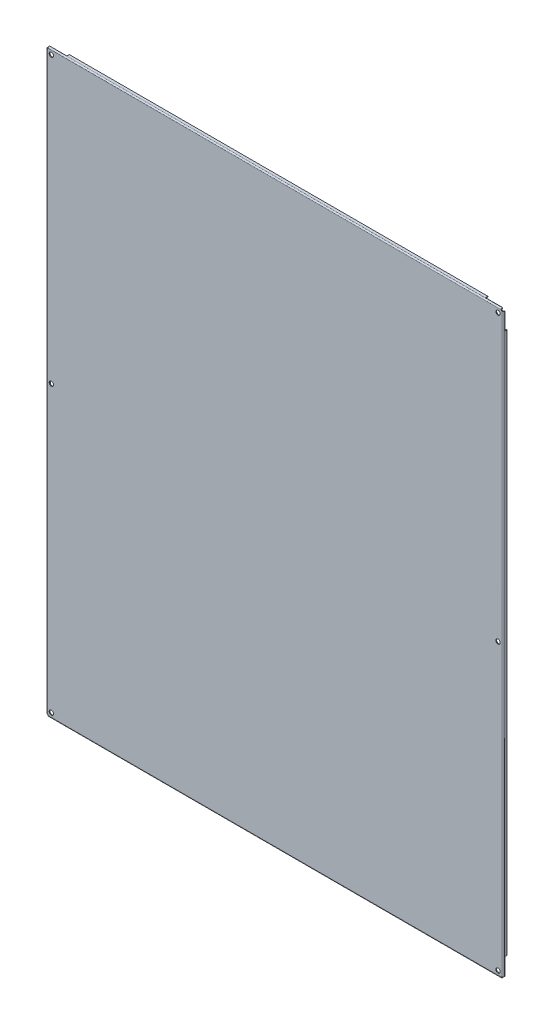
ISO-10303-21;
HEADER;
FILE_DESCRIPTION(('STEP AP214'),'2;1');
FILE_NAME('part.step','',(''),(''),'','','');
FILE_SCHEMA(('AUTOMOTIVE_DESIGN { 1 0 10303 214 1 1 1 1 }'));
ENDSEC;
DATA;
#1=APPLICATION_CONTEXT('core data for automotive mechanical design processes');
#2=APPLICATION_PROTOCOL_DEFINITION('international standard','automotive_design',2000,#1);
#3=PRODUCT_CONTEXT('',#1,'mechanical');
#4=PRODUCT('Part','Part','',(#3));
#5=PRODUCT_RELATED_PRODUCT_CATEGORY('part','',(#4));
#6=PRODUCT_DEFINITION_FORMATION('','',#4);
#7=PRODUCT_DEFINITION_CONTEXT('part definition',#1,'design');
#8=PRODUCT_DEFINITION('design','',#6,#7);
#9=PRODUCT_DEFINITION_SHAPE('','',#8);
#10=(LENGTH_UNIT() NAMED_UNIT(*) SI_UNIT(.MILLI.,.METRE.));
#11=(NAMED_UNIT(*) PLANE_ANGLE_UNIT() SI_UNIT($,.RADIAN.));
#12=(NAMED_UNIT(*) SI_UNIT($,.STERADIAN.) SOLID_ANGLE_UNIT());
#13=UNCERTAINTY_MEASURE_WITH_UNIT(LENGTH_MEASURE(1.E-05),#10,'distance_accuracy_value','');
#14=(GEOMETRIC_REPRESENTATION_CONTEXT(3) GLOBAL_UNCERTAINTY_ASSIGNED_CONTEXT((#13)) GLOBAL_UNIT_ASSIGNED_CONTEXT((#10,
#11,#12)) REPRESENTATION_CONTEXT('',''));
#15=CARTESIAN_POINT('',(0.,0.,0.));
#16=DIRECTION('',(0.,0.,1.));
#17=DIRECTION('',(1.,0.,0.));
#18=AXIS2_PLACEMENT_3D('',#15,#16,#17);
#19=CARTESIAN_POINT('',(0.,0.,0.));
#20=DIRECTION('',(0.,-1.,0.));
#21=DIRECTION('',(0.,0.,-1.));
#22=AXIS2_PLACEMENT_3D('',#19,#20,#21);
#23=PLANE('',#22);
#24=DIRECTION('',(0.,0.,1.));
#25=VECTOR('',#24,1.);
#26=CARTESIAN_POINT('',(469.585786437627,0.,0.));
#27=LINE('',#26,#25);
#28=CARTESIAN_POINT('',(469.585786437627,0.,1.));
#29=VERTEX_POINT('',#28);
#30=CARTESIAN_POINT('',(469.585786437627,0.,1.5));
#31=VERTEX_POINT('',#30);
#32=EDGE_CURVE('E331',#29,#31,#27,.T.);
#33=ORIENTED_EDGE('',*,*,#32,.T.);
#34=DIRECTION('',(1.,0.,0.));
#35=VECTOR('',#34,1.);
#36=CARTESIAN_POINT('',(0.,0.,1.5));
#37=LINE('',#36,#35);
#38=CARTESIAN_POINT('',(-469.585786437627,0.,1.5));
#39=VERTEX_POINT('',#38);
#40=EDGE_CURVE('E326',#39,#31,#37,.T.);
#41=ORIENTED_EDGE('',*,*,#40,.F.);
#42=DIRECTION('',(0.,0.,-1.));
#43=VECTOR('',#42,1.);
#44=CARTESIAN_POINT('',(-469.585786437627,0.,0.));
#45=LINE('',#44,#43);
#46=CARTESIAN_POINT('',(-469.585786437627,0.,1.));
#47=VERTEX_POINT('',#46);
#48=EDGE_CURVE('E320',#39,#47,#45,.T.);
#49=ORIENTED_EDGE('',*,*,#48,.T.);
#50=DIRECTION('',(-1.,0.,0.));
#51=VECTOR('',#50,1.);
#52=CARTESIAN_POINT('',(0.,0.,1.));
#53=LINE('',#52,#51);
#54=CARTESIAN_POINT('',(-434.,0.,1.));
#55=VERTEX_POINT('',#54);
#56=EDGE_CURVE('E323',#55,#47,#53,.T.);
#57=ORIENTED_EDGE('',*,*,#56,.F.);
#58=DIRECTION('',(0.,0.,-1.));
#59=VECTOR('',#58,1.);
#60=CARTESIAN_POINT('',(-434.,0.,0.));
#61=LINE('',#60,#59);
#62=CARTESIAN_POINT('',(-434.,0.,-4.));
#63=VERTEX_POINT('',#62);
#64=EDGE_CURVE('E392',#55,#63,#61,.T.);
#65=ORIENTED_EDGE('',*,*,#64,.T.);
#66=DIRECTION('',(1.,0.,0.));
#67=VECTOR('',#66,1.);
#68=CARTESIAN_POINT('',(0.,0.,-4.));
#69=LINE('',#68,#67);
#70=CARTESIAN_POINT('',(434.,0.,-4.));
#71=VERTEX_POINT('',#70);
#72=EDGE_CURVE('E383',#63,#71,#69,.T.);
#73=ORIENTED_EDGE('',*,*,#72,.T.);
#74=DIRECTION('',(0.,0.,1.));
#75=VECTOR('',#74,1.);
#76=CARTESIAN_POINT('',(434.,0.,0.));
#77=LINE('',#76,#75);
#78=CARTESIAN_POINT('',(434.,0.,1.));
#79=VERTEX_POINT('',#78);
#80=EDGE_CURVE('E373',#71,#79,#77,.T.);
#81=ORIENTED_EDGE('',*,*,#80,.T.);
#82=DIRECTION('',(1.,0.,0.));
#83=VECTOR('',#82,1.);
#84=CARTESIAN_POINT('',(0.,0.,1.));
#85=LINE('',#84,#83);
#86=EDGE_CURVE('E361',#79,#29,#85,.T.);
#87=ORIENTED_EDGE('',*,*,#86,.T.);
#88=EDGE_LOOP('',(#33,#41,#49,#57,#65,#73,#81,#87));
#89=FACE_BOUND('',#88,.T.);
#90=ADVANCED_FACE('F17',(#89),#23,.T.);
#91=CARTESIAN_POINT('',(-474.,1203.,4.));
#92=DIRECTION('',(1.,0.,0.));
#93=DIRECTION('',(0.,0.,-1.));
#94=AXIS2_PLACEMENT_3D('',#91,#92,#93);
#95=PLANE('',#94);
#96=DIRECTION('',(0.,1.,0.));
#97=VECTOR('',#96,1.);
#98=CARTESIAN_POINT('',(-474.,1203.,1.));
#99=LINE('',#98,#97);
#100=CARTESIAN_POINT('',(-474.,1198.58578643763,1.));
#101=VERTEX_POINT('',#100);
#102=CARTESIAN_POINT('',(-474.,1163.,1.));
#103=VERTEX_POINT('',#102);
#104=EDGE_CURVE('E515',#101,#103,#99,.F.);
#105=ORIENTED_EDGE('',*,*,#104,.T.);
#106=DIRECTION('',(0.,0.,-1.));
#107=VECTOR('',#106,1.);
#108=CARTESIAN_POINT('',(-474.,1163.,4.));
#109=LINE('',#108,#107);
#110=CARTESIAN_POINT('',(-474.,1163.,-4.));
#111=VERTEX_POINT('',#110);
#112=EDGE_CURVE('E526',#103,#111,#109,.T.);
#113=ORIENTED_EDGE('',*,*,#112,.T.);
#114=DIRECTION('',(0.,1.,0.));
#115=VECTOR('',#114,1.);
#116=CARTESIAN_POINT('',(-474.,1203.,-4.));
#117=LINE('',#116,#115);
#118=CARTESIAN_POINT('',(-474.,40.,-4.));
#119=VERTEX_POINT('',#118);
#120=EDGE_CURVE('E535',#111,#119,#117,.F.);
#121=ORIENTED_EDGE('',*,*,#120,.T.);
#122=DIRECTION('',(0.,0.,1.));
#123=VECTOR('',#122,1.);
#124=CARTESIAN_POINT('',(-474.,40.,4.));
#125=LINE('',#124,#123);
#126=CARTESIAN_POINT('',(-474.,40.,1.));
#127=VERTEX_POINT('',#126);
#128=EDGE_CURVE('E523',#119,#127,#125,.T.);
#129=ORIENTED_EDGE('',*,*,#128,.T.);
#130=DIRECTION('',(0.,1.,0.));
#131=VECTOR('',#130,1.);
#132=CARTESIAN_POINT('',(-474.,1203.,1.));
#133=LINE('',#132,#131);
#134=CARTESIAN_POINT('',(-474.,4.41421356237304,1.));
#135=VERTEX_POINT('',#134);
#136=EDGE_CURVE('E345',#135,#127,#133,.T.);
#137=ORIENTED_EDGE('',*,*,#136,.F.);
#138=DIRECTION('',(0.,0.,-1.));
#139=VECTOR('',#138,1.);
#140=CARTESIAN_POINT('',(-474.,4.41421356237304,4.));
#141=LINE('',#140,#139);
#142=CARTESIAN_POINT('',(-474.,4.41421356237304,1.5));
#143=VERTEX_POINT('',#142);
#144=EDGE_CURVE('E532',#143,#135,#141,.T.);
#145=ORIENTED_EDGE('',*,*,#144,.F.);
#146=DIRECTION('',(0.,1.,0.));
#147=VECTOR('',#146,1.);
#148=CARTESIAN_POINT('',(-474.,1203.,1.5));
#149=LINE('',#148,#147);
#150=CARTESIAN_POINT('',(-474.,1198.58578643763,1.5));
#151=VERTEX_POINT('',#150);
#152=EDGE_CURVE('E1183',#151,#143,#149,.F.);
#153=ORIENTED_EDGE('',*,*,#152,.F.);
#154=DIRECTION('',(0.,0.,1.));
#155=VECTOR('',#154,1.);
#156=CARTESIAN_POINT('',(-474.,1198.58578643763,2.5));
#157=LINE('',#156,#155);
#158=EDGE_CURVE('E1188',#101,#151,#157,.T.);
#159=ORIENTED_EDGE('',*,*,#158,.F.);
#160=EDGE_LOOP('',(#105,#113,#121,#129,#137,#145,#153,#159));
#161=FACE_BOUND('',#160,.T.);
#162=ADVANCED_FACE('F814',(#161),#95,.F.);
#163=CARTESIAN_POINT('',(0.,1203.,0.));
#164=DIRECTION('',(0.,-1.,0.));
#165=DIRECTION('',(0.,0.,-1.));
#166=AXIS2_PLACEMENT_3D('',#163,#164,#165);
#167=PLANE('',#166);
#168=DIRECTION('',(-1.,0.,0.));
#169=VECTOR('',#168,1.);
#170=CARTESIAN_POINT('',(0.,1203.,1.));
#171=LINE('',#170,#169);
#172=CARTESIAN_POINT('',(434.,1203.,1.));
#173=VERTEX_POINT('',#172);
#174=CARTESIAN_POINT('',(469.585786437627,1203.,1.));
#175=VERTEX_POINT('',#174);
#176=EDGE_CURVE('E500',#173,#175,#171,.F.);
#177=ORIENTED_EDGE('',*,*,#176,.F.);
#178=DIRECTION('',(0.,0.,1.));
#179=VECTOR('',#178,1.);
#180=CARTESIAN_POINT('',(434.,1203.,0.));
#181=LINE('',#180,#179);
#182=CARTESIAN_POINT('',(434.,1203.,-4.));
#183=VERTEX_POINT('',#182);
#184=EDGE_CURVE('E1165',#173,#183,#181,.F.);
#185=ORIENTED_EDGE('',*,*,#184,.T.);
#186=DIRECTION('',(1.,0.,0.));
#187=VECTOR('',#186,1.);
#188=CARTESIAN_POINT('',(0.,1203.,-4.));
#189=LINE('',#188,#187);
#190=CARTESIAN_POINT('',(-434.,1203.,-4.));
#191=VERTEX_POINT('',#190);
#192=EDGE_CURVE('E493',#183,#191,#189,.F.);
#193=ORIENTED_EDGE('',*,*,#192,.T.);
#194=DIRECTION('',(0.,0.,-1.));
#195=VECTOR('',#194,1.);
#196=CARTESIAN_POINT('',(-434.,1203.,0.));
#197=LINE('',#196,#195);
#198=CARTESIAN_POINT('',(-434.,1203.,1.));
#199=VERTEX_POINT('',#198);
#200=EDGE_CURVE('E481',#191,#199,#197,.F.);
#201=ORIENTED_EDGE('',*,*,#200,.T.);
#202=DIRECTION('',(1.,0.,0.));
#203=VECTOR('',#202,1.);
#204=CARTESIAN_POINT('',(0.,1203.,1.));
#205=LINE('',#204,#203);
#206=CARTESIAN_POINT('',(-469.585786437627,1203.,1.));
#207=VERTEX_POINT('',#206);
#208=EDGE_CURVE('E478',#199,#207,#205,.F.);
#209=ORIENTED_EDGE('',*,*,#208,.T.);
#210=DIRECTION('',(0.,0.,-1.));
#211=VECTOR('',#210,1.);
#212=CARTESIAN_POINT('',(-469.585786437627,1203.,0.));
#213=LINE('',#212,#211);
#214=CARTESIAN_POINT('',(-469.585786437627,1203.,1.5));
#215=VERTEX_POINT('',#214);
#216=EDGE_CURVE('E449',#215,#207,#213,.T.);
#217=ORIENTED_EDGE('',*,*,#216,.F.);
#218=DIRECTION('',(-1.,0.,0.));
#219=VECTOR('',#218,1.);
#220=CARTESIAN_POINT('',(-474.,1203.,1.5));
#221=LINE('',#220,#219);
#222=CARTESIAN_POINT('',(469.585786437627,1203.,1.5));
#223=VERTEX_POINT('',#222);
#224=EDGE_CURVE('E499',#223,#215,#221,.T.);
#225=ORIENTED_EDGE('',*,*,#224,.F.);
#226=DIRECTION('',(0.,0.,-1.));
#227=VECTOR('',#226,1.);
#228=CARTESIAN_POINT('',(469.585786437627,1203.,2.5));
#229=LINE('',#228,#227);
#230=EDGE_CURVE('E1178',#175,#223,#229,.F.);
#231=ORIENTED_EDGE('',*,*,#230,.F.);
#232=EDGE_LOOP('',(#177,#185,#193,#201,#209,#217,#225,#231));
#233=FACE_BOUND('',#232,.T.);
#234=ADVANCED_FACE('F817',(#233),#167,.F.);
#235=CARTESIAN_POINT('',(474.,1203.,4.));
#236=DIRECTION('',(-1.,0.,0.));
#237=DIRECTION('',(0.,0.,1.));
#238=AXIS2_PLACEMENT_3D('',#235,#236,#237);
#239=PLANE('',#238);
#240=DIRECTION('',(0.,1.,0.));
#241=VECTOR('',#240,1.);
#242=CARTESIAN_POINT('',(474.,1203.,1.));
#243=LINE('',#242,#241);
#244=CARTESIAN_POINT('',(474.,4.41421356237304,1.));
#245=VERTEX_POINT('',#244);
#246=CARTESIAN_POINT('',(474.,40.,1.));
#247=VERTEX_POINT('',#246);
#248=EDGE_CURVE('E463',#245,#247,#243,.T.);
#249=ORIENTED_EDGE('',*,*,#248,.T.);
#250=DIRECTION('',(0.,0.,1.));
#251=VECTOR('',#250,1.);
#252=CARTESIAN_POINT('',(474.,40.,4.));
#253=LINE('',#252,#251);
#254=CARTESIAN_POINT('',(474.,40.,-4.));
#255=VERTEX_POINT('',#254);
#256=EDGE_CURVE('E1138',#247,#255,#253,.F.);
#257=ORIENTED_EDGE('',*,*,#256,.T.);
#258=DIRECTION('',(0.,1.,0.));
#259=VECTOR('',#258,1.);
#260=CARTESIAN_POINT('',(474.,1203.,-4.));
#261=LINE('',#260,#259);
#262=CARTESIAN_POINT('',(474.,1163.,-4.));
#263=VERTEX_POINT('',#262);
#264=EDGE_CURVE('E1140',#263,#255,#261,.F.);
#265=ORIENTED_EDGE('',*,*,#264,.F.);
#266=DIRECTION('',(0.,0.,-1.));
#267=VECTOR('',#266,1.);
#268=CARTESIAN_POINT('',(474.,1163.,4.));
#269=LINE('',#268,#267);
#270=CARTESIAN_POINT('',(474.,1163.,1.));
#271=VERTEX_POINT('',#270);
#272=EDGE_CURVE('E444',#263,#271,#269,.F.);
#273=ORIENTED_EDGE('',*,*,#272,.T.);
#274=DIRECTION('',(0.,1.,0.));
#275=VECTOR('',#274,1.);
#276=CARTESIAN_POINT('',(474.,1203.,1.));
#277=LINE('',#276,#275);
#278=CARTESIAN_POINT('',(474.,1198.58578643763,1.));
#279=VERTEX_POINT('',#278);
#280=EDGE_CURVE('E441',#279,#271,#277,.F.);
#281=ORIENTED_EDGE('',*,*,#280,.F.);
#282=DIRECTION('',(0.,0.,1.));
#283=VECTOR('',#282,1.);
#284=CARTESIAN_POINT('',(474.,1198.58578643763,4.));
#285=LINE('',#284,#283);
#286=CARTESIAN_POINT('',(474.,1198.58578643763,1.5));
#287=VERTEX_POINT('',#286);
#288=EDGE_CURVE('E160',#287,#279,#285,.F.);
#289=ORIENTED_EDGE('',*,*,#288,.F.);
#290=DIRECTION('',(0.,1.,0.));
#291=VECTOR('',#290,1.);
#292=CARTESIAN_POINT('',(474.,1203.,1.5));
#293=LINE('',#292,#291);
#294=CARTESIAN_POINT('',(474.,4.41421356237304,1.5));
#295=VERTEX_POINT('',#294);
#296=EDGE_CURVE('E1133',#295,#287,#293,.T.);
#297=ORIENTED_EDGE('',*,*,#296,.F.);
#298=DIRECTION('',(0.,0.,-1.));
#299=VECTOR('',#298,1.);
#300=CARTESIAN_POINT('',(474.,4.41421356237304,4.));
#301=LINE('',#300,#299);
#302=EDGE_CURVE('E973',#245,#295,#301,.F.);
#303=ORIENTED_EDGE('',*,*,#302,.F.);
#304=EDGE_LOOP('',(#249,#257,#265,#273,#281,#289,#297,#303));
#305=FACE_BOUND('',#304,.T.);
#306=ADVANCED_FACE('F821',(#305),#239,.F.);
#307=CARTESIAN_POINT('',(0.,1.5,1.));
#308=DIRECTION('',(0.,0.,-1.));
#309=DIRECTION('',(-1.,0.,0.));
#310=AXIS2_PLACEMENT_3D('',#307,#308,#309);
#311=PLANE('',#310);
#312=DIRECTION('',(0.,1.,0.));
#313=VECTOR('',#312,1.);
#314=CARTESIAN_POINT('',(-469.585786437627,1.5,1.));
#315=LINE('',#314,#313);
#316=CARTESIAN_POINT('',(-469.585786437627,1.5,1.));
#317=VERTEX_POINT('',#316);
#318=EDGE_CURVE('E330',#47,#317,#315,.T.);
#319=ORIENTED_EDGE('',*,*,#318,.T.);
#320=DIRECTION('',(1.,0.,0.));
#321=VECTOR('',#320,1.);
#322=CARTESIAN_POINT('',(0.,1.5,1.));
#323=LINE('',#322,#321);
#324=CARTESIAN_POINT('',(-434.,1.5,1.));
#325=VERTEX_POINT('',#324);
#326=EDGE_CURVE('E353',#317,#325,#323,.T.);
#327=ORIENTED_EDGE('',*,*,#326,.T.);
#328=DIRECTION('',(0.,1.,0.));
#329=VECTOR('',#328,1.);
#330=CARTESIAN_POINT('',(-434.,1.5,1.));
#331=LINE('',#330,#329);
#332=EDGE_CURVE('E337',#325,#55,#331,.F.);
#333=ORIENTED_EDGE('',*,*,#332,.T.);
#334=ORIENTED_EDGE('',*,*,#56,.T.);
#335=EDGE_LOOP('',(#319,#327,#333,#334));
#336=FACE_BOUND('',#335,.T.);
#337=ADVANCED_FACE('F334',(#336),#311,.T.);
#338=CARTESIAN_POINT('',(-434.,1.5,0.));
#339=DIRECTION('',(1.,0.,0.));
#340=DIRECTION('',(0.,0.,-1.));
#341=AXIS2_PLACEMENT_3D('',#338,#339,#340);
#342=PLANE('',#341);
#343=ORIENTED_EDGE('',*,*,#64,.F.);
#344=ORIENTED_EDGE('',*,*,#332,.F.);
#345=DIRECTION('',(0.,0.,-1.));
#346=VECTOR('',#345,1.);
#347=CARTESIAN_POINT('',(-434.,1.5,0.));
#348=LINE('',#347,#346);
#349=CARTESIAN_POINT('',(-434.,1.5,-4.));
#350=VERTEX_POINT('',#349);
#351=EDGE_CURVE('E355',#325,#350,#348,.T.);
#352=ORIENTED_EDGE('',*,*,#351,.T.);
#353=DIRECTION('',(0.,1.,0.));
#354=VECTOR('',#353,1.);
#355=CARTESIAN_POINT('',(-434.,1.5,-4.));
#356=LINE('',#355,#354);
#357=EDGE_CURVE('E389',#350,#63,#356,.F.);
#358=ORIENTED_EDGE('',*,*,#357,.T.);
#359=EDGE_LOOP('',(#343,#344,#352,#358));
#360=FACE_BOUND('',#359,.T.);
#361=ADVANCED_FACE('F828',(#360),#342,.F.);
#362=CARTESIAN_POINT('',(0.,1.5,-4.));
#363=DIRECTION('',(0.,0.,1.));
#364=DIRECTION('',(1.,0.,0.));
#365=AXIS2_PLACEMENT_3D('',#362,#363,#364);
#366=PLANE('',#365);
#367=ORIENTED_EDGE('',*,*,#72,.F.);
#368=ORIENTED_EDGE('',*,*,#357,.F.);
#369=DIRECTION('',(1.,0.,0.));
#370=VECTOR('',#369,1.);
#371=CARTESIAN_POINT('',(0.,1.5,-4.));
#372=LINE('',#371,#370);
#373=CARTESIAN_POINT('',(434.,1.5,-4.));
#374=VERTEX_POINT('',#373);
#375=EDGE_CURVE('E377',#350,#374,#372,.T.);
#376=ORIENTED_EDGE('',*,*,#375,.T.);
#377=DIRECTION('',(0.,1.,0.));
#378=VECTOR('',#377,1.);
#379=CARTESIAN_POINT('',(434.,1.5,-4.));
#380=LINE('',#379,#378);
#381=EDGE_CURVE('E380',#374,#71,#380,.F.);
#382=ORIENTED_EDGE('',*,*,#381,.T.);
#383=EDGE_LOOP('',(#367,#368,#376,#382));
#384=FACE_BOUND('',#383,.T.);
#385=ADVANCED_FACE('F831',(#384),#366,.F.);
#386=CARTESIAN_POINT('',(434.,1.5,0.));
#387=DIRECTION('',(-1.,0.,0.));
#388=DIRECTION('',(0.,0.,1.));
#389=AXIS2_PLACEMENT_3D('',#386,#387,#388);
#390=PLANE('',#389);
#391=ORIENTED_EDGE('',*,*,#80,.F.);
#392=ORIENTED_EDGE('',*,*,#381,.F.);
#393=DIRECTION('',(0.,0.,-1.));
#394=VECTOR('',#393,1.);
#395=CARTESIAN_POINT('',(434.,1.5,0.));
#396=LINE('',#395,#394);
#397=CARTESIAN_POINT('',(434.,1.5,1.));
#398=VERTEX_POINT('',#397);
#399=EDGE_CURVE('E367',#374,#398,#396,.F.);
#400=ORIENTED_EDGE('',*,*,#399,.T.);
#401=DIRECTION('',(0.,1.,0.));
#402=VECTOR('',#401,1.);
#403=CARTESIAN_POINT('',(434.,1.5,1.));
#404=LINE('',#403,#402);
#405=EDGE_CURVE('E370',#398,#79,#404,.F.);
#406=ORIENTED_EDGE('',*,*,#405,.T.);
#407=EDGE_LOOP('',(#391,#392,#400,#406));
#408=FACE_BOUND('',#407,.T.);
#409=ADVANCED_FACE('F835',(#408),#390,.F.);
#410=CARTESIAN_POINT('',(0.,1.5,1.));
#411=DIRECTION('',(0.,0.,1.));
#412=DIRECTION('',(1.,0.,0.));
#413=AXIS2_PLACEMENT_3D('',#410,#411,#412);
#414=PLANE('',#413);
#415=ORIENTED_EDGE('',*,*,#86,.F.);
#416=ORIENTED_EDGE('',*,*,#405,.F.);
#417=DIRECTION('',(1.,0.,0.));
#418=VECTOR('',#417,1.);
#419=CARTESIAN_POINT('',(0.,1.5,1.));
#420=LINE('',#419,#418);
#421=CARTESIAN_POINT('',(469.585786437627,1.5,1.));
#422=VERTEX_POINT('',#421);
#423=EDGE_CURVE('E364',#398,#422,#420,.T.);
#424=ORIENTED_EDGE('',*,*,#423,.T.);
#425=DIRECTION('',(0.,1.,0.));
#426=VECTOR('',#425,1.);
#427=CARTESIAN_POINT('',(469.585786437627,1.5,1.));
#428=LINE('',#427,#426);
#429=EDGE_CURVE('E358',#422,#29,#428,.F.);
#430=ORIENTED_EDGE('',*,*,#429,.T.);
#431=EDGE_LOOP('',(#415,#416,#424,#430));
#432=FACE_BOUND('',#431,.T.);
#433=ADVANCED_FACE('F839',(#432),#414,.F.);
#434=CARTESIAN_POINT('',(469.585786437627,1.5,0.));
#435=DIRECTION('',(-1.,0.,0.));
#436=DIRECTION('',(0.,0.,1.));
#437=AXIS2_PLACEMENT_3D('',#434,#435,#436);
#438=PLANE('',#437);
#439=ORIENTED_EDGE('',*,*,#32,.F.);
#440=ORIENTED_EDGE('',*,*,#429,.F.);
#441=DIRECTION('',(0.,0.,-1.));
#442=VECTOR('',#441,1.);
#443=CARTESIAN_POINT('',(469.585786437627,1.5,0.));
#444=LINE('',#443,#442);
#445=CARTESIAN_POINT('',(469.585786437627,1.5,1.5));
#446=VERTEX_POINT('',#445);
#447=EDGE_CURVE('E366',#422,#446,#444,.F.);
#448=ORIENTED_EDGE('',*,*,#447,.T.);
#449=DIRECTION('',(0.,1.,0.));
#450=VECTOR('',#449,1.);
#451=CARTESIAN_POINT('',(469.585786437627,0.75,1.5));
#452=LINE('',#451,#450);
#453=EDGE_CURVE('E1124',#31,#446,#452,.T.);
#454=ORIENTED_EDGE('',*,*,#453,.F.);
#455=EDGE_LOOP('',(#439,#440,#448,#454));
#456=FACE_BOUND('',#455,.T.);
#457=ADVANCED_FACE('F843',(#456),#438,.F.);
#458=CARTESIAN_POINT('',(-469.585786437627,1.5,0.));
#459=DIRECTION('',(1.,0.,0.));
#460=DIRECTION('',(0.,0.,-1.));
#461=AXIS2_PLACEMENT_3D('',#458,#459,#460);
#462=PLANE('',#461);
#463=ORIENTED_EDGE('',*,*,#48,.F.);
#464=DIRECTION('',(0.,-1.,0.));
#465=VECTOR('',#464,1.);
#466=CARTESIAN_POINT('',(-469.585786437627,0.75,1.5));
#467=LINE('',#466,#465);
#468=CARTESIAN_POINT('',(-469.585786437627,1.5,1.5));
#469=VERTEX_POINT('',#468);
#470=EDGE_CURVE('E1121',#469,#39,#467,.T.);
#471=ORIENTED_EDGE('',*,*,#470,.F.);
#472=DIRECTION('',(0.,0.,-1.));
#473=VECTOR('',#472,1.);
#474=CARTESIAN_POINT('',(-469.585786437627,1.5,0.));
#475=LINE('',#474,#473);
#476=EDGE_CURVE('E342',#469,#317,#475,.T.);
#477=ORIENTED_EDGE('',*,*,#476,.T.);
#478=ORIENTED_EDGE('',*,*,#318,.F.);
#479=EDGE_LOOP('',(#463,#471,#477,#478));
#480=FACE_BOUND('',#479,.T.);
#481=ADVANCED_FACE('F340',(#480),#462,.F.);
#482=CARTESIAN_POINT('',(0.,2.5,1.5));
#483=DIRECTION('',(1.,0.,0.));
#484=DIRECTION('',(0.,0.,-1.));
#485=AXIS2_PLACEMENT_3D('',#482,#483,#484);
#486=CYLINDRICAL_SURFACE('',#485,2.5);
#487=CARTESIAN_POINT('',(470.,2.5,4.));
#488=CARTESIAN_POINT('',(469.999990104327,2.43503514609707,4.00000716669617));
#489=CARTESIAN_POINT('',(469.998839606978,2.3700851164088,3.99746790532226));
#490=CARTESIAN_POINT('',(469.994583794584,2.24066759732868,3.98735772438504));
#491=CARTESIAN_POINT('',(469.991479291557,2.17619991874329,3.97978889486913));
#492=CARTESIAN_POINT('',(469.983649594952,2.04828077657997,3.95970195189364));
#493=CARTESIAN_POINT('',(469.978927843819,1.98482745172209,3.94719434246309));
#494=CARTESIAN_POINT('',(469.96812996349,1.85919674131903,3.91734262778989));
#495=CARTESIAN_POINT('',(469.96205368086,1.79701950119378,3.8999979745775));
#496=CARTESIAN_POINT('',(469.941762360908,1.60919599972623,3.83967369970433));
#497=CARTESIAN_POINT('',(469.925746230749,1.48611584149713,3.78900635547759));
#498=CARTESIAN_POINT('',(469.89083277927,1.2498625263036,3.66904322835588));
#499=CARTESIAN_POINT('',(469.871933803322,1.13669511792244,3.59973672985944));
#500=CARTESIAN_POINT('',(469.831621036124,0.916713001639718,3.43977461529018));
#501=CARTESIAN_POINT('',(469.810125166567,0.810635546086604,3.34812208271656));
#502=CARTESIAN_POINT('',(469.767235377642,0.615222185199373,3.14837717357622));
#503=CARTESIAN_POINT('',(469.745841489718,0.525891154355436,3.04028002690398));
#504=CARTESIAN_POINT('',(469.704466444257,0.364997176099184,2.8084402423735));
#505=CARTESIAN_POINT('',(469.684516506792,0.293772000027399,2.68445721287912));
#506=CARTESIAN_POINT('',(469.648372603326,0.173363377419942,2.42578882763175));
#507=CARTESIAN_POINT('',(469.632175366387,0.124160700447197,2.29111293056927));
#508=CARTESIAN_POINT('',(469.608970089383,0.0580945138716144,2.04696003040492));
#509=CARTESIAN_POINT('',(469.60070102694,0.0363713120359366,1.93890652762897));
#510=CARTESIAN_POINT('',(469.592011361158,0.0145839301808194,1.77521638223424));
#511=CARTESIAN_POINT('',(469.589733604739,0.00912101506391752,1.72035946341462));
#512=CARTESIAN_POINT('',(469.586623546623,0.00182730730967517,1.610341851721));
#513=CARTESIAN_POINT('',(469.585791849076,-1.96727089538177E-06,1.55518104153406));
#514=CARTESIAN_POINT('',(469.585786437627,0.,1.5));
#515=B_SPLINE_CURVE_WITH_KNOTS('',3,(#487,#488,#489,#490,#491,#492,#493,#494,#495,#496,#497,
#498,#499,#500,#501,#502,#503,#504,#505,#506,#507,#508,#509,#510,#511,#512,#513,#514),
.UNSPECIFIED.,.F.,.F.,(4,2,2,2,2,2,2,2,2,2,2,2,2,4),(0.,0.194812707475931,0.389544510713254,
0.58386436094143,0.778206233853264,1.1784962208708,1.57901682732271,2.00252209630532,
2.42615044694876,2.85718159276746,3.28783561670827,3.61833762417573,3.78373858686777,
3.94920863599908),.UNSPECIFIED.);
#516=CARTESIAN_POINT('',(470.,2.49999999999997,4.));
#517=VERTEX_POINT('',#516);
#518=EDGE_CURVE('E24',#517,#31,#515,.T.);
#519=ORIENTED_EDGE('',*,*,#518,.F.);
#520=DIRECTION('',(-1.,0.,0.));
#521=VECTOR('',#520,1.);
#522=CARTESIAN_POINT('',(-474.,2.49999999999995,4.));
#523=LINE('',#522,#521);
#524=CARTESIAN_POINT('',(-470.,2.49999999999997,4.));
#525=VERTEX_POINT('',#524);
#526=EDGE_CURVE('E409',#517,#525,#523,.T.);
#527=ORIENTED_EDGE('',*,*,#526,.T.);
#528=CARTESIAN_POINT('',(-469.585786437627,0.,1.5));
#529=CARTESIAN_POINT('',(-469.5857963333,-7.16669616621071E-06,1.56496485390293));
#530=CARTESIAN_POINT('',(-469.586946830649,0.00253209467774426,1.6299148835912));
#531=CARTESIAN_POINT('',(-469.591202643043,0.0126422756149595,1.75933240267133));
#532=CARTESIAN_POINT('',(-469.594307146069,0.0202111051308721,1.82380008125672));
#533=CARTESIAN_POINT('',(-469.602136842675,0.0402980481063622,1.95171922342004));
#534=CARTESIAN_POINT('',(-469.606858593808,0.0528056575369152,2.01517254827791));
#535=CARTESIAN_POINT('',(-469.617656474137,0.0826573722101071,2.14080325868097));
#536=CARTESIAN_POINT('',(-469.623732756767,0.100002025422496,2.20298049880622));
#537=CARTESIAN_POINT('',(-469.644024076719,0.160326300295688,2.39080400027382));
#538=CARTESIAN_POINT('',(-469.660040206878,0.210993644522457,2.51388415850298));
#539=CARTESIAN_POINT('',(-469.694953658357,0.330956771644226,2.75013747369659));
#540=CARTESIAN_POINT('',(-469.713852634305,0.400263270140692,2.86330488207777));
#541=CARTESIAN_POINT('',(-469.754165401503,0.560225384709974,3.08328699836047));
#542=CARTESIAN_POINT('',(-469.77566127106,0.651877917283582,3.18936445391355));
#543=CARTESIAN_POINT('',(-469.818551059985,0.851622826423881,3.38477781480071));
#544=CARTESIAN_POINT('',(-469.839944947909,0.959719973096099,3.47410884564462));
#545=CARTESIAN_POINT('',(-469.88131999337,1.19155975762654,3.63500282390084));
#546=CARTESIAN_POINT('',(-469.901269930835,1.31554278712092,3.70622799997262));
#547=CARTESIAN_POINT('',(-469.937413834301,1.5742111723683,3.82663662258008));
#548=CARTESIAN_POINT('',(-469.95361107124,1.70888706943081,3.87583929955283));
#549=CARTESIAN_POINT('',(-469.976816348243,1.95303996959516,3.9419054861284));
#550=CARTESIAN_POINT('',(-469.985085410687,2.06109347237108,3.96362868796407));
#551=CARTESIAN_POINT('',(-469.993775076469,2.22478361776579,3.98541606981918));
#552=CARTESIAN_POINT('',(-469.996052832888,2.2796405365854,3.99087898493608));
#553=CARTESIAN_POINT('',(-469.999162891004,2.38965814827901,3.99817269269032));
#554=CARTESIAN_POINT('',(-469.999994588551,2.44481895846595,4.0000019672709));
#555=CARTESIAN_POINT('',(-470.,2.5,4.));
#556=B_SPLINE_CURVE_WITH_KNOTS('',3,(#528,#529,#530,#531,#532,#533,#534,#535,#536,#537,#538,
#539,#540,#541,#542,#543,#544,#545,#546,#547,#548,#549,#550,#551,#552,#553,#554,#555),
.UNSPECIFIED.,.F.,.F.,(4,2,2,2,2,2,2,2,2,2,2,2,2,4),(0.,0.194812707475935,0.389544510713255,
0.583864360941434,0.778206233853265,1.17849622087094,1.579016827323,2.00252209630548,
2.4261504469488,2.85718159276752,3.28783561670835,3.61833762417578,3.78373858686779,
3.94920863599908),.UNSPECIFIED.);
#557=EDGE_CURVE('E734',#39,#525,#556,.T.);
#558=ORIENTED_EDGE('',*,*,#557,.F.);
#559=ORIENTED_EDGE('',*,*,#40,.T.);
#560=EDGE_LOOP('',(#519,#527,#558,#559));
#561=FACE_BOUND('',#560,.T.);
#562=ADVANCED_FACE('F849',(#561),#486,.T.);
#563=CARTESIAN_POINT('',(-472.5,1203.,1.));
#564=DIRECTION('',(0.,0.,-1.));
#565=DIRECTION('',(-1.,0.,0.));
#566=AXIS2_PLACEMENT_3D('',#563,#564,#565);
#567=PLANE('',#566);
#568=DIRECTION('',(1.,0.,0.));
#569=VECTOR('',#568,1.);
#570=CARTESIAN_POINT('',(-472.5,40.,1.));
#571=LINE('',#570,#569);
#572=CARTESIAN_POINT('',(-472.5,40.,1.));
#573=VERTEX_POINT('',#572);
#574=EDGE_CURVE('E537',#127,#573,#571,.T.);
#575=ORIENTED_EDGE('',*,*,#574,.T.);
#576=DIRECTION('',(0.,1.,0.));
#577=VECTOR('',#576,1.);
#578=CARTESIAN_POINT('',(-472.5,1203.,1.));
#579=LINE('',#578,#577);
#580=CARTESIAN_POINT('',(-472.5,4.41421356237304,1.));
#581=VERTEX_POINT('',#580);
#582=EDGE_CURVE('E1108',#581,#573,#579,.T.);
#583=ORIENTED_EDGE('',*,*,#582,.F.);
#584=DIRECTION('',(1.,0.,0.));
#585=VECTOR('',#584,1.);
#586=CARTESIAN_POINT('',(-472.5,4.41421356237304,1.));
#587=LINE('',#586,#585);
#588=EDGE_CURVE('E1196',#135,#581,#587,.T.);
#589=ORIENTED_EDGE('',*,*,#588,.F.);
#590=ORIENTED_EDGE('',*,*,#136,.T.);
#591=EDGE_LOOP('',(#575,#583,#589,#590));
#592=FACE_BOUND('',#591,.T.);
#593=ADVANCED_FACE('F853',(#592),#567,.T.);
#594=CARTESIAN_POINT('',(-472.5,40.,4.));
#595=DIRECTION('',(0.,1.,0.));
#596=DIRECTION('',(0.,0.,1.));
#597=AXIS2_PLACEMENT_3D('',#594,#595,#596);
#598=PLANE('',#597);
#599=ORIENTED_EDGE('',*,*,#128,.F.);
#600=DIRECTION('',(1.,0.,0.));
#601=VECTOR('',#600,1.);
#602=CARTESIAN_POINT('',(-472.5,40.,-4.));
#603=LINE('',#602,#601);
#604=CARTESIAN_POINT('',(-472.5,40.,-4.));
#605=VERTEX_POINT('',#604);
#606=EDGE_CURVE('E528',#119,#605,#603,.T.);
#607=ORIENTED_EDGE('',*,*,#606,.T.);
#608=DIRECTION('',(0.,0.,-1.));
#609=VECTOR('',#608,1.);
#610=CARTESIAN_POINT('',(-472.5,40.,4.));
#611=LINE('',#610,#609);
#612=EDGE_CURVE('E1105',#573,#605,#611,.T.);
#613=ORIENTED_EDGE('',*,*,#612,.F.);
#614=ORIENTED_EDGE('',*,*,#574,.F.);
#615=EDGE_LOOP('',(#599,#607,#613,#614));
#616=FACE_BOUND('',#615,.T.);
#617=ADVANCED_FACE('F858',(#616),#598,.F.);
#618=CARTESIAN_POINT('',(-472.5,1203.,-4.));
#619=DIRECTION('',(0.,0.,1.));
#620=DIRECTION('',(1.,0.,0.));
#621=AXIS2_PLACEMENT_3D('',#618,#619,#620);
#622=PLANE('',#621);
#623=ORIENTED_EDGE('',*,*,#120,.F.);
#624=DIRECTION('',(1.,0.,0.));
#625=VECTOR('',#624,1.);
#626=CARTESIAN_POINT('',(-472.5,1163.,-4.));
#627=LINE('',#626,#625);
#628=CARTESIAN_POINT('',(-472.5,1163.,-4.));
#629=VERTEX_POINT('',#628);
#630=EDGE_CURVE('E518',#111,#629,#627,.T.);
#631=ORIENTED_EDGE('',*,*,#630,.T.);
#632=DIRECTION('',(0.,1.,0.));
#633=VECTOR('',#632,1.);
#634=CARTESIAN_POINT('',(-472.5,1203.,-4.));
#635=LINE('',#634,#633);
#636=EDGE_CURVE('E1102',#605,#629,#635,.T.);
#637=ORIENTED_EDGE('',*,*,#636,.F.);
#638=ORIENTED_EDGE('',*,*,#606,.F.);
#639=EDGE_LOOP('',(#623,#631,#637,#638));
#640=FACE_BOUND('',#639,.T.);
#641=ADVANCED_FACE('F862',(#640),#622,.F.);
#642=CARTESIAN_POINT('',(-472.5,1163.,4.));
#643=DIRECTION('',(0.,-1.,0.));
#644=DIRECTION('',(0.,0.,-1.));
#645=AXIS2_PLACEMENT_3D('',#642,#643,#644);
#646=PLANE('',#645);
#647=ORIENTED_EDGE('',*,*,#112,.F.);
#648=DIRECTION('',(1.,0.,0.));
#649=VECTOR('',#648,1.);
#650=CARTESIAN_POINT('',(-472.5,1163.,1.));
#651=LINE('',#650,#649);
#652=CARTESIAN_POINT('',(-472.5,1163.,1.));
#653=VERTEX_POINT('',#652);
#654=EDGE_CURVE('E517',#103,#653,#651,.T.);
#655=ORIENTED_EDGE('',*,*,#654,.T.);
#656=DIRECTION('',(0.,0.,-1.));
#657=VECTOR('',#656,1.);
#658=CARTESIAN_POINT('',(-472.5,1163.,4.));
#659=LINE('',#658,#657);
#660=EDGE_CURVE('E1099',#629,#653,#659,.F.);
#661=ORIENTED_EDGE('',*,*,#660,.F.);
#662=ORIENTED_EDGE('',*,*,#630,.F.);
#663=EDGE_LOOP('',(#647,#655,#661,#662));
#664=FACE_BOUND('',#663,.T.);
#665=ADVANCED_FACE('F866',(#664),#646,.F.);
#666=CARTESIAN_POINT('',(-472.5,1203.,1.));
#667=DIRECTION('',(0.,0.,1.));
#668=DIRECTION('',(1.,0.,0.));
#669=AXIS2_PLACEMENT_3D('',#666,#667,#668);
#670=PLANE('',#669);
#671=ORIENTED_EDGE('',*,*,#104,.F.);
#672=DIRECTION('',(1.,0.,0.));
#673=VECTOR('',#672,1.);
#674=CARTESIAN_POINT('',(-472.5,1198.58578643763,1.));
#675=LINE('',#674,#673);
#676=CARTESIAN_POINT('',(-472.5,1198.58578643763,1.));
#677=VERTEX_POINT('',#676);
#678=EDGE_CURVE('E1191',#677,#101,#675,.F.);
#679=ORIENTED_EDGE('',*,*,#678,.F.);
#680=DIRECTION('',(0.,1.,0.));
#681=VECTOR('',#680,1.);
#682=CARTESIAN_POINT('',(-472.5,1203.,1.));
#683=LINE('',#682,#681);
#684=EDGE_CURVE('E733',#653,#677,#683,.T.);
#685=ORIENTED_EDGE('',*,*,#684,.F.);
#686=ORIENTED_EDGE('',*,*,#654,.F.);
#687=EDGE_LOOP('',(#671,#679,#685,#686));
#688=FACE_BOUND('',#687,.T.);
#689=ADVANCED_FACE('F870',(#688),#670,.F.);
#690=CARTESIAN_POINT('',(-472.5,4.41421356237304,4.));
#691=DIRECTION('',(0.,-1.,0.));
#692=DIRECTION('',(0.,0.,-1.));
#693=AXIS2_PLACEMENT_3D('',#690,#691,#692);
#694=PLANE('',#693);
#695=ORIENTED_EDGE('',*,*,#588,.T.);
#696=DIRECTION('',(0.,0.,-1.));
#697=VECTOR('',#696,1.);
#698=CARTESIAN_POINT('',(-472.5,4.41421356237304,4.));
#699=LINE('',#698,#697);
#700=CARTESIAN_POINT('',(-472.5,4.41421356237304,1.5));
#701=VERTEX_POINT('',#700);
#702=EDGE_CURVE('E1112',#701,#581,#699,.T.);
#703=ORIENTED_EDGE('',*,*,#702,.F.);
#704=DIRECTION('',(1.,0.,0.));
#705=VECTOR('',#704,1.);
#706=CARTESIAN_POINT('',(-473.25,4.41421356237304,1.5));
#707=LINE('',#706,#705);
#708=EDGE_CURVE('E732',#143,#701,#707,.T.);
#709=ORIENTED_EDGE('',*,*,#708,.F.);
#710=ORIENTED_EDGE('',*,*,#144,.T.);
#711=EDGE_LOOP('',(#695,#703,#709,#710));
#712=FACE_BOUND('',#711,.T.);
#713=ADVANCED_FACE('F873',(#712),#694,.T.);
#714=CARTESIAN_POINT('',(-472.5,1198.58578643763,2.5));
#715=DIRECTION('',(0.,1.,0.));
#716=DIRECTION('',(0.,0.,1.));
#717=AXIS2_PLACEMENT_3D('',#714,#715,#716);
#718=PLANE('',#717);
#719=DIRECTION('',(-1.,0.,0.));
#720=VECTOR('',#719,1.);
#721=CARTESIAN_POINT('',(-473.25,1198.58578643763,1.5));
#722=LINE('',#721,#720);
#723=CARTESIAN_POINT('',(-472.5,1198.58578643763,1.5));
#724=VERTEX_POINT('',#723);
#725=EDGE_CURVE('E1094',#724,#151,#722,.T.);
#726=ORIENTED_EDGE('',*,*,#725,.F.);
#727=DIRECTION('',(0.,0.,-1.));
#728=VECTOR('',#727,1.);
#729=CARTESIAN_POINT('',(-472.5,1198.58578643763,4.));
#730=LINE('',#729,#728);
#731=EDGE_CURVE('E1109',#677,#724,#730,.F.);
#732=ORIENTED_EDGE('',*,*,#731,.F.);
#733=ORIENTED_EDGE('',*,*,#678,.T.);
#734=ORIENTED_EDGE('',*,*,#158,.T.);
#735=EDGE_LOOP('',(#726,#732,#733,#734));
#736=FACE_BOUND('',#735,.T.);
#737=ADVANCED_FACE('F723',(#736),#718,.T.);
#738=CARTESIAN_POINT('',(-471.5,1203.,1.5));
#739=DIRECTION('',(0.,1.,0.));
#740=DIRECTION('',(0.,0.,1.));
#741=AXIS2_PLACEMENT_3D('',#738,#739,#740);
#742=CYLINDRICAL_SURFACE('',#741,2.5);
#743=CARTESIAN_POINT('',(-471.5,4.,4.));
#744=CARTESIAN_POINT('',(-471.564964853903,4.00000989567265,4.00000716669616));
#745=CARTESIAN_POINT('',(-471.629914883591,4.00116039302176,3.99746790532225));
#746=CARTESIAN_POINT('',(-471.759332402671,4.00541620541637,3.98735772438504));
#747=CARTESIAN_POINT('',(-471.823800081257,4.00852070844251,3.97978889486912));
#748=CARTESIAN_POINT('',(-471.95171922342,4.01635040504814,3.95970195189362));
#749=CARTESIAN_POINT('',(-472.015172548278,4.02107215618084,3.94719434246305));
#750=CARTESIAN_POINT('',(-472.140803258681,4.03187003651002,3.91734262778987));
#751=CARTESIAN_POINT('',(-472.202980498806,4.03794631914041,3.89999797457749));
#752=CARTESIAN_POINT('',(-472.390804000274,4.05823763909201,3.83967369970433));
#753=CARTESIAN_POINT('',(-472.513884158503,4.07425376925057,3.78900635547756));
#754=CARTESIAN_POINT('',(-472.750137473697,4.10916722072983,3.66904322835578));
#755=CARTESIAN_POINT('',(-472.863304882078,4.12806619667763,3.59973672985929));
#756=CARTESIAN_POINT('',(-473.08328699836,4.16837896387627,3.43977461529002));
#757=CARTESIAN_POINT('',(-473.189364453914,4.1898748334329,3.34812208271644));
#758=CARTESIAN_POINT('',(-473.384777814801,4.23276462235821,3.14837717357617));
#759=CARTESIAN_POINT('',(-473.474108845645,4.25415851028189,3.04028002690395));
#760=CARTESIAN_POINT('',(-473.635002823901,4.29553355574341,2.80844024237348));
#761=CARTESIAN_POINT('',(-473.706227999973,4.31548349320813,2.68445721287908));
#762=CARTESIAN_POINT('',(-473.82663662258,4.35162739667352,2.42578882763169));
#763=CARTESIAN_POINT('',(-473.875839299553,4.36782463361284,2.2911129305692));
#764=CARTESIAN_POINT('',(-473.941905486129,4.39102991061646,2.04696003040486));
#765=CARTESIAN_POINT('',(-473.963628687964,4.39929897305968,1.93890652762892));
#766=CARTESIAN_POINT('',(-473.985416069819,4.40798863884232,1.77521638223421));
#767=CARTESIAN_POINT('',(-473.990878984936,4.41026639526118,1.72035946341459));
#768=CARTESIAN_POINT('',(-473.99817269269,4.41337645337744,1.61034185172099));
#769=CARTESIAN_POINT('',(-474.000001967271,4.41420815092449,1.55518104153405));
#770=CARTESIAN_POINT('',(-474.,4.41421356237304,1.5));
#771=B_SPLINE_CURVE_WITH_KNOTS('',3,(#743,#744,#745,#746,#747,#748,#749,#750,#751,#752,#753,
#754,#755,#756,#757,#758,#759,#760,#761,#762,#763,#764,#765,#766,#767,#768,#769,#770),
.UNSPECIFIED.,.F.,.F.,(4,2,2,2,2,2,2,2,2,2,2,2,2,4),(0.,0.194812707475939,0.389544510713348,
0.583864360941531,0.778206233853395,1.17849622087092,1.57901682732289,2.00252209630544,
2.42615044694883,2.85718159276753,3.28783561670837,3.6183376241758,3.78373858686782,
3.94920863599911),.UNSPECIFIED.);
#772=CARTESIAN_POINT('',(-471.5,4.,4.));
#773=VERTEX_POINT('',#772);
#774=EDGE_CURVE('E727',#773,#143,#771,.T.);
#775=ORIENTED_EDGE('',*,*,#774,.F.);
#776=DIRECTION('',(0.,1.,0.));
#777=VECTOR('',#776,1.);
#778=CARTESIAN_POINT('',(-471.5,1203.,4.));
#779=LINE('',#778,#777);
#780=CARTESIAN_POINT('',(-471.5,1199.,4.));
#781=VERTEX_POINT('',#780);
#782=EDGE_CURVE('E430',#773,#781,#779,.T.);
#783=ORIENTED_EDGE('',*,*,#782,.T.);
#784=CARTESIAN_POINT('',(-474.,1198.58578643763,1.5));
#785=CARTESIAN_POINT('',(-474.000007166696,1198.5857963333,1.56496485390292));
#786=CARTESIAN_POINT('',(-473.997467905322,1198.58694683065,1.6299148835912));
#787=CARTESIAN_POINT('',(-473.987357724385,1198.59120264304,1.75933240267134));
#788=CARTESIAN_POINT('',(-473.979788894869,1198.59430714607,1.82380008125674));
#789=CARTESIAN_POINT('',(-473.959701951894,1198.60213684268,1.95171922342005));
#790=CARTESIAN_POINT('',(-473.947194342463,1198.60685859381,2.01517254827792));
#791=CARTESIAN_POINT('',(-473.91734262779,1198.61765647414,2.14080325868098));
#792=CARTESIAN_POINT('',(-473.899997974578,1198.62373275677,2.20298049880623));
#793=CARTESIAN_POINT('',(-473.839673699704,1198.64402407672,2.39080400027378));
#794=CARTESIAN_POINT('',(-473.789006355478,1198.66004020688,2.5138841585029));
#795=CARTESIAN_POINT('',(-473.669043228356,1198.69495365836,2.75013747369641));
#796=CARTESIAN_POINT('',(-473.59973672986,1198.7138526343,2.86330488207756));
#797=CARTESIAN_POINT('',(-473.43977461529,1198.7541654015,3.08328699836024));
#798=CARTESIAN_POINT('',(-473.348122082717,1198.77566127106,3.18936445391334));
#799=CARTESIAN_POINT('',(-473.148377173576,1198.81855105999,3.38477781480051));
#800=CARTESIAN_POINT('',(-473.040280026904,1198.83994494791,3.4741088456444));
#801=CARTESIAN_POINT('',(-472.808440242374,1198.88131999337,3.63500282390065));
#802=CARTESIAN_POINT('',(-472.684457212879,1198.90126993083,3.70622799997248));
#803=CARTESIAN_POINT('',(-472.425788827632,1198.9374138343,3.82663662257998));
#804=CARTESIAN_POINT('',(-472.29111293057,1198.95361107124,3.87583929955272));
#805=CARTESIAN_POINT('',(-472.046960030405,1198.97681634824,3.94190548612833));
#806=CARTESIAN_POINT('',(-471.938906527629,1198.98508541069,3.96362868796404));
#807=CARTESIAN_POINT('',(-471.775216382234,1198.99377507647,3.98541606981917));
#808=CARTESIAN_POINT('',(-471.720359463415,1198.99605283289,3.99087898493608));
#809=CARTESIAN_POINT('',(-471.610341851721,1198.999162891,3.99817269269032));
#810=CARTESIAN_POINT('',(-471.555181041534,1198.99999458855,4.00000196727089));
#811=CARTESIAN_POINT('',(-471.5,1199.,4.));
#812=B_SPLINE_CURVE_WITH_KNOTS('',3,(#784,#785,#786,#787,#788,#789,#790,#791,#792,#793,#794,
#795,#796,#797,#798,#799,#800,#801,#802,#803,#804,#805,#806,#807,#808,#809,#810,#811),
.UNSPECIFIED.,.F.,.F.,(4,2,2,2,2,2,2,2,2,2,2,2,2,4),(0.,0.194812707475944,0.389544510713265,
0.583864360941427,0.778206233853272,1.17849622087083,1.57901682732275,2.0025220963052,
2.4261504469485,2.8571815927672,3.28783561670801,3.61833762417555,3.78373858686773,
3.94920863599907),.UNSPECIFIED.);
#813=EDGE_CURVE('E681',#151,#781,#812,.T.);
#814=ORIENTED_EDGE('',*,*,#813,.F.);
#815=ORIENTED_EDGE('',*,*,#152,.T.);
#816=EDGE_LOOP('',(#775,#783,#814,#815));
#817=FACE_BOUND('',#816,.T.);
#818=ADVANCED_FACE('F718',(#817),#742,.T.);
#819=CARTESIAN_POINT('',(469.585786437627,1201.5,2.5));
#820=DIRECTION('',(1.,0.,0.));
#821=DIRECTION('',(0.,0.,-1.));
#822=AXIS2_PLACEMENT_3D('',#819,#820,#821);
#823=PLANE('',#822);
#824=DIRECTION('',(0.,1.,0.));
#825=VECTOR('',#824,1.);
#826=CARTESIAN_POINT('',(469.585786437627,1202.25,1.5));
#827=LINE('',#826,#825);
#828=CARTESIAN_POINT('',(469.585786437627,1201.5,1.5));
#829=VERTEX_POINT('',#828);
#830=EDGE_CURVE('E676',#829,#223,#827,.T.);
#831=ORIENTED_EDGE('',*,*,#830,.F.);
#832=DIRECTION('',(0.,0.,-1.));
#833=VECTOR('',#832,1.);
#834=CARTESIAN_POINT('',(469.585786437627,1201.5,2.5));
#835=LINE('',#834,#833);
#836=CARTESIAN_POINT('',(469.585786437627,1201.5,1.));
#837=VERTEX_POINT('',#836);
#838=EDGE_CURVE('E482',#829,#837,#835,.T.);
#839=ORIENTED_EDGE('',*,*,#838,.T.);
#840=DIRECTION('',(0.,1.,0.));
#841=VECTOR('',#840,1.);
#842=CARTESIAN_POINT('',(469.585786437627,1201.5,1.));
#843=LINE('',#842,#841);
#844=EDGE_CURVE('E496',#175,#837,#843,.F.);
#845=ORIENTED_EDGE('',*,*,#844,.F.);
#846=ORIENTED_EDGE('',*,*,#230,.T.);
#847=EDGE_LOOP('',(#831,#839,#845,#846));
#848=FACE_BOUND('',#847,.T.);
#849=ADVANCED_FACE('F715',(#848),#823,.T.);
#850=CARTESIAN_POINT('',(0.,1201.5,1.));
#851=DIRECTION('',(0.,0.,1.));
#852=DIRECTION('',(1.,0.,0.));
#853=AXIS2_PLACEMENT_3D('',#850,#851,#852);
#854=PLANE('',#853);
#855=ORIENTED_EDGE('',*,*,#208,.F.);
#856=DIRECTION('',(0.,1.,0.));
#857=VECTOR('',#856,1.);
#858=CARTESIAN_POINT('',(-434.,1201.5,1.));
#859=LINE('',#858,#857);
#860=CARTESIAN_POINT('',(-434.,1201.5,1.));
#861=VERTEX_POINT('',#860);
#862=EDGE_CURVE('E489',#199,#861,#859,.F.);
#863=ORIENTED_EDGE('',*,*,#862,.T.);
#864=DIRECTION('',(1.,0.,0.));
#865=VECTOR('',#864,1.);
#866=CARTESIAN_POINT('',(0.,1201.5,1.));
#867=LINE('',#866,#865);
#868=CARTESIAN_POINT('',(-469.585786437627,1201.5,1.));
#869=VERTEX_POINT('',#868);
#870=EDGE_CURVE('E1083',#869,#861,#867,.T.);
#871=ORIENTED_EDGE('',*,*,#870,.F.);
#872=DIRECTION('',(0.,1.,0.));
#873=VECTOR('',#872,1.);
#874=CARTESIAN_POINT('',(-469.585786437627,1201.5,1.));
#875=LINE('',#874,#873);
#876=EDGE_CURVE('E1156',#207,#869,#875,.F.);
#877=ORIENTED_EDGE('',*,*,#876,.F.);
#878=EDGE_LOOP('',(#855,#863,#871,#877));
#879=FACE_BOUND('',#878,.T.);
#880=ADVANCED_FACE('F711',(#879),#854,.F.);
#881=CARTESIAN_POINT('',(-434.,1201.5,0.));
#882=DIRECTION('',(1.,0.,0.));
#883=DIRECTION('',(0.,0.,-1.));
#884=AXIS2_PLACEMENT_3D('',#881,#882,#883);
#885=PLANE('',#884);
#886=ORIENTED_EDGE('',*,*,#200,.F.);
#887=DIRECTION('',(0.,1.,0.));
#888=VECTOR('',#887,1.);
#889=CARTESIAN_POINT('',(-434.,1201.5,-4.));
#890=LINE('',#889,#888);
#891=CARTESIAN_POINT('',(-434.,1201.5,-4.));
#892=VERTEX_POINT('',#891);
#893=EDGE_CURVE('E1167',#191,#892,#890,.F.);
#894=ORIENTED_EDGE('',*,*,#893,.T.);
#895=DIRECTION('',(0.,0.,-1.));
#896=VECTOR('',#895,1.);
#897=CARTESIAN_POINT('',(-434.,1201.5,0.));
#898=LINE('',#897,#896);
#899=EDGE_CURVE('E1080',#861,#892,#898,.T.);
#900=ORIENTED_EDGE('',*,*,#899,.F.);
#901=ORIENTED_EDGE('',*,*,#862,.F.);
#902=EDGE_LOOP('',(#886,#894,#900,#901));
#903=FACE_BOUND('',#902,.T.);
#904=ADVANCED_FACE('F707',(#903),#885,.F.);
#905=CARTESIAN_POINT('',(0.,1201.5,-4.));
#906=DIRECTION('',(0.,0.,1.));
#907=DIRECTION('',(1.,0.,0.));
#908=AXIS2_PLACEMENT_3D('',#905,#906,#907);
#909=PLANE('',#908);
#910=ORIENTED_EDGE('',*,*,#192,.F.);
#911=DIRECTION('',(0.,1.,0.));
#912=VECTOR('',#911,1.);
#913=CARTESIAN_POINT('',(434.,1201.5,-4.));
#914=LINE('',#913,#912);
#915=CARTESIAN_POINT('',(434.,1201.5,-4.));
#916=VERTEX_POINT('',#915);
#917=EDGE_CURVE('E1163',#183,#916,#914,.F.);
#918=ORIENTED_EDGE('',*,*,#917,.T.);
#919=DIRECTION('',(1.,0.,0.));
#920=VECTOR('',#919,1.);
#921=CARTESIAN_POINT('',(0.,1201.5,-4.));
#922=LINE('',#921,#920);
#923=EDGE_CURVE('E1077',#892,#916,#922,.T.);
#924=ORIENTED_EDGE('',*,*,#923,.F.);
#925=ORIENTED_EDGE('',*,*,#893,.F.);
#926=EDGE_LOOP('',(#910,#918,#924,#925));
#927=FACE_BOUND('',#926,.T.);
#928=ADVANCED_FACE('F703',(#927),#909,.F.);
#929=CARTESIAN_POINT('',(434.,1201.5,0.));
#930=DIRECTION('',(-1.,0.,0.));
#931=DIRECTION('',(0.,0.,1.));
#932=AXIS2_PLACEMENT_3D('',#929,#930,#931);
#933=PLANE('',#932);
#934=ORIENTED_EDGE('',*,*,#184,.F.);
#935=DIRECTION('',(0.,1.,0.));
#936=VECTOR('',#935,1.);
#937=CARTESIAN_POINT('',(434.,1201.5,1.));
#938=LINE('',#937,#936);
#939=CARTESIAN_POINT('',(434.,1201.5,1.));
#940=VERTEX_POINT('',#939);
#941=EDGE_CURVE('E512',#940,#173,#938,.T.);
#942=ORIENTED_EDGE('',*,*,#941,.F.);
#943=DIRECTION('',(0.,0.,-1.));
#944=VECTOR('',#943,1.);
#945=CARTESIAN_POINT('',(434.,1201.5,0.));
#946=LINE('',#945,#944);
#947=EDGE_CURVE('E507',#916,#940,#946,.F.);
#948=ORIENTED_EDGE('',*,*,#947,.F.);
#949=ORIENTED_EDGE('',*,*,#917,.F.);
#950=EDGE_LOOP('',(#934,#942,#948,#949));
#951=FACE_BOUND('',#950,.T.);
#952=ADVANCED_FACE('F699',(#951),#933,.F.);
#953=CARTESIAN_POINT('',(0.,1201.5,1.));
#954=DIRECTION('',(0.,0.,-1.));
#955=DIRECTION('',(-1.,0.,0.));
#956=AXIS2_PLACEMENT_3D('',#953,#954,#955);
#957=PLANE('',#956);
#958=ORIENTED_EDGE('',*,*,#844,.T.);
#959=DIRECTION('',(1.,0.,0.));
#960=VECTOR('',#959,1.);
#961=CARTESIAN_POINT('',(0.,1201.5,1.));
#962=LINE('',#961,#960);
#963=EDGE_CURVE('E503',#940,#837,#962,.T.);
#964=ORIENTED_EDGE('',*,*,#963,.F.);
#965=ORIENTED_EDGE('',*,*,#941,.T.);
#966=ORIENTED_EDGE('',*,*,#176,.T.);
#967=EDGE_LOOP('',(#958,#964,#965,#966));
#968=FACE_BOUND('',#967,.T.);
#969=ADVANCED_FACE('F693',(#968),#957,.T.);
#970=CARTESIAN_POINT('',(-474.,1200.5,1.5));
#971=DIRECTION('',(-1.,0.,0.));
#972=DIRECTION('',(0.,0.,1.));
#973=AXIS2_PLACEMENT_3D('',#970,#971,#972);
#974=CYLINDRICAL_SURFACE('',#973,2.5);
#975=CARTESIAN_POINT('',(469.585786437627,1203.,1.5));
#976=CARTESIAN_POINT('',(469.585796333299,1203.0000071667,1.56496485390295));
#977=CARTESIAN_POINT('',(469.586946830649,1202.99746790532,1.62991488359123));
#978=CARTESIAN_POINT('',(469.591202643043,1202.98735772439,1.75933240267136));
#979=CARTESIAN_POINT('',(469.594307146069,1202.97978889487,1.82380008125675));
#980=CARTESIAN_POINT('',(469.602136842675,1202.95970195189,1.95171922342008));
#981=CARTESIAN_POINT('',(469.606858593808,1202.94719434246,2.01517254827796));
#982=CARTESIAN_POINT('',(469.617656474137,1202.91734262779,2.14080325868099));
#983=CARTESIAN_POINT('',(469.623732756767,1202.89999797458,2.20298049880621));
#984=CARTESIAN_POINT('',(469.644024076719,1202.8396736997,2.39080400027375));
#985=CARTESIAN_POINT('',(469.660040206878,1202.78900635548,2.51388415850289));
#986=CARTESIAN_POINT('',(469.694953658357,1202.66904322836,2.75013747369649));
#987=CARTESIAN_POINT('',(469.713852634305,1202.59973672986,2.8633048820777));
#988=CARTESIAN_POINT('',(469.754165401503,1202.43977461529,3.08328699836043));
#989=CARTESIAN_POINT('',(469.77566127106,1202.34812208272,3.18936445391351));
#990=CARTESIAN_POINT('',(469.818551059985,1202.14837717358,3.38477781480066));
#991=CARTESIAN_POINT('',(469.839944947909,1202.0402800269,3.47410884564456));
#992=CARTESIAN_POINT('',(469.88131999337,1201.80844024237,3.63500282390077));
#993=CARTESIAN_POINT('',(469.901269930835,1201.68445721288,3.70622799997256));
#994=CARTESIAN_POINT('',(469.9374138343,1201.42578882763,3.82663662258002));
#995=CARTESIAN_POINT('',(469.95361107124,1201.29111293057,3.87583929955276));
#996=CARTESIAN_POINT('',(469.976816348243,1201.04696003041,3.94190548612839));
#997=CARTESIAN_POINT('',(469.985085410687,1200.93890652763,3.9636286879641));
#998=CARTESIAN_POINT('',(469.993775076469,1200.77521638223,3.98541606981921));
#999=CARTESIAN_POINT('',(469.996052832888,1200.72035946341,3.9908789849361));
#1000=CARTESIAN_POINT('',(469.999162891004,1200.61034185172,3.99817269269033));
#1001=CARTESIAN_POINT('',(469.999994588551,1200.55518104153,4.0000019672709));
#1002=CARTESIAN_POINT('',(470.,1200.5,4.));
#1003=B_SPLINE_CURVE_WITH_KNOTS('',3,(#975,#976,#977,#978,#979,#980,#981,#982,#983,#984,#985,
#986,#987,#988,#989,#990,#991,#992,#993,#994,#995,#996,#997,#998,#999,#1000,#1001,#1002),
.UNSPECIFIED.,.F.,.F.,(4,2,2,2,2,2,2,2,2,2,2,2,2,4),(0.,0.19481270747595,0.389544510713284,
0.583864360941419,0.778206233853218,1.17849622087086,1.57901682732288,2.0025220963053,
2.42615044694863,2.85718159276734,3.28783561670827,3.61833762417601,3.78373858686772,
3.94920863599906),.UNSPECIFIED.);
#1004=CARTESIAN_POINT('',(470.,1200.5,4.));
#1005=VERTEX_POINT('',#1004);
#1006=EDGE_CURVE('E667',#223,#1005,#1003,.T.);
#1007=ORIENTED_EDGE('',*,*,#1006,.F.);
#1008=ORIENTED_EDGE('',*,*,#224,.T.);
#1009=CARTESIAN_POINT('',(-470.,1200.5,4.));
#1010=CARTESIAN_POINT('',(-469.999990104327,1200.5649648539,4.00000716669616));
#1011=CARTESIAN_POINT('',(-469.998839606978,1200.62991488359,3.99746790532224));
#1012=CARTESIAN_POINT('',(-469.994583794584,1200.75933240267,3.98735772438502));
#1013=CARTESIAN_POINT('',(-469.991479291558,1200.82380008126,3.97978889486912));
#1014=CARTESIAN_POINT('',(-469.983649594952,1200.95171922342,3.95970195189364));
#1015=CARTESIAN_POINT('',(-469.978927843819,1201.01517254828,3.94719434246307));
#1016=CARTESIAN_POINT('',(-469.96812996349,1201.14080325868,3.91734262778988));
#1017=CARTESIAN_POINT('',(-469.96205368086,1201.20298049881,3.8999979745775));
#1018=CARTESIAN_POINT('',(-469.941762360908,1201.39080400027,3.83967369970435));
#1019=CARTESIAN_POINT('',(-469.925746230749,1201.5138841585,3.78900635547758));
#1020=CARTESIAN_POINT('',(-469.89083277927,1201.7501374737,3.66904322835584));
#1021=CARTESIAN_POINT('',(-469.871933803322,1201.86330488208,3.59973672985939));
#1022=CARTESIAN_POINT('',(-469.831621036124,1202.08328699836,3.43977461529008));
#1023=CARTESIAN_POINT('',(-469.810125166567,1202.18936445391,3.34812208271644));
#1024=CARTESIAN_POINT('',(-469.767235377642,1202.3847778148,3.14837717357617));
#1025=CARTESIAN_POINT('',(-469.745841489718,1202.47410884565,3.04028002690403));
#1026=CARTESIAN_POINT('',(-469.704466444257,1202.6350028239,2.80844024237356));
#1027=CARTESIAN_POINT('',(-469.684516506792,1202.70622799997,2.68445721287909));
#1028=CARTESIAN_POINT('',(-469.648372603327,1202.82663662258,2.42578882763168));
#1029=CARTESIAN_POINT('',(-469.632175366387,1202.87583929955,2.29111293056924));
#1030=CARTESIAN_POINT('',(-469.608970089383,1202.94190548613,2.04696003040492));
#1031=CARTESIAN_POINT('',(-469.60070102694,1202.96362868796,1.93890652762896));
#1032=CARTESIAN_POINT('',(-469.592011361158,1202.98541606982,1.77521638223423));
#1033=CARTESIAN_POINT('',(-469.589733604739,1202.99087898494,1.72035946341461));
#1034=CARTESIAN_POINT('',(-469.586623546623,1202.99817269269,1.610341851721));
#1035=CARTESIAN_POINT('',(-469.585791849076,1203.00000196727,1.55518104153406));
#1036=CARTESIAN_POINT('',(-469.585786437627,1203.,1.5));
#1037=B_SPLINE_CURVE_WITH_KNOTS('',3,(#1009,#1010,#1011,#1012,#1013,#1014,#1015,#1016,#1017,
#1018,#1019,#1020,#1021,#1022,#1023,#1024,#1025,#1026,#1027,#1028,#1029,#1030,#1031,#1032,#1033,
#1034,#1035,#1036),.UNSPECIFIED.,.F.,.F.,(4,2,2,2,2,2,2,2,2,2,2,2,2,4),(0.,0.194812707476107,
0.389544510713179,0.583864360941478,0.778206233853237,1.1784962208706,1.57901682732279,
2.00252209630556,2.42615044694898,2.85718159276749,3.28783561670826,3.61833762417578,
3.7837385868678,3.94920863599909),.UNSPECIFIED.);
#1038=CARTESIAN_POINT('',(-470.,1200.5,4.));
#1039=VERTEX_POINT('',#1038);
#1040=EDGE_CURVE('E506',#1039,#215,#1037,.T.);
#1041=ORIENTED_EDGE('',*,*,#1040,.F.);
#1042=DIRECTION('',(-1.,0.,0.));
#1043=VECTOR('',#1042,1.);
#1044=CARTESIAN_POINT('',(-474.,1200.5,4.));
#1045=LINE('',#1044,#1043);
#1046=EDGE_CURVE('E420',#1039,#1005,#1045,.F.);
#1047=ORIENTED_EDGE('',*,*,#1046,.T.);
#1048=EDGE_LOOP('',(#1007,#1008,#1041,#1047));
#1049=FACE_BOUND('',#1048,.T.);
#1050=ADVANCED_FACE('F687',(#1049),#974,.T.);
#1051=CARTESIAN_POINT('',(-469.585786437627,1201.5,1.));
#1052=DIRECTION('',(-1.,0.,0.));
#1053=DIRECTION('',(0.,0.,1.));
#1054=AXIS2_PLACEMENT_3D('',#1051,#1052,#1053);
#1055=PLANE('',#1054);
#1056=ORIENTED_EDGE('',*,*,#876,.T.);
#1057=DIRECTION('',(0.,0.,-1.));
#1058=VECTOR('',#1057,1.);
#1059=CARTESIAN_POINT('',(-469.585786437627,1201.5,0.));
#1060=LINE('',#1059,#1058);
#1061=CARTESIAN_POINT('',(-469.585786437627,1201.5,1.5));
#1062=VERTEX_POINT('',#1061);
#1063=EDGE_CURVE('E1084',#1062,#869,#1060,.T.);
#1064=ORIENTED_EDGE('',*,*,#1063,.F.);
#1065=DIRECTION('',(0.,-1.,0.));
#1066=VECTOR('',#1065,1.);
#1067=CARTESIAN_POINT('',(-469.585786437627,1202.25,1.5));
#1068=LINE('',#1067,#1066);
#1069=EDGE_CURVE('E975',#215,#1062,#1068,.T.);
#1070=ORIENTED_EDGE('',*,*,#1069,.F.);
#1071=ORIENTED_EDGE('',*,*,#216,.T.);
#1072=EDGE_LOOP('',(#1056,#1064,#1070,#1071));
#1073=FACE_BOUND('',#1072,.T.);
#1074=ADVANCED_FACE('F692',(#1073),#1055,.T.);
#1075=CARTESIAN_POINT('',(472.5,4.41421356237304,4.));
#1076=DIRECTION('',(0.,-1.,0.));
#1077=DIRECTION('',(0.,0.,-1.));
#1078=AXIS2_PLACEMENT_3D('',#1075,#1076,#1077);
#1079=PLANE('',#1078);
#1080=DIRECTION('',(1.,0.,0.));
#1081=VECTOR('',#1080,1.);
#1082=CARTESIAN_POINT('',(473.25,4.41421356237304,1.5));
#1083=LINE('',#1082,#1081);
#1084=CARTESIAN_POINT('',(472.5,4.41421356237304,1.5));
#1085=VERTEX_POINT('',#1084);
#1086=EDGE_CURVE('E971',#1085,#295,#1083,.T.);
#1087=ORIENTED_EDGE('',*,*,#1086,.F.);
#1088=DIRECTION('',(0.,0.,-1.));
#1089=VECTOR('',#1088,1.);
#1090=CARTESIAN_POINT('',(472.5,4.41421356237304,4.));
#1091=LINE('',#1090,#1089);
#1092=CARTESIAN_POINT('',(472.5,4.41421356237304,1.));
#1093=VERTEX_POINT('',#1092);
#1094=EDGE_CURVE('E445',#1085,#1093,#1091,.T.);
#1095=ORIENTED_EDGE('',*,*,#1094,.T.);
#1096=DIRECTION('',(1.,0.,0.));
#1097=VECTOR('',#1096,1.);
#1098=CARTESIAN_POINT('',(472.5,4.41421356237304,1.));
#1099=LINE('',#1098,#1097);
#1100=EDGE_CURVE('E460',#1093,#245,#1099,.T.);
#1101=ORIENTED_EDGE('',*,*,#1100,.T.);
#1102=ORIENTED_EDGE('',*,*,#302,.T.);
#1103=EDGE_LOOP('',(#1087,#1095,#1101,#1102));
#1104=FACE_BOUND('',#1103,.T.);
#1105=ADVANCED_FACE('F960',(#1104),#1079,.T.);
#1106=CARTESIAN_POINT('',(472.5,1203.,1.));
#1107=DIRECTION('',(0.,0.,-1.));
#1108=DIRECTION('',(-1.,0.,0.));
#1109=AXIS2_PLACEMENT_3D('',#1106,#1107,#1108);
#1110=PLANE('',#1109);
#1111=DIRECTION('',(1.,0.,0.));
#1112=VECTOR('',#1111,1.);
#1113=CARTESIAN_POINT('',(472.5,1163.,1.));
#1114=LINE('',#1113,#1112);
#1115=CARTESIAN_POINT('',(472.5,1163.,1.));
#1116=VERTEX_POINT('',#1115);
#1117=EDGE_CURVE('E453',#271,#1116,#1114,.F.);
#1118=ORIENTED_EDGE('',*,*,#1117,.T.);
#1119=DIRECTION('',(0.,1.,0.));
#1120=VECTOR('',#1119,1.);
#1121=CARTESIAN_POINT('',(472.5,1203.,1.));
#1122=LINE('',#1121,#1120);
#1123=CARTESIAN_POINT('',(472.5,1198.58578643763,1.));
#1124=VERTEX_POINT('',#1123);
#1125=EDGE_CURVE('E1068',#1124,#1116,#1122,.F.);
#1126=ORIENTED_EDGE('',*,*,#1125,.F.);
#1127=DIRECTION('',(1.,0.,0.));
#1128=VECTOR('',#1127,1.);
#1129=CARTESIAN_POINT('',(472.5,1198.58578643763,1.));
#1130=LINE('',#1129,#1128);
#1131=EDGE_CURVE('E412',#279,#1124,#1130,.F.);
#1132=ORIENTED_EDGE('',*,*,#1131,.F.);
#1133=ORIENTED_EDGE('',*,*,#280,.T.);
#1134=EDGE_LOOP('',(#1118,#1126,#1132,#1133));
#1135=FACE_BOUND('',#1134,.T.);
#1136=ADVANCED_FACE('F957',(#1135),#1110,.T.);
#1137=CARTESIAN_POINT('',(472.5,1163.,4.));
#1138=DIRECTION('',(0.,-1.,0.));
#1139=DIRECTION('',(0.,0.,-1.));
#1140=AXIS2_PLACEMENT_3D('',#1137,#1138,#1139);
#1141=PLANE('',#1140);
#1142=ORIENTED_EDGE('',*,*,#272,.F.);
#1143=DIRECTION('',(-1.,0.,0.));
#1144=VECTOR('',#1143,1.);
#1145=CARTESIAN_POINT('',(472.5,1163.,-4.));
#1146=LINE('',#1145,#1144);
#1147=CARTESIAN_POINT('',(472.5,1163.,-4.));
#1148=VERTEX_POINT('',#1147);
#1149=EDGE_CURVE('E457',#1148,#263,#1146,.F.);
#1150=ORIENTED_EDGE('',*,*,#1149,.F.);
#1151=DIRECTION('',(0.,0.,1.));
#1152=VECTOR('',#1151,1.);
#1153=CARTESIAN_POINT('',(472.5,1163.,4.));
#1154=LINE('',#1153,#1152);
#1155=EDGE_CURVE('E1065',#1116,#1148,#1154,.F.);
#1156=ORIENTED_EDGE('',*,*,#1155,.F.);
#1157=ORIENTED_EDGE('',*,*,#1117,.F.);
#1158=EDGE_LOOP('',(#1142,#1150,#1156,#1157));
#1159=FACE_BOUND('',#1158,.T.);
#1160=ADVANCED_FACE('F953',(#1159),#1141,.F.);
#1161=CARTESIAN_POINT('',(472.5,1203.,-4.));
#1162=DIRECTION('',(0.,0.,-1.));
#1163=DIRECTION('',(-1.,0.,0.));
#1164=AXIS2_PLACEMENT_3D('',#1161,#1162,#1163);
#1165=PLANE('',#1164);
#1166=DIRECTION('',(1.,0.,0.));
#1167=VECTOR('',#1166,1.);
#1168=CARTESIAN_POINT('',(472.5,40.,-4.));
#1169=LINE('',#1168,#1167);
#1170=CARTESIAN_POINT('',(472.5,40.,-4.));
#1171=VERTEX_POINT('',#1170);
#1172=EDGE_CURVE('E464',#255,#1171,#1169,.F.);
#1173=ORIENTED_EDGE('',*,*,#1172,.T.);
#1174=DIRECTION('',(0.,1.,0.));
#1175=VECTOR('',#1174,1.);
#1176=CARTESIAN_POINT('',(472.5,1203.,-4.));
#1177=LINE('',#1176,#1175);
#1178=EDGE_CURVE('E1062',#1148,#1171,#1177,.F.);
#1179=ORIENTED_EDGE('',*,*,#1178,.F.);
#1180=ORIENTED_EDGE('',*,*,#1149,.T.);
#1181=ORIENTED_EDGE('',*,*,#264,.T.);
#1182=EDGE_LOOP('',(#1173,#1179,#1180,#1181));
#1183=FACE_BOUND('',#1182,.T.);
#1184=ADVANCED_FACE('F949',(#1183),#1165,.T.);
#1185=CARTESIAN_POINT('',(472.5,40.,4.));
#1186=DIRECTION('',(0.,1.,0.));
#1187=DIRECTION('',(0.,0.,1.));
#1188=AXIS2_PLACEMENT_3D('',#1185,#1186,#1187);
#1189=PLANE('',#1188);
#1190=ORIENTED_EDGE('',*,*,#256,.F.);
#1191=DIRECTION('',(1.,0.,0.));
#1192=VECTOR('',#1191,1.);
#1193=CARTESIAN_POINT('',(472.5,40.,1.));
#1194=LINE('',#1193,#1192);
#1195=CARTESIAN_POINT('',(472.5,40.,1.));
#1196=VERTEX_POINT('',#1195);
#1197=EDGE_CURVE('E475',#247,#1196,#1194,.F.);
#1198=ORIENTED_EDGE('',*,*,#1197,.T.);
#1199=DIRECTION('',(0.,0.,1.));
#1200=VECTOR('',#1199,1.);
#1201=CARTESIAN_POINT('',(472.5,40.,4.));
#1202=LINE('',#1201,#1200);
#1203=EDGE_CURVE('E471',#1171,#1196,#1202,.T.);
#1204=ORIENTED_EDGE('',*,*,#1203,.F.);
#1205=ORIENTED_EDGE('',*,*,#1172,.F.);
#1206=EDGE_LOOP('',(#1190,#1198,#1204,#1205));
#1207=FACE_BOUND('',#1206,.T.);
#1208=ADVANCED_FACE('F945',(#1207),#1189,.F.);
#1209=CARTESIAN_POINT('',(472.5,1203.,1.));
#1210=DIRECTION('',(0.,0.,1.));
#1211=DIRECTION('',(1.,0.,0.));
#1212=AXIS2_PLACEMENT_3D('',#1209,#1210,#1211);
#1213=PLANE('',#1212);
#1214=ORIENTED_EDGE('',*,*,#248,.F.);
#1215=ORIENTED_EDGE('',*,*,#1100,.F.);
#1216=DIRECTION('',(0.,1.,0.));
#1217=VECTOR('',#1216,1.);
#1218=CARTESIAN_POINT('',(472.5,1203.,1.));
#1219=LINE('',#1218,#1217);
#1220=EDGE_CURVE('E467',#1196,#1093,#1219,.F.);
#1221=ORIENTED_EDGE('',*,*,#1220,.F.);
#1222=ORIENTED_EDGE('',*,*,#1197,.F.);
#1223=EDGE_LOOP('',(#1214,#1215,#1221,#1222));
#1224=FACE_BOUND('',#1223,.T.);
#1225=ADVANCED_FACE('F939',(#1224),#1213,.F.);
#1226=CARTESIAN_POINT('',(471.5,1203.,1.5));
#1227=DIRECTION('',(0.,1.,0.));
#1228=DIRECTION('',(0.,0.,1.));
#1229=AXIS2_PLACEMENT_3D('',#1226,#1227,#1228);
#1230=CYLINDRICAL_SURFACE('',#1229,2.5);
#1231=CARTESIAN_POINT('',(474.,4.41421356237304,1.5));
#1232=CARTESIAN_POINT('',(474.000007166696,4.4142036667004,1.56496485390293));
#1233=CARTESIAN_POINT('',(473.997467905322,4.41305316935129,1.6299148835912));
#1234=CARTESIAN_POINT('',(473.987357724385,4.40879735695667,1.75933240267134));
#1235=CARTESIAN_POINT('',(473.979788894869,4.40569285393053,1.82380008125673));
#1236=CARTESIAN_POINT('',(473.959701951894,4.39786315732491,1.95171922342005));
#1237=CARTESIAN_POINT('',(473.947194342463,4.39314140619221,2.01517254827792));
#1238=CARTESIAN_POINT('',(473.91734262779,4.38234352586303,2.14080325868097));
#1239=CARTESIAN_POINT('',(473.899997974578,4.37626724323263,2.20298049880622));
#1240=CARTESIAN_POINT('',(473.839673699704,4.35597592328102,2.39080400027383));
#1241=CARTESIAN_POINT('',(473.789006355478,4.33995979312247,2.51388415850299));
#1242=CARTESIAN_POINT('',(473.669043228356,4.30504634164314,2.75013747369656));
#1243=CARTESIAN_POINT('',(473.599736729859,4.28614736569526,2.8633048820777));
#1244=CARTESIAN_POINT('',(473.43977461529,4.24583459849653,3.08328699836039));
#1245=CARTESIAN_POINT('',(473.348122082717,4.2243387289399,3.1893644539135));
#1246=CARTESIAN_POINT('',(473.148377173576,4.18144894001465,3.38477781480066));
#1247=CARTESIAN_POINT('',(473.040280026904,4.16005505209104,3.47410884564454));
#1248=CARTESIAN_POINT('',(472.808440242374,4.1186800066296,3.63500282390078));
#1249=CARTESIAN_POINT('',(472.684457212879,4.0987300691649,3.7062279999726));
#1250=CARTESIAN_POINT('',(472.425788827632,4.06258616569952,3.82663662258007));
#1251=CARTESIAN_POINT('',(472.291112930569,4.0463889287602,3.87583929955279));
#1252=CARTESIAN_POINT('',(472.046960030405,4.02318365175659,3.94190548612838));
#1253=CARTESIAN_POINT('',(471.938906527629,4.01491458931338,3.96362868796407));
#1254=CARTESIAN_POINT('',(471.775216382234,4.00622492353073,3.98541606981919));
#1255=CARTESIAN_POINT('',(471.720359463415,4.00394716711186,3.99087898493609));
#1256=CARTESIAN_POINT('',(471.610341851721,4.0008371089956,3.99817269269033));
#1257=CARTESIAN_POINT('',(471.555181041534,4.00000541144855,4.00000196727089));
#1258=CARTESIAN_POINT('',(471.5,4.,4.));
#1259=B_SPLINE_CURVE_WITH_KNOTS('',3,(#1231,#1232,#1233,#1234,#1235,#1236,#1237,#1238,#1239,
#1240,#1241,#1242,#1243,#1244,#1245,#1246,#1247,#1248,#1249,#1250,#1251,#1252,#1253,#1254,#1255,
#1256,#1257,#1258),.UNSPECIFIED.,.F.,.F.,(4,2,2,2,2,2,2,2,2,2,2,2,2,4),(0.,0.194812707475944,
0.389544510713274,0.583864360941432,0.778206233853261,1.17849622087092,1.57901682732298,
2.00252209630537,2.42615044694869,2.85718159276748,3.2878356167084,3.61833762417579,
3.78373858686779,3.94920863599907),.UNSPECIFIED.);
#1260=CARTESIAN_POINT('',(471.5,4.,4.));
#1261=VERTEX_POINT('',#1260);
#1262=EDGE_CURVE('E929',#295,#1261,#1259,.T.);
#1263=ORIENTED_EDGE('',*,*,#1262,.F.);
#1264=ORIENTED_EDGE('',*,*,#296,.T.);
#1265=CARTESIAN_POINT('',(471.5,1199.,4.));
#1266=CARTESIAN_POINT('',(471.564964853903,1198.99999010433,4.00000716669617));
#1267=CARTESIAN_POINT('',(471.629914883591,1198.99883960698,3.99746790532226));
#1268=CARTESIAN_POINT('',(471.759332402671,1198.99458379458,3.98735772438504));
#1269=CARTESIAN_POINT('',(471.823800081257,1198.99147929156,3.97978889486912));
#1270=CARTESIAN_POINT('',(471.95171922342,1198.98364959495,3.95970195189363));
#1271=CARTESIAN_POINT('',(472.015172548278,1198.97892784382,3.94719434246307));
#1272=CARTESIAN_POINT('',(472.140803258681,1198.96812996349,3.91734262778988));
#1273=CARTESIAN_POINT('',(472.202980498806,1198.96205368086,3.8999979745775));
#1274=CARTESIAN_POINT('',(472.390804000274,1198.94176236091,3.83967369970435));
#1275=CARTESIAN_POINT('',(472.513884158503,1198.92574623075,3.78900635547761));
#1276=CARTESIAN_POINT('',(472.750137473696,1198.89083277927,3.66904322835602));
#1277=CARTESIAN_POINT('',(472.863304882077,1198.87193380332,3.59973672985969));
#1278=CARTESIAN_POINT('',(473.08328699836,1198.83162103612,3.43977461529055));
#1279=CARTESIAN_POINT('',(473.189364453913,1198.81012516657,3.34812208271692));
#1280=CARTESIAN_POINT('',(473.3847778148,1198.76723537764,3.14837717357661));
#1281=CARTESIAN_POINT('',(473.474108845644,1198.74584148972,3.0402800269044));
#1282=CARTESIAN_POINT('',(473.635002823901,1198.70446644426,2.80844024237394));
#1283=CARTESIAN_POINT('',(473.706227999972,1198.68451650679,2.68445721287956));
#1284=CARTESIAN_POINT('',(473.82663662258,1198.64837260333,2.42578882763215));
#1285=CARTESIAN_POINT('',(473.875839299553,1198.63217536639,2.29111293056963));
#1286=CARTESIAN_POINT('',(473.941905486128,1198.60897008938,2.04696003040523));
#1287=CARTESIAN_POINT('',(473.963628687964,1198.60070102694,1.93890652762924));
#1288=CARTESIAN_POINT('',(473.985416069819,1198.59201136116,1.77521638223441));
#1289=CARTESIAN_POINT('',(473.990878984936,1198.58973360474,1.72035946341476));
#1290=CARTESIAN_POINT('',(473.99817269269,1198.58662354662,1.61034185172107));
#1291=CARTESIAN_POINT('',(474.000001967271,1198.58579184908,1.55518104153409));
#1292=CARTESIAN_POINT('',(474.,1198.58578643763,1.5));
#1293=B_SPLINE_CURVE_WITH_KNOTS('',3,(#1265,#1266,#1267,#1268,#1269,#1270,#1271,#1272,#1273,
#1274,#1275,#1276,#1277,#1278,#1279,#1280,#1281,#1282,#1283,#1284,#1285,#1286,#1287,#1288,#1289,
#1290,#1291,#1292),.UNSPECIFIED.,.F.,.F.,(4,2,2,2,2,2,2,2,2,2,2,2,2,4),(0.,0.194812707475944,
0.3895445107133,0.583864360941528,0.778206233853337,1.17849622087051,1.57901682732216,
2.00252209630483,2.42615044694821,2.85718159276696,3.28783561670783,3.61833762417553,
3.78373858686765,3.94920863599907),.UNSPECIFIED.);
#1294=CARTESIAN_POINT('',(471.5,1199.,4.));
#1295=VERTEX_POINT('',#1294);
#1296=EDGE_CURVE('E470',#1295,#287,#1293,.T.);
#1297=ORIENTED_EDGE('',*,*,#1296,.F.);
#1298=DIRECTION('',(0.,1.,0.));
#1299=VECTOR('',#1298,1.);
#1300=CARTESIAN_POINT('',(471.5,1203.,4.));
#1301=LINE('',#1300,#1299);
#1302=EDGE_CURVE('E403',#1295,#1261,#1301,.F.);
#1303=ORIENTED_EDGE('',*,*,#1302,.T.);
#1304=EDGE_LOOP('',(#1263,#1264,#1297,#1303));
#1305=FACE_BOUND('',#1304,.T.);
#1306=ADVANCED_FACE('F933',(#1305),#1230,.T.);
#1307=CARTESIAN_POINT('',(472.5,1198.58578643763,1.));
#1308=DIRECTION('',(0.,1.,0.));
#1309=DIRECTION('',(0.,0.,1.));
#1310=AXIS2_PLACEMENT_3D('',#1307,#1308,#1309);
#1311=PLANE('',#1310);
#1312=ORIENTED_EDGE('',*,*,#1131,.T.);
#1313=DIRECTION('',(0.,0.,1.));
#1314=VECTOR('',#1313,1.);
#1315=CARTESIAN_POINT('',(472.5,1198.58578643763,4.));
#1316=LINE('',#1315,#1314);
#1317=CARTESIAN_POINT('',(472.5,1198.58578643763,1.5));
#1318=VERTEX_POINT('',#1317);
#1319=EDGE_CURVE('E175',#1318,#1124,#1316,.F.);
#1320=ORIENTED_EDGE('',*,*,#1319,.F.);
#1321=DIRECTION('',(-1.,0.,0.));
#1322=VECTOR('',#1321,1.);
#1323=CARTESIAN_POINT('',(473.25,1198.58578643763,1.5));
#1324=LINE('',#1323,#1322);
#1325=EDGE_CURVE('E915',#287,#1318,#1324,.T.);
#1326=ORIENTED_EDGE('',*,*,#1325,.F.);
#1327=ORIENTED_EDGE('',*,*,#288,.T.);
#1328=EDGE_LOOP('',(#1312,#1320,#1326,#1327));
#1329=FACE_BOUND('',#1328,.T.);
#1330=ADVANCED_FACE('F938',(#1329),#1311,.T.);
#1331=CARTESIAN_POINT('',(-474.,1203.,4.));
#1332=DIRECTION('',(0.,0.,-1.));
#1333=DIRECTION('',(-1.,0.,0.));
#1334=AXIS2_PLACEMENT_3D('',#1331,#1332,#1333);
#1335=PLANE('',#1334);
#1336=DIRECTION('',(-1.,0.,0.));
#1337=VECTOR('',#1336,1.);
#1338=CARTESIAN_POINT('',(-474.,4.,4.));
#1339=LINE('',#1338,#1337);
#1340=CARTESIAN_POINT('',(470.,4.,4.));
#1341=VERTEX_POINT('',#1340);
#1342=EDGE_CURVE('E401',#1261,#1341,#1339,.T.);
#1343=ORIENTED_EDGE('',*,*,#1342,.F.);
#1344=ORIENTED_EDGE('',*,*,#1302,.F.);
#1345=DIRECTION('',(-1.,0.,0.));
#1346=VECTOR('',#1345,1.);
#1347=CARTESIAN_POINT('',(-474.,1199.,4.));
#1348=LINE('',#1347,#1346);
#1349=CARTESIAN_POINT('',(470.,1199.,4.));
#1350=VERTEX_POINT('',#1349);
#1351=EDGE_CURVE('E414',#1350,#1295,#1348,.F.);
#1352=ORIENTED_EDGE('',*,*,#1351,.F.);
#1353=DIRECTION('',(0.,1.,0.));
#1354=VECTOR('',#1353,1.);
#1355=CARTESIAN_POINT('',(470.,1203.,4.));
#1356=LINE('',#1355,#1354);
#1357=EDGE_CURVE('E416',#1005,#1350,#1356,.F.);
#1358=ORIENTED_EDGE('',*,*,#1357,.F.);
#1359=ORIENTED_EDGE('',*,*,#1046,.F.);
#1360=DIRECTION('',(0.,1.,0.));
#1361=VECTOR('',#1360,1.);
#1362=CARTESIAN_POINT('',(-470.,1203.,4.));
#1363=LINE('',#1362,#1361);
#1364=CARTESIAN_POINT('',(-470.,1199.,4.));
#1365=VERTEX_POINT('',#1364);
#1366=EDGE_CURVE('E424',#1365,#1039,#1363,.T.);
#1367=ORIENTED_EDGE('',*,*,#1366,.F.);
#1368=DIRECTION('',(-1.,0.,0.));
#1369=VECTOR('',#1368,1.);
#1370=CARTESIAN_POINT('',(-474.,1199.,4.));
#1371=LINE('',#1370,#1369);
#1372=EDGE_CURVE('E426',#781,#1365,#1371,.F.);
#1373=ORIENTED_EDGE('',*,*,#1372,.F.);
#1374=ORIENTED_EDGE('',*,*,#782,.F.);
#1375=DIRECTION('',(-1.,0.,0.));
#1376=VECTOR('',#1375,1.);
#1377=CARTESIAN_POINT('',(-474.,4.,4.));
#1378=LINE('',#1377,#1376);
#1379=CARTESIAN_POINT('',(-470.,4.,4.));
#1380=VERTEX_POINT('',#1379);
#1381=EDGE_CURVE('E434',#1380,#773,#1378,.T.);
#1382=ORIENTED_EDGE('',*,*,#1381,.F.);
#1383=DIRECTION('',(0.,1.,0.));
#1384=VECTOR('',#1383,1.);
#1385=CARTESIAN_POINT('',(-470.,1203.,4.));
#1386=LINE('',#1385,#1384);
#1387=EDGE_CURVE('E411',#525,#1380,#1386,.T.);
#1388=ORIENTED_EDGE('',*,*,#1387,.F.);
#1389=ORIENTED_EDGE('',*,*,#526,.F.);
#1390=DIRECTION('',(0.,1.,0.));
#1391=VECTOR('',#1390,1.);
#1392=CARTESIAN_POINT('',(470.,1203.,4.));
#1393=LINE('',#1392,#1391);
#1394=EDGE_CURVE('E152',#1341,#517,#1393,.F.);
#1395=ORIENTED_EDGE('',*,*,#1394,.F.);
#1396=EDGE_LOOP('',(#1343,#1344,#1352,#1358,#1359,#1367,#1373,#1374,#1382,#1388,#1389,#1395));
#1397=FACE_BOUND('',#1396,.T.);
#1398=CARTESIAN_POINT('',(-463.,1192.,4.));
#1399=DIRECTION('',(0.,0.,1.));
#1400=DIRECTION('',(1.,0.,0.));
#1401=AXIS2_PLACEMENT_3D('',#1398,#1399,#1400);
#1402=CIRCLE('',#1401,4.5);
#1403=CARTESIAN_POINT('',(-458.5,1192.,4.));
#1404=VERTEX_POINT('',#1403);
#1405=EDGE_CURVE('E796',#1404,#1404,#1402,.F.);
#1406=ORIENTED_EDGE('',*,*,#1405,.T.);
#1407=EDGE_LOOP('',(#1406));
#1408=FACE_BOUND('',#1407,.T.);
#1409=CARTESIAN_POINT('',(463.,1192.,4.));
#1410=DIRECTION('',(0.,0.,1.));
#1411=DIRECTION('',(1.,0.,0.));
#1412=AXIS2_PLACEMENT_3D('',#1409,#1410,#1411);
#1413=CIRCLE('',#1412,4.5);
#1414=CARTESIAN_POINT('',(467.5,1192.,4.));
#1415=VERTEX_POINT('',#1414);
#1416=EDGE_CURVE('E1755',#1415,#1415,#1413,.F.);
#1417=ORIENTED_EDGE('',*,*,#1416,.T.);
#1418=EDGE_LOOP('',(#1417));
#1419=FACE_BOUND('',#1418,.T.);
#1420=CARTESIAN_POINT('',(-463.,11.0000000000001,4.));
#1421=DIRECTION('',(0.,0.,1.));
#1422=DIRECTION('',(1.,0.,0.));
#1423=AXIS2_PLACEMENT_3D('',#1420,#1421,#1422);
#1424=CIRCLE('',#1423,4.5);
#1425=CARTESIAN_POINT('',(-458.5,11.0000000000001,4.));
#1426=VERTEX_POINT('',#1425);
#1427=EDGE_CURVE('E1757',#1426,#1426,#1424,.F.);
#1428=ORIENTED_EDGE('',*,*,#1427,.T.);
#1429=EDGE_LOOP('',(#1428));
#1430=FACE_BOUND('',#1429,.T.);
#1431=CARTESIAN_POINT('',(463.,11.0000000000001,4.));
#1432=DIRECTION('',(0.,0.,1.));
#1433=DIRECTION('',(1.,0.,0.));
#1434=AXIS2_PLACEMENT_3D('',#1431,#1432,#1433);
#1435=CIRCLE('',#1434,4.5);
#1436=CARTESIAN_POINT('',(467.5,11.0000000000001,4.));
#1437=VERTEX_POINT('',#1436);
#1438=EDGE_CURVE('E918',#1437,#1437,#1435,.F.);
#1439=ORIENTED_EDGE('',*,*,#1438,.T.);
#1440=EDGE_LOOP('',(#1439));
#1441=FACE_BOUND('',#1440,.T.);
#1442=CARTESIAN_POINT('',(-463.,601.5,4.));
#1443=DIRECTION('',(0.,0.,1.));
#1444=DIRECTION('',(1.,0.,0.));
#1445=AXIS2_PLACEMENT_3D('',#1442,#1443,#1444);
#1446=CIRCLE('',#1445,4.5);
#1447=CARTESIAN_POINT('',(-458.5,601.5,4.));
#1448=VERTEX_POINT('',#1447);
#1449=EDGE_CURVE('E914',#1448,#1448,#1446,.F.);
#1450=ORIENTED_EDGE('',*,*,#1449,.T.);
#1451=EDGE_LOOP('',(#1450));
#1452=FACE_BOUND('',#1451,.T.);
#1453=CARTESIAN_POINT('',(463.,601.5,4.));
#1454=DIRECTION('',(0.,0.,1.));
#1455=DIRECTION('',(1.,0.,0.));
#1456=AXIS2_PLACEMENT_3D('',#1453,#1454,#1455);
#1457=CIRCLE('',#1456,4.5);
#1458=CARTESIAN_POINT('',(467.5,601.5,4.));
#1459=VERTEX_POINT('',#1458);
#1460=EDGE_CURVE('E912',#1459,#1459,#1457,.F.);
#1461=ORIENTED_EDGE('',*,*,#1460,.T.);
#1462=EDGE_LOOP('',(#1461));
#1463=FACE_BOUND('',#1462,.T.);
#1464=ADVANCED_FACE('F1232',(#1397,#1408,#1419,#1430,#1441,#1452,#1463),#1335,.F.);
#1465=CARTESIAN_POINT('',(0.,1.5,0.));
#1466=DIRECTION('',(0.,-1.,0.));
#1467=DIRECTION('',(0.,0.,-1.));
#1468=AXIS2_PLACEMENT_3D('',#1465,#1466,#1467);
#1469=PLANE('',#1468);
#1470=DIRECTION('',(1.,0.,0.));
#1471=VECTOR('',#1470,1.);
#1472=CARTESIAN_POINT('',(0.,1.5,1.5));
#1473=LINE('',#1472,#1471);
#1474=EDGE_CURVE('E795',#469,#446,#1473,.T.);
#1475=ORIENTED_EDGE('',*,*,#1474,.T.);
#1476=ORIENTED_EDGE('',*,*,#447,.F.);
#1477=ORIENTED_EDGE('',*,*,#423,.F.);
#1478=ORIENTED_EDGE('',*,*,#399,.F.);
#1479=ORIENTED_EDGE('',*,*,#375,.F.);
#1480=ORIENTED_EDGE('',*,*,#351,.F.);
#1481=ORIENTED_EDGE('',*,*,#326,.F.);
#1482=ORIENTED_EDGE('',*,*,#476,.F.);
#1483=EDGE_LOOP('',(#1475,#1476,#1477,#1478,#1479,#1480,#1481,#1482));
#1484=FACE_BOUND('',#1483,.T.);
#1485=ADVANCED_FACE('F804',(#1484),#1469,.F.);
#1486=CARTESIAN_POINT('',(469.585786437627,-0.01515,1.5));
#1487=CARTESIAN_POINT('',(469.585786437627,-0.0151499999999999,1.80866919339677));
#1488=CARTESIAN_POINT('',(469.611674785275,0.0434643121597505,2.13363135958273));
#1489=CARTESIAN_POINT('',(469.68933982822,0.291801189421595,2.74896529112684));
#1490=CARTESIAN_POINT('',(469.741116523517,0.48151727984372,3.03847652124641));
#1491=CARTESIAN_POINT('',(469.84466991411,0.96152347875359,3.51848272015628));
#1492=CARTESIAN_POINT('',(469.896446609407,1.25103470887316,3.7081988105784));
#1493=CARTESIAN_POINT('',(469.974111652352,1.86636864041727,3.95653568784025));
#1494=CARTESIAN_POINT('',(470.,2.19133080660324,4.01515));
#1495=CARTESIAN_POINT('',(470.,2.5,4.01515));
#1496=CARTESIAN_POINT('',(469.585786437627,0.,1.5));
#1497=CARTESIAN_POINT('',(469.585786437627,0.,1.80680992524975));
#1498=CARTESIAN_POINT('',(469.611674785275,0.0582612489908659,2.12981468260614));
#1499=CARTESIAN_POINT('',(469.68933982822,0.305102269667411,2.74144215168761));
#1500=CARTESIAN_POINT('',(469.741116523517,0.493675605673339,3.02920951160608));
#1501=CARTESIAN_POINT('',(469.84466991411,0.970790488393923,3.50632439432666));
#1502=CARTESIAN_POINT('',(469.896446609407,1.25855784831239,3.69489773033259));
#1503=CARTESIAN_POINT('',(469.974111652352,1.87018531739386,3.94173875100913));
#1504=CARTESIAN_POINT('',(470.,2.19319007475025,4.));
#1505=CARTESIAN_POINT('',(470.,2.5,4.));
#1506=CARTESIAN_POINT('',(469.585786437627,1.5,1.5));
#1507=CARTESIAN_POINT('',(469.585786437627,1.5,1.6227239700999));
#1508=CARTESIAN_POINT('',(469.611674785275,1.52330449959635,1.75192587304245));
#1509=CARTESIAN_POINT('',(469.68933982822,1.62204090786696,1.99657686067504));
#1510=CARTESIAN_POINT('',(469.741116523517,1.69747024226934,2.11168380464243));
#1511=CARTESIAN_POINT('',(469.84466991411,1.88831619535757,2.30252975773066));
#1512=CARTESIAN_POINT('',(469.896446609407,2.00342313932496,2.37795909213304));
#1513=CARTESIAN_POINT('',(469.974111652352,2.24807412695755,2.47669550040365));
#1514=CARTESIAN_POINT('',(470.,2.3772760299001,2.5));
#1515=CARTESIAN_POINT('',(470.,2.5,2.5));
#1516=CARTESIAN_POINT('',(469.585786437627,1.515,1.5));
#1517=CARTESIAN_POINT('',(469.585786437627,1.515,1.6208831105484));
#1518=CARTESIAN_POINT('',(469.611674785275,1.5379549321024,1.74814698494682));
#1519=CARTESIAN_POINT('',(469.68933982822,1.63521029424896,1.98912820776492));
#1520=CARTESIAN_POINT('',(469.741116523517,1.7095081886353,2.10250854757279));
#1521=CARTESIAN_POINT('',(469.84466991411,1.89749145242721,2.2904918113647));
#1522=CARTESIAN_POINT('',(469.896446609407,2.01087179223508,2.36478970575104));
#1523=CARTESIAN_POINT('',(469.974111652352,2.25185301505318,2.4620450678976));
#1524=CARTESIAN_POINT('',(470.,2.3791168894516,2.485));
#1525=CARTESIAN_POINT('',(470.,2.5,2.485));
#1526=B_SPLINE_SURFACE_WITH_KNOTS('',1,3,((#1486,#1487,#1488,#1489,#1490,#1491,#1492,#1493,
#1494,#1495),(#1496,#1497,#1498,#1499,#1500,#1501,#1502,#1503,#1504,#1505),(#1506,#1507,#1508,
#1509,#1510,#1511,#1512,#1513,#1514,#1515),(#1516,#1517,#1518,#1519,#1520,#1521,#1522,#1523,
#1524,#1525)),.UNSPECIFIED.,.F.,.F.,.F.,(2,1,1,2),(4,2,2,2,4),(-0.0101,0.,1.,1.01),(0.,0.25,0.5,
0.75,1.),.UNSPECIFIED.);
#1527=CARTESIAN_POINT('',(469.585786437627,1.5,1.5));
#1528=CARTESIAN_POINT('',(469.585791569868,1.49999628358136,1.52396943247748));
#1529=CARTESIAN_POINT('',(469.586773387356,1.50086202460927,1.54790535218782));
#1530=CARTESIAN_POINT('',(469.59040038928,1.5042849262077,1.5954868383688));
#1531=CARTESIAN_POINT('',(469.593042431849,1.5068388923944,1.61913286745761));
#1532=CARTESIAN_POINT('',(469.602973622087,1.51690809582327,1.68902809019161));
#1533=CARTESIAN_POINT('',(469.612278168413,1.52683242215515,1.73465915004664));
#1534=CARTESIAN_POINT('',(469.634406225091,1.5524597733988,1.82290837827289));
#1535=CARTESIAN_POINT('',(469.647204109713,1.56812099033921,1.86554574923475));
#1536=CARTESIAN_POINT('',(469.675097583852,1.60472845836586,1.94779358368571));
#1537=CARTESIAN_POINT('',(469.690198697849,1.62568749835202,1.98739641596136));
#1538=CARTESIAN_POINT('',(469.724891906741,1.67708899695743,2.07067351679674));
#1539=CARTESIAN_POINT('',(469.744777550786,1.70859020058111,2.11357339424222));
#1540=CARTESIAN_POINT('',(469.785118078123,1.77781181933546,2.19372196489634));
#1541=CARTESIAN_POINT('',(469.805573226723,1.81553517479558,2.2309679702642));
#1542=CARTESIAN_POINT('',(469.848385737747,1.90177399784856,2.3035515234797));
#1543=CARTESIAN_POINT('',(469.870653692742,1.95105201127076,2.33804227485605));
#1544=CARTESIAN_POINT('',(469.912397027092,2.05594692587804,2.39803056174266));
#1545=CARTESIAN_POINT('',(469.931873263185,2.11156187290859,2.42353085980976));
#1546=CARTESIAN_POINT('',(469.960415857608,2.21091169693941,2.45829782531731));
#1547=CARTESIAN_POINT('',(469.970860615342,2.25335960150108,2.47013135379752));
#1548=CARTESIAN_POINT('',(469.987595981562,2.34014417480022,2.48812321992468));
#1549=CARTESIAN_POINT('',(469.993903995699,2.3844720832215,2.494305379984));
#1550=CARTESIAN_POINT('',(469.999036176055,2.45272027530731,2.49916544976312));
#1551=CARTESIAN_POINT('',(469.999990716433,2.47635018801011,2.50001170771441));
#1552=CARTESIAN_POINT('',(470.,2.5,2.5));
#1553=B_SPLINE_CURVE_WITH_KNOTS('',3,(#1527,#1528,#1529,#1530,#1531,#1532,#1533,#1534,#1535,
#1536,#1537,#1538,#1539,#1540,#1541,#1542,#1543,#1544,#1545,#1546,#1547,#1548,#1549,#1550,#1551,
#1552),.UNSPECIFIED.,.F.,.F.,(4,2,2,2,2,2,2,2,2,2,2,2,4),(0.,0.0718194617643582,
0.143503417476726,0.285617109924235,0.426715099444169,0.56815700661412,0.73794208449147,
0.907807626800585,1.09930104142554,1.2907355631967,1.42614133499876,1.56097365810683,
1.63186947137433),.UNSPECIFIED.);
#1554=CARTESIAN_POINT('',(470.,2.49999999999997,2.5));
#1555=VERTEX_POINT('',#1554);
#1556=EDGE_CURVE('E790',#446,#1555,#1553,.T.);
#1557=DIRECTION('',(0.,0.,-1.));
#1558=VECTOR('',#1557,1.);
#1559=CARTESIAN_POINT('',(470.,2.49999999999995,2.5));
#1560=LINE('',#1559,#1558);
#1561=EDGE_CURVE('E1052',#517,#1555,#1560,.T.);
#1562=ORIENTED_EDGE('',*,*,#1556,.T.);
#1563=ORIENTED_EDGE('',*,*,#1561,.F.);
#1564=ORIENTED_EDGE('',*,*,#518,.T.);
#1565=ORIENTED_EDGE('',*,*,#453,.T.);
#1566=EDGE_LOOP('',(#1562,#1563,#1564,#1565));
#1567=FACE_BOUND('',#1566,.T.);
#1568=ADVANCED_FACE('F798',(#1567),#1526,.T.);
#1569=CARTESIAN_POINT('',(-470.,2.5,4.01515));
#1570=CARTESIAN_POINT('',(-470.,2.19133080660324,4.01515));
#1571=CARTESIAN_POINT('',(-469.974111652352,1.86636864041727,3.95653568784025));
#1572=CARTESIAN_POINT('',(-469.896446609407,1.25103470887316,3.7081988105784));
#1573=CARTESIAN_POINT('',(-469.84466991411,0.96152347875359,3.51848272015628));
#1574=CARTESIAN_POINT('',(-469.741116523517,0.48151727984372,3.03847652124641));
#1575=CARTESIAN_POINT('',(-469.68933982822,0.291801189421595,2.74896529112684));
#1576=CARTESIAN_POINT('',(-469.611674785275,0.0434643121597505,2.13363135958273));
#1577=CARTESIAN_POINT('',(-469.585786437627,-0.0151499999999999,1.80866919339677));
#1578=CARTESIAN_POINT('',(-469.585786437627,-0.01515,1.5));
#1579=CARTESIAN_POINT('',(-470.,2.5,4.));
#1580=CARTESIAN_POINT('',(-470.,2.19319007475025,4.));
#1581=CARTESIAN_POINT('',(-469.974111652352,1.87018531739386,3.94173875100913));
#1582=CARTESIAN_POINT('',(-469.896446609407,1.25855784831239,3.69489773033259));
#1583=CARTESIAN_POINT('',(-469.84466991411,0.970790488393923,3.50632439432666));
#1584=CARTESIAN_POINT('',(-469.741116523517,0.493675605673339,3.02920951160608));
#1585=CARTESIAN_POINT('',(-469.68933982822,0.305102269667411,2.74144215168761));
#1586=CARTESIAN_POINT('',(-469.611674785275,0.0582612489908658,2.12981468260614));
#1587=CARTESIAN_POINT('',(-469.585786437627,0.,1.80680992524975));
#1588=CARTESIAN_POINT('',(-469.585786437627,0.,1.5));
#1589=CARTESIAN_POINT('',(-470.,2.5,2.5));
#1590=CARTESIAN_POINT('',(-470.,2.3772760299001,2.5));
#1591=CARTESIAN_POINT('',(-469.974111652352,2.24807412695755,2.47669550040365));
#1592=CARTESIAN_POINT('',(-469.896446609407,2.00342313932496,2.37795909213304));
#1593=CARTESIAN_POINT('',(-469.84466991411,1.88831619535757,2.30252975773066));
#1594=CARTESIAN_POINT('',(-469.741116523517,1.69747024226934,2.11168380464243));
#1595=CARTESIAN_POINT('',(-469.68933982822,1.62204090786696,1.99657686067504));
#1596=CARTESIAN_POINT('',(-469.611674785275,1.52330449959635,1.75192587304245));
#1597=CARTESIAN_POINT('',(-469.585786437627,1.5,1.6227239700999));
#1598=CARTESIAN_POINT('',(-469.585786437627,1.5,1.5));
#1599=CARTESIAN_POINT('',(-470.,2.5,2.485));
#1600=CARTESIAN_POINT('',(-470.,2.3791168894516,2.485));
#1601=CARTESIAN_POINT('',(-469.974111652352,2.25185301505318,2.4620450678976));
#1602=CARTESIAN_POINT('',(-469.896446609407,2.01087179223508,2.36478970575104));
#1603=CARTESIAN_POINT('',(-469.84466991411,1.89749145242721,2.2904918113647));
#1604=CARTESIAN_POINT('',(-469.741116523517,1.7095081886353,2.10250854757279));
#1605=CARTESIAN_POINT('',(-469.68933982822,1.63521029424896,1.98912820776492));
#1606=CARTESIAN_POINT('',(-469.611674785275,1.5379549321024,1.74814698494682));
#1607=CARTESIAN_POINT('',(-469.585786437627,1.515,1.6208831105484));
#1608=CARTESIAN_POINT('',(-469.585786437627,1.515,1.5));
#1609=B_SPLINE_SURFACE_WITH_KNOTS('',1,3,((#1569,#1570,#1571,#1572,#1573,#1574,#1575,#1576,
#1577,#1578),(#1579,#1580,#1581,#1582,#1583,#1584,#1585,#1586,#1587,#1588),(#1589,#1590,#1591,
#1592,#1593,#1594,#1595,#1596,#1597,#1598),(#1599,#1600,#1601,#1602,#1603,#1604,#1605,#1606,
#1607,#1608)),.UNSPECIFIED.,.F.,.F.,.F.,(2,1,1,2),(4,2,2,2,4),(-0.0101,0.,1.,1.01),(0.,0.25,0.5,
0.75,1.),.UNSPECIFIED.);
#1610=DIRECTION('',(0.,0.,-1.));
#1611=VECTOR('',#1610,1.);
#1612=CARTESIAN_POINT('',(-470.,2.5,3.25));
#1613=LINE('',#1612,#1611);
#1614=CARTESIAN_POINT('',(-470.,2.49999999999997,2.5));
#1615=VERTEX_POINT('',#1614);
#1616=EDGE_CURVE('E1113',#525,#1615,#1613,.T.);
#1617=CARTESIAN_POINT('',(-470.,2.5,2.5));
#1618=CARTESIAN_POINT('',(-469.999994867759,2.47603056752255,2.50000371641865));
#1619=CARTESIAN_POINT('',(-469.999013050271,2.45209464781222,2.49913797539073));
#1620=CARTESIAN_POINT('',(-469.995386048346,2.40451316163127,2.49571507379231));
#1621=CARTESIAN_POINT('',(-469.992744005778,2.38086713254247,2.49316110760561));
#1622=CARTESIAN_POINT('',(-469.98281281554,2.31097190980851,2.48309190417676));
#1623=CARTESIAN_POINT('',(-469.973508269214,2.26534084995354,2.47316757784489));
#1624=CARTESIAN_POINT('',(-469.951380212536,2.17709162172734,2.44754022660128));
#1625=CARTESIAN_POINT('',(-469.938582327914,2.13445425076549,2.43187900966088));
#1626=CARTESIAN_POINT('',(-469.910688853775,2.05220641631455,2.39527154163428));
#1627=CARTESIAN_POINT('',(-469.895587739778,2.01260358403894,2.37431250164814));
#1628=CARTESIAN_POINT('',(-469.860894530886,1.92932648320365,2.32291100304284));
#1629=CARTESIAN_POINT('',(-469.841008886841,1.88642660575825,2.29140979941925));
#1630=CARTESIAN_POINT('',(-469.800668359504,1.80627803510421,2.22218818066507));
#1631=CARTESIAN_POINT('',(-469.780213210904,1.76903202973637,2.18446482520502));
#1632=CARTESIAN_POINT('',(-469.73740069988,1.69644847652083,2.09822600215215));
#1633=CARTESIAN_POINT('',(-469.715132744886,1.66195772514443,2.04894798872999));
#1634=CARTESIAN_POINT('',(-469.673389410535,1.6019694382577,1.9440530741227));
#1635=CARTESIAN_POINT('',(-469.653913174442,1.57646914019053,1.8884381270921));
#1636=CARTESIAN_POINT('',(-469.625370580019,1.54170217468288,1.78908830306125));
#1637=CARTESIAN_POINT('',(-469.614925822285,1.52986864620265,1.74664039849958));
#1638=CARTESIAN_POINT('',(-469.598190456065,1.51187678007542,1.65985582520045));
#1639=CARTESIAN_POINT('',(-469.591882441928,1.50569462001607,1.61552791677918));
#1640=CARTESIAN_POINT('',(-469.586750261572,1.5008345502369,1.54727972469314));
#1641=CARTESIAN_POINT('',(-469.585795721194,1.49998829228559,1.52364981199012));
#1642=CARTESIAN_POINT('',(-469.585786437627,1.5,1.5));
#1643=B_SPLINE_CURVE_WITH_KNOTS('',3,(#1617,#1618,#1619,#1620,#1621,#1622,#1623,#1624,#1625,
#1626,#1627,#1628,#1629,#1630,#1631,#1632,#1633,#1634,#1635,#1636,#1637,#1638,#1639,#1640,#1641,
#1642),.UNSPECIFIED.,.F.,.F.,(4,2,2,2,2,2,2,2,2,2,2,2,4),(0.,0.0718194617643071,
0.143503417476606,0.285617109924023,0.426715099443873,0.568157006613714,0.737942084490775,
0.90780762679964,1.09930104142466,1.29073556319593,1.42614133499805,1.56097365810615,
1.63186947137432),.UNSPECIFIED.);
#1644=EDGE_CURVE('E762',#1615,#469,#1643,.T.);
#1645=ORIENTED_EDGE('',*,*,#1616,.T.);
#1646=ORIENTED_EDGE('',*,*,#1644,.T.);
#1647=ORIENTED_EDGE('',*,*,#470,.T.);
#1648=ORIENTED_EDGE('',*,*,#557,.T.);
#1649=EDGE_LOOP('',(#1645,#1646,#1647,#1648));
#1650=FACE_BOUND('',#1649,.T.);
#1651=ADVANCED_FACE('F746',(#1650),#1609,.T.);
#1652=CARTESIAN_POINT('',(-472.5,1203.,4.));
#1653=DIRECTION('',(1.,0.,0.));
#1654=DIRECTION('',(0.,0.,-1.));
#1655=AXIS2_PLACEMENT_3D('',#1652,#1653,#1654);
#1656=PLANE('',#1655);
#1657=ORIENTED_EDGE('',*,*,#660,.T.);
#1658=ORIENTED_EDGE('',*,*,#684,.T.);
#1659=ORIENTED_EDGE('',*,*,#731,.T.);
#1660=DIRECTION('',(0.,1.,0.));
#1661=VECTOR('',#1660,1.);
#1662=CARTESIAN_POINT('',(-472.5,1203.,1.5));
#1663=LINE('',#1662,#1661);
#1664=EDGE_CURVE('E761',#724,#701,#1663,.F.);
#1665=ORIENTED_EDGE('',*,*,#1664,.T.);
#1666=ORIENTED_EDGE('',*,*,#702,.T.);
#1667=ORIENTED_EDGE('',*,*,#582,.T.);
#1668=ORIENTED_EDGE('',*,*,#612,.T.);
#1669=ORIENTED_EDGE('',*,*,#636,.T.);
#1670=EDGE_LOOP('',(#1657,#1658,#1659,#1665,#1666,#1667,#1668,#1669));
#1671=FACE_BOUND('',#1670,.T.);
#1672=ADVANCED_FACE('F744',(#1671),#1656,.T.);
#1673=CARTESIAN_POINT('',(-474.01515,4.41421356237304,1.5));
#1674=CARTESIAN_POINT('',(-474.01515,4.41421356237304,1.80866919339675));
#1675=CARTESIAN_POINT('',(-473.95653568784,4.38832521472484,2.13363135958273));
#1676=CARTESIAN_POINT('',(-473.708198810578,4.31066017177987,2.74896529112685));
#1677=CARTESIAN_POINT('',(-473.518482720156,4.25888347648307,3.03847652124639));
#1678=CARTESIAN_POINT('',(-473.038476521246,4.15533008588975,3.51848272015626));
#1679=CARTESIAN_POINT('',(-472.748965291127,4.10355339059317,3.7081988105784));
#1680=CARTESIAN_POINT('',(-472.133631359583,4.0258883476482,3.95653568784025));
#1681=CARTESIAN_POINT('',(-471.808669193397,4.,4.01515));
#1682=CARTESIAN_POINT('',(-471.5,4.,4.01515));
#1683=CARTESIAN_POINT('',(-474.,4.41421356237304,1.5));
#1684=CARTESIAN_POINT('',(-474.,4.41421356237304,1.80680992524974));
#1685=CARTESIAN_POINT('',(-473.941738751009,4.38832521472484,2.12981468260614));
#1686=CARTESIAN_POINT('',(-473.694897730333,4.31066017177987,2.74144215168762));
#1687=CARTESIAN_POINT('',(-473.506324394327,4.25888347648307,3.02920951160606));
#1688=CARTESIAN_POINT('',(-473.029209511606,4.15533008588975,3.50632439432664));
#1689=CARTESIAN_POINT('',(-472.741442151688,4.10355339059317,3.69489773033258));
#1690=CARTESIAN_POINT('',(-472.129814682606,4.0258883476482,3.94173875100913));
#1691=CARTESIAN_POINT('',(-471.80680992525,4.,4.));
#1692=CARTESIAN_POINT('',(-471.5,4.,4.));
#1693=CARTESIAN_POINT('',(-472.5,4.41421356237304,1.5));
#1694=CARTESIAN_POINT('',(-472.5,4.41421356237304,1.6227239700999));
#1695=CARTESIAN_POINT('',(-472.476695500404,4.38832521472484,1.75192587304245));
#1696=CARTESIAN_POINT('',(-472.377959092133,4.31066017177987,1.99657686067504));
#1697=CARTESIAN_POINT('',(-472.302529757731,4.25888347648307,2.11168380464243));
#1698=CARTESIAN_POINT('',(-472.111683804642,4.15533008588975,2.30252975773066));
#1699=CARTESIAN_POINT('',(-471.996576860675,4.10355339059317,2.37795909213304));
#1700=CARTESIAN_POINT('',(-471.751925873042,4.0258883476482,2.47669550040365));
#1701=CARTESIAN_POINT('',(-471.6227239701,4.,2.5));
#1702=CARTESIAN_POINT('',(-471.5,4.,2.5));
#1703=CARTESIAN_POINT('',(-472.485,4.41421356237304,1.5));
#1704=CARTESIAN_POINT('',(-472.485,4.41421356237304,1.6208831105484));
#1705=CARTESIAN_POINT('',(-472.462045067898,4.38832521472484,1.74814698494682));
#1706=CARTESIAN_POINT('',(-472.364789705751,4.31066017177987,1.98912820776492));
#1707=CARTESIAN_POINT('',(-472.290491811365,4.25888347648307,2.10250854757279));
#1708=CARTESIAN_POINT('',(-472.102508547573,4.15533008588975,2.2904918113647));
#1709=CARTESIAN_POINT('',(-471.989128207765,4.10355339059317,2.36478970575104));
#1710=CARTESIAN_POINT('',(-471.748146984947,4.0258883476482,2.4620450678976));
#1711=CARTESIAN_POINT('',(-471.620883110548,4.,2.485));
#1712=CARTESIAN_POINT('',(-471.5,4.,2.485));
#1713=B_SPLINE_SURFACE_WITH_KNOTS('',1,3,((#1673,#1674,#1675,#1676,#1677,#1678,#1679,#1680,
#1681,#1682),(#1683,#1684,#1685,#1686,#1687,#1688,#1689,#1690,#1691,#1692),(#1693,#1694,#1695,
#1696,#1697,#1698,#1699,#1700,#1701,#1702),(#1703,#1704,#1705,#1706,#1707,#1708,#1709,#1710,
#1711,#1712)),.UNSPECIFIED.,.F.,.F.,.F.,(2,1,1,2),(4,2,2,2,4),(-0.0101,0.,1.,1.01),(0.,0.25,0.5,
0.75,1.),.UNSPECIFIED.);
#1714=CARTESIAN_POINT('',(-472.5,4.41421356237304,1.5));
#1715=CARTESIAN_POINT('',(-472.500003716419,4.41420843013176,1.52396943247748));
#1716=CARTESIAN_POINT('',(-472.499137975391,4.41322661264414,1.54790535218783));
#1717=CARTESIAN_POINT('',(-472.495715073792,4.4095996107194,1.59548683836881));
#1718=CARTESIAN_POINT('',(-472.493161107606,4.40695756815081,1.61913286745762));
#1719=CARTESIAN_POINT('',(-472.483091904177,4.3970263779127,1.68902809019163));
#1720=CARTESIAN_POINT('',(-472.473167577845,4.38772183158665,1.73465915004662));
#1721=CARTESIAN_POINT('',(-472.447540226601,4.3655937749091,1.8229083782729));
#1722=CARTESIAN_POINT('',(-472.431879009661,4.35279589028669,1.86554574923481));
#1723=CARTESIAN_POINT('',(-472.395271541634,4.32490241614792,1.94779358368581));
#1724=CARTESIAN_POINT('',(-472.374312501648,4.30980130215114,1.98739641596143));
#1725=CARTESIAN_POINT('',(-472.322911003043,4.27510809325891,2.07067351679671));
#1726=CARTESIAN_POINT('',(-472.291409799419,4.25522244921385,2.11357339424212));
#1727=CARTESIAN_POINT('',(-472.222188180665,4.21488192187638,2.19372196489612));
#1728=CARTESIAN_POINT('',(-472.184464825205,4.19442677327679,2.23096797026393));
#1729=CARTESIAN_POINT('',(-472.098226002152,4.15161426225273,2.30355152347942));
#1730=CARTESIAN_POINT('',(-472.04894798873,4.12934630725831,2.33804227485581));
#1731=CARTESIAN_POINT('',(-471.944053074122,4.08760297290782,2.3980305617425));
#1732=CARTESIAN_POINT('',(-471.888438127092,4.06812673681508,2.42353085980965));
#1733=CARTESIAN_POINT('',(-471.789088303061,4.03958414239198,2.45829782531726));
#1734=CARTESIAN_POINT('',(-471.746640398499,4.02913938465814,2.47013135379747));
#1735=CARTESIAN_POINT('',(-471.6598558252,4.01240401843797,2.48812321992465));
#1736=CARTESIAN_POINT('',(-471.615527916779,4.00609600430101,2.49430537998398));
#1737=CARTESIAN_POINT('',(-471.547279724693,4.00096382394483,2.49916544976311));
#1738=CARTESIAN_POINT('',(-471.52364981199,4.00000928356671,2.50001170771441));
#1739=CARTESIAN_POINT('',(-471.5,4.,2.5));
#1740=B_SPLINE_CURVE_WITH_KNOTS('',3,(#1714,#1715,#1716,#1717,#1718,#1719,#1720,#1721,#1722,
#1723,#1724,#1725,#1726,#1727,#1728,#1729,#1730,#1731,#1732,#1733,#1734,#1735,#1736,#1737,#1738,
#1739),.UNSPECIFIED.,.F.,.F.,(4,2,2,2,2,2,2,2,2,2,2,2,4),(0.,0.0718194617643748,
0.143503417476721,0.285617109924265,0.426715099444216,0.568157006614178,0.737942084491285,
0.907807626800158,1.09930104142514,1.29073556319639,1.42614133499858,1.56097365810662,
1.63186947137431),.UNSPECIFIED.);
#1741=CARTESIAN_POINT('',(-471.5,4.,2.5));
#1742=VERTEX_POINT('',#1741);
#1743=EDGE_CURVE('E756',#701,#1742,#1740,.T.);
#1744=DIRECTION('',(0.,0.,1.));
#1745=VECTOR('',#1744,1.);
#1746=CARTESIAN_POINT('',(-471.5,4.,2.5));
#1747=LINE('',#1746,#1745);
#1748=EDGE_CURVE('E1037',#1742,#773,#1747,.T.);
#1749=ORIENTED_EDGE('',*,*,#708,.T.);
#1750=ORIENTED_EDGE('',*,*,#1743,.T.);
#1751=ORIENTED_EDGE('',*,*,#1748,.T.);
#1752=ORIENTED_EDGE('',*,*,#774,.T.);
#1753=EDGE_LOOP('',(#1749,#1750,#1751,#1752));
#1754=FACE_BOUND('',#1753,.T.);
#1755=ADVANCED_FACE('F739',(#1754),#1713,.T.);
#1756=CARTESIAN_POINT('',(-471.5,1199.,4.01515));
#1757=CARTESIAN_POINT('',(-471.808669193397,1199.,4.01515));
#1758=CARTESIAN_POINT('',(-472.133631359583,1198.97411165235,3.95653568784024));
#1759=CARTESIAN_POINT('',(-472.748965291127,1198.89644660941,3.7081988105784));
#1760=CARTESIAN_POINT('',(-473.038476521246,1198.84466991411,3.51848272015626));
#1761=CARTESIAN_POINT('',(-473.518482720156,1198.74111652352,3.03847652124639));
#1762=CARTESIAN_POINT('',(-473.708198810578,1198.68933982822,2.74896529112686));
#1763=CARTESIAN_POINT('',(-473.95653568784,1198.61167478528,2.13363135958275));
#1764=CARTESIAN_POINT('',(-474.01515,1198.58578643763,1.80866919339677));
#1765=CARTESIAN_POINT('',(-474.01515,1198.58578643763,1.5));
#1766=CARTESIAN_POINT('',(-471.5,1199.,4.));
#1767=CARTESIAN_POINT('',(-471.80680992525,1199.,4.));
#1768=CARTESIAN_POINT('',(-472.129814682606,1198.97411165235,3.94173875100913));
#1769=CARTESIAN_POINT('',(-472.741442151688,1198.89644660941,3.69489773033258));
#1770=CARTESIAN_POINT('',(-473.029209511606,1198.84466991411,3.50632439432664));
#1771=CARTESIAN_POINT('',(-473.506324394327,1198.74111652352,3.02920951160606));
#1772=CARTESIAN_POINT('',(-473.694897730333,1198.68933982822,2.74144215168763));
#1773=CARTESIAN_POINT('',(-473.941738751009,1198.61167478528,2.12981468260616));
#1774=CARTESIAN_POINT('',(-474.,1198.58578643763,1.80680992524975));
#1775=CARTESIAN_POINT('',(-474.,1198.58578643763,1.5));
#1776=CARTESIAN_POINT('',(-471.5,1199.,2.5));
#1777=CARTESIAN_POINT('',(-471.6227239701,1199.,2.5));
#1778=CARTESIAN_POINT('',(-471.751925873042,1198.97411165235,2.47669550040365));
#1779=CARTESIAN_POINT('',(-471.996576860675,1198.89644660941,2.37795909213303));
#1780=CARTESIAN_POINT('',(-472.111683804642,1198.84466991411,2.30252975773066));
#1781=CARTESIAN_POINT('',(-472.302529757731,1198.74111652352,2.11168380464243));
#1782=CARTESIAN_POINT('',(-472.377959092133,1198.68933982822,1.99657686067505));
#1783=CARTESIAN_POINT('',(-472.476695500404,1198.61167478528,1.75192587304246));
#1784=CARTESIAN_POINT('',(-472.5,1198.58578643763,1.6227239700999));
#1785=CARTESIAN_POINT('',(-472.5,1198.58578643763,1.5));
#1786=CARTESIAN_POINT('',(-471.5,1199.,2.485));
#1787=CARTESIAN_POINT('',(-471.620883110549,1199.,2.485));
#1788=CARTESIAN_POINT('',(-471.748146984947,1198.97411165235,2.4620450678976));
#1789=CARTESIAN_POINT('',(-471.989128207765,1198.89644660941,2.36478970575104));
#1790=CARTESIAN_POINT('',(-472.102508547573,1198.84466991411,2.2904918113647));
#1791=CARTESIAN_POINT('',(-472.290491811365,1198.74111652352,2.1025085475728));
#1792=CARTESIAN_POINT('',(-472.364789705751,1198.68933982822,1.98912820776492));
#1793=CARTESIAN_POINT('',(-472.462045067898,1198.61167478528,1.74814698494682));
#1794=CARTESIAN_POINT('',(-472.485,1198.58578643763,1.62088311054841));
#1795=CARTESIAN_POINT('',(-472.485,1198.58578643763,1.5));
#1796=B_SPLINE_SURFACE_WITH_KNOTS('',1,3,((#1756,#1757,#1758,#1759,#1760,#1761,#1762,#1763,
#1764,#1765),(#1766,#1767,#1768,#1769,#1770,#1771,#1772,#1773,#1774,#1775),(#1776,#1777,#1778,
#1779,#1780,#1781,#1782,#1783,#1784,#1785),(#1786,#1787,#1788,#1789,#1790,#1791,#1792,#1793,
#1794,#1795)),.UNSPECIFIED.,.F.,.F.,.F.,(2,1,1,2),(4,2,2,2,4),(-0.0101,0.,1.,1.01),(0.,0.25,0.5,
0.75,1.),.UNSPECIFIED.);
#1797=DIRECTION('',(0.,0.,-1.));
#1798=VECTOR('',#1797,1.);
#1799=CARTESIAN_POINT('',(-471.5,1199.,3.25));
#1800=LINE('',#1799,#1798);
#1801=CARTESIAN_POINT('',(-471.5,1199.,2.5));
#1802=VERTEX_POINT('',#1801);
#1803=EDGE_CURVE('E1092',#781,#1802,#1800,.T.);
#1804=CARTESIAN_POINT('',(-471.5,1199.,2.5));
#1805=CARTESIAN_POINT('',(-471.523969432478,1198.99999486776,2.50000371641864));
#1806=CARTESIAN_POINT('',(-471.547905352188,1198.99901305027,2.49913797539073));
#1807=CARTESIAN_POINT('',(-471.595486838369,1198.99538604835,2.49571507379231));
#1808=CARTESIAN_POINT('',(-471.619132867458,1198.99274400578,2.49316110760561));
#1809=CARTESIAN_POINT('',(-471.689028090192,1198.98281281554,2.48309190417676));
#1810=CARTESIAN_POINT('',(-471.734659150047,1198.97350826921,2.47316757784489));
#1811=CARTESIAN_POINT('',(-471.822908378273,1198.95138021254,2.44754022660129));
#1812=CARTESIAN_POINT('',(-471.865545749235,1198.93858232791,2.43187900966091));
#1813=CARTESIAN_POINT('',(-471.947793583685,1198.91068885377,2.39527154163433));
#1814=CARTESIAN_POINT('',(-471.987396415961,1198.89558773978,2.3743125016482));
#1815=CARTESIAN_POINT('',(-472.070673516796,1198.86089453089,2.32291100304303));
#1816=CARTESIAN_POINT('',(-472.113573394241,1198.84100888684,2.2914097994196));
#1817=CARTESIAN_POINT('',(-472.193721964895,1198.8006683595,2.22218818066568));
#1818=CARTESIAN_POINT('',(-472.230967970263,1198.7802132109,2.18446482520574));
#1819=CARTESIAN_POINT('',(-472.303551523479,1198.73740069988,2.098226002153));
#1820=CARTESIAN_POINT('',(-472.338042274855,1198.71513274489,2.04894798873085));
#1821=CARTESIAN_POINT('',(-472.398030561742,1198.67338941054,1.94405307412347));
#1822=CARTESIAN_POINT('',(-472.423530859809,1198.65391317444,1.88843812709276));
#1823=CARTESIAN_POINT('',(-472.458297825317,1198.62537058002,1.78908830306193));
#1824=CARTESIAN_POINT('',(-472.470131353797,1198.61492582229,1.74664039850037));
#1825=CARTESIAN_POINT('',(-472.488123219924,1198.59819045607,1.65985582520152));
#1826=CARTESIAN_POINT('',(-472.494305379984,1198.59188244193,1.61552791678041));
#1827=CARTESIAN_POINT('',(-472.499165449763,1198.58675026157,1.54727972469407));
#1828=CARTESIAN_POINT('',(-472.500011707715,1198.58579572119,1.52364981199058));
#1829=CARTESIAN_POINT('',(-472.5,1198.58578643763,1.5));
#1830=B_SPLINE_CURVE_WITH_KNOTS('',3,(#1804,#1805,#1806,#1807,#1808,#1809,#1810,#1811,#1812,
#1813,#1814,#1815,#1816,#1817,#1818,#1819,#1820,#1821,#1822,#1823,#1824,#1825,#1826,#1827,#1828,
#1829),.UNSPECIFIED.,.F.,.F.,(4,2,2,2,2,2,2,2,2,2,2,2,4),(0.,0.0718194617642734,
0.143503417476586,0.285617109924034,0.4267150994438,0.568157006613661,0.737942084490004,
0.907807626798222,1.09930104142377,1.29073556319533,1.42614133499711,1.5609736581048,
1.63186947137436),.UNSPECIFIED.);
#1831=EDGE_CURVE('E637',#1802,#724,#1830,.T.);
#1832=ORIENTED_EDGE('',*,*,#1803,.T.);
#1833=ORIENTED_EDGE('',*,*,#1831,.T.);
#1834=ORIENTED_EDGE('',*,*,#725,.T.);
#1835=ORIENTED_EDGE('',*,*,#813,.T.);
#1836=EDGE_LOOP('',(#1832,#1833,#1834,#1835));
#1837=FACE_BOUND('',#1836,.T.);
#1838=ADVANCED_FACE('F650',(#1837),#1796,.T.);
#1839=CARTESIAN_POINT('',(470.,1200.5,4.01515));
#1840=CARTESIAN_POINT('',(470.,1200.8086691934,4.01515));
#1841=CARTESIAN_POINT('',(469.974111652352,1201.13363135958,3.95653568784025));
#1842=CARTESIAN_POINT('',(469.896446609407,1201.74896529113,3.7081988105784));
#1843=CARTESIAN_POINT('',(469.84466991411,1202.03847652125,3.51848272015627));
#1844=CARTESIAN_POINT('',(469.741116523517,1202.51848272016,3.03847652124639));
#1845=CARTESIAN_POINT('',(469.68933982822,1202.70819881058,2.74896529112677));
#1846=CARTESIAN_POINT('',(469.611674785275,1202.95653568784,2.13363135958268));
#1847=CARTESIAN_POINT('',(469.585786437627,1203.01515,1.80866919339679));
#1848=CARTESIAN_POINT('',(469.585786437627,1203.01515,1.5));
#1849=CARTESIAN_POINT('',(470.,1200.5,4.));
#1850=CARTESIAN_POINT('',(470.,1200.80680992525,4.));
#1851=CARTESIAN_POINT('',(469.974111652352,1201.12981468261,3.94173875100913));
#1852=CARTESIAN_POINT('',(469.896446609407,1201.74144215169,3.69489773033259));
#1853=CARTESIAN_POINT('',(469.84466991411,1202.02920951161,3.50632439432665));
#1854=CARTESIAN_POINT('',(469.741116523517,1202.50632439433,3.02920951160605));
#1855=CARTESIAN_POINT('',(469.68933982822,1202.69489773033,2.74144215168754));
#1856=CARTESIAN_POINT('',(469.611674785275,1202.94173875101,2.12981468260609));
#1857=CARTESIAN_POINT('',(469.585786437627,1203.,1.80680992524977));
#1858=CARTESIAN_POINT('',(469.585786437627,1203.,1.5));
#1859=CARTESIAN_POINT('',(470.,1200.5,2.5));
#1860=CARTESIAN_POINT('',(470.,1200.6227239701,2.5));
#1861=CARTESIAN_POINT('',(469.974111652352,1200.75192587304,2.47669550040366));
#1862=CARTESIAN_POINT('',(469.896446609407,1200.99657686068,2.37795909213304));
#1863=CARTESIAN_POINT('',(469.84466991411,1201.11168380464,2.30252975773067));
#1864=CARTESIAN_POINT('',(469.741116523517,1201.30252975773,2.11168380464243));
#1865=CARTESIAN_POINT('',(469.68933982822,1201.37795909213,1.99657686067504));
#1866=CARTESIAN_POINT('',(469.611674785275,1201.4766955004,1.75192587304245));
#1867=CARTESIAN_POINT('',(469.585786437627,1201.5,1.62272397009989));
#1868=CARTESIAN_POINT('',(469.585786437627,1201.5,1.5));
#1869=CARTESIAN_POINT('',(470.,1200.5,2.485));
#1870=CARTESIAN_POINT('',(470.,1200.62088311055,2.485));
#1871=CARTESIAN_POINT('',(469.974111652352,1200.74814698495,2.4620450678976));
#1872=CARTESIAN_POINT('',(469.896446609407,1200.98912820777,2.36478970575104));
#1873=CARTESIAN_POINT('',(469.84466991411,1201.10250854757,2.29049181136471));
#1874=CARTESIAN_POINT('',(469.741116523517,1201.29049181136,2.10250854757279));
#1875=CARTESIAN_POINT('',(469.68933982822,1201.36478970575,1.98912820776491));
#1876=CARTESIAN_POINT('',(469.611674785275,1201.4620450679,1.74814698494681));
#1877=CARTESIAN_POINT('',(469.585786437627,1201.485,1.6208831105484));
#1878=CARTESIAN_POINT('',(469.585786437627,1201.485,1.5));
#1879=B_SPLINE_SURFACE_WITH_KNOTS('',1,3,((#1839,#1840,#1841,#1842,#1843,#1844,#1845,#1846,
#1847,#1848),(#1849,#1850,#1851,#1852,#1853,#1854,#1855,#1856,#1857,#1858),(#1859,#1860,#1861,
#1862,#1863,#1864,#1865,#1866,#1867,#1868),(#1869,#1870,#1871,#1872,#1873,#1874,#1875,#1876,
#1877,#1878)),.UNSPECIFIED.,.F.,.F.,.F.,(2,1,1,2),(4,2,2,2,4),(-0.0101,0.,1.,1.01),(0.,0.25,0.5,
0.75,1.),.UNSPECIFIED.);
#1880=DIRECTION('',(0.,0.,-1.));
#1881=VECTOR('',#1880,1.);
#1882=CARTESIAN_POINT('',(470.,1200.5,3.25));
#1883=LINE('',#1882,#1881);
#1884=CARTESIAN_POINT('',(470.,1200.5,2.5));
#1885=VERTEX_POINT('',#1884);
#1886=EDGE_CURVE('E675',#1005,#1885,#1883,.T.);
#1887=CARTESIAN_POINT('',(470.,1200.5,2.5));
#1888=CARTESIAN_POINT('',(469.999994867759,1200.52396943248,2.50000371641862));
#1889=CARTESIAN_POINT('',(469.999013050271,1200.54790535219,2.49913797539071));
#1890=CARTESIAN_POINT('',(469.995386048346,1200.59548683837,2.49571507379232));
#1891=CARTESIAN_POINT('',(469.992744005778,1200.61913286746,2.49316110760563));
#1892=CARTESIAN_POINT('',(469.98281281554,1200.68902809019,2.48309190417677));
#1893=CARTESIAN_POINT('',(469.973508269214,1200.73465915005,2.47316757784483));
#1894=CARTESIAN_POINT('',(469.951380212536,1200.82290837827,2.44754022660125));
#1895=CARTESIAN_POINT('',(469.938582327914,1200.86554574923,2.43187900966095));
#1896=CARTESIAN_POINT('',(469.910688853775,1200.94779358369,2.39527154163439));
#1897=CARTESIAN_POINT('',(469.895587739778,1200.98739641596,2.3743125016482));
#1898=CARTESIAN_POINT('',(469.860894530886,1201.0706735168,2.32291100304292));
#1899=CARTESIAN_POINT('',(469.841008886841,1201.11357339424,2.29140979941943));
#1900=CARTESIAN_POINT('',(469.800668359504,1201.1937219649,2.2221881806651));
#1901=CARTESIAN_POINT('',(469.780213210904,1201.23096797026,2.18446482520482));
#1902=CARTESIAN_POINT('',(469.73740069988,1201.30355152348,2.0982260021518));
#1903=CARTESIAN_POINT('',(469.715132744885,1201.33804227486,2.0489479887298));
#1904=CARTESIAN_POINT('',(469.673389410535,1201.39803056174,1.94405307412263));
#1905=CARTESIAN_POINT('',(469.653913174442,1201.42353085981,1.88843812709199));
#1906=CARTESIAN_POINT('',(469.625370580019,1201.45829782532,1.78908830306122));
#1907=CARTESIAN_POINT('',(469.614925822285,1201.4701313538,1.74664039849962));
#1908=CARTESIAN_POINT('',(469.598190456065,1201.48812321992,1.65985582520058));
#1909=CARTESIAN_POINT('',(469.591882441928,1201.49430537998,1.61552791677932));
#1910=CARTESIAN_POINT('',(469.586750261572,1201.49916544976,1.54727972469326));
#1911=CARTESIAN_POINT('',(469.585795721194,1201.50001170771,1.52364981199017));
#1912=CARTESIAN_POINT('',(469.585786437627,1201.5,1.5));
#1913=B_SPLINE_CURVE_WITH_KNOTS('',3,(#1887,#1888,#1889,#1890,#1891,#1892,#1893,#1894,#1895,
#1896,#1897,#1898,#1899,#1900,#1901,#1902,#1903,#1904,#1905,#1906,#1907,#1908,#1909,#1910,#1911,
#1912),.UNSPECIFIED.,.F.,.F.,(4,2,2,2,2,2,2,2,2,2,2,2,4),(0.,0.0718194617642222,
0.143503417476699,0.285617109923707,0.426715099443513,0.568157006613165,0.737942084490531,
0.907807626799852,1.09930104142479,1.2907355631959,1.42614133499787,1.56097365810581,
1.63186947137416),.UNSPECIFIED.);
#1914=EDGE_CURVE('E628',#1885,#829,#1913,.T.);
#1915=ORIENTED_EDGE('',*,*,#1886,.T.);
#1916=ORIENTED_EDGE('',*,*,#1914,.T.);
#1917=ORIENTED_EDGE('',*,*,#830,.T.);
#1918=ORIENTED_EDGE('',*,*,#1006,.T.);
#1919=EDGE_LOOP('',(#1915,#1916,#1917,#1918));
#1920=FACE_BOUND('',#1919,.T.);
#1921=ADVANCED_FACE('F644',(#1920),#1879,.T.);
#1922=CARTESIAN_POINT('',(0.,1201.5,0.));
#1923=DIRECTION('',(0.,-1.,0.));
#1924=DIRECTION('',(0.,0.,-1.));
#1925=AXIS2_PLACEMENT_3D('',#1922,#1923,#1924);
#1926=PLANE('',#1925);
#1927=ORIENTED_EDGE('',*,*,#947,.T.);
#1928=ORIENTED_EDGE('',*,*,#963,.T.);
#1929=ORIENTED_EDGE('',*,*,#838,.F.);
#1930=DIRECTION('',(-1.,0.,0.));
#1931=VECTOR('',#1930,1.);
#1932=CARTESIAN_POINT('',(-474.,1201.5,1.5));
#1933=LINE('',#1932,#1931);
#1934=EDGE_CURVE('E635',#829,#1062,#1933,.T.);
#1935=ORIENTED_EDGE('',*,*,#1934,.T.);
#1936=ORIENTED_EDGE('',*,*,#1063,.T.);
#1937=ORIENTED_EDGE('',*,*,#870,.T.);
#1938=ORIENTED_EDGE('',*,*,#899,.T.);
#1939=ORIENTED_EDGE('',*,*,#923,.T.);
#1940=EDGE_LOOP('',(#1927,#1928,#1929,#1935,#1936,#1937,#1938,#1939));
#1941=FACE_BOUND('',#1940,.T.);
#1942=ADVANCED_FACE('F649',(#1941),#1926,.T.);
#1943=CARTESIAN_POINT('',(-469.585786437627,1203.01515,1.5));
#1944=CARTESIAN_POINT('',(-469.585786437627,1203.01515,1.80866919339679));
#1945=CARTESIAN_POINT('',(-469.611674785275,1202.95653568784,2.13363135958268));
#1946=CARTESIAN_POINT('',(-469.68933982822,1202.70819881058,2.74896529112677));
#1947=CARTESIAN_POINT('',(-469.741116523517,1202.51848272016,3.03847652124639));
#1948=CARTESIAN_POINT('',(-469.84466991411,1202.03847652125,3.51848272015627));
#1949=CARTESIAN_POINT('',(-469.896446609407,1201.74896529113,3.7081988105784));
#1950=CARTESIAN_POINT('',(-469.974111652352,1201.13363135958,3.95653568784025));
#1951=CARTESIAN_POINT('',(-470.,1200.8086691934,4.01515));
#1952=CARTESIAN_POINT('',(-470.,1200.5,4.01515));
#1953=CARTESIAN_POINT('',(-469.585786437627,1203.,1.5));
#1954=CARTESIAN_POINT('',(-469.585786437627,1203.,1.80680992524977));
#1955=CARTESIAN_POINT('',(-469.611674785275,1202.94173875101,2.12981468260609));
#1956=CARTESIAN_POINT('',(-469.68933982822,1202.69489773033,2.74144215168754));
#1957=CARTESIAN_POINT('',(-469.741116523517,1202.50632439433,3.02920951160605));
#1958=CARTESIAN_POINT('',(-469.84466991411,1202.02920951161,3.50632439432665));
#1959=CARTESIAN_POINT('',(-469.896446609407,1201.74144215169,3.69489773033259));
#1960=CARTESIAN_POINT('',(-469.974111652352,1201.12981468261,3.94173875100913));
#1961=CARTESIAN_POINT('',(-470.,1200.80680992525,4.));
#1962=CARTESIAN_POINT('',(-470.,1200.5,4.));
#1963=CARTESIAN_POINT('',(-469.585786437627,1201.5,1.5));
#1964=CARTESIAN_POINT('',(-469.585786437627,1201.5,1.62272397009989));
#1965=CARTESIAN_POINT('',(-469.611674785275,1201.4766955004,1.75192587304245));
#1966=CARTESIAN_POINT('',(-469.68933982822,1201.37795909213,1.99657686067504));
#1967=CARTESIAN_POINT('',(-469.741116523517,1201.30252975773,2.11168380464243));
#1968=CARTESIAN_POINT('',(-469.84466991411,1201.11168380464,2.30252975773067));
#1969=CARTESIAN_POINT('',(-469.896446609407,1200.99657686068,2.37795909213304));
#1970=CARTESIAN_POINT('',(-469.974111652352,1200.75192587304,2.47669550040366));
#1971=CARTESIAN_POINT('',(-470.,1200.6227239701,2.5));
#1972=CARTESIAN_POINT('',(-470.,1200.5,2.5));
#1973=CARTESIAN_POINT('',(-469.585786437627,1201.485,1.5));
#1974=CARTESIAN_POINT('',(-469.585786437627,1201.485,1.6208831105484));
#1975=CARTESIAN_POINT('',(-469.611674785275,1201.4620450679,1.74814698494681));
#1976=CARTESIAN_POINT('',(-469.68933982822,1201.36478970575,1.98912820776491));
#1977=CARTESIAN_POINT('',(-469.741116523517,1201.29049181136,2.10250854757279));
#1978=CARTESIAN_POINT('',(-469.84466991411,1201.10250854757,2.29049181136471));
#1979=CARTESIAN_POINT('',(-469.896446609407,1200.98912820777,2.36478970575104));
#1980=CARTESIAN_POINT('',(-469.974111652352,1200.74814698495,2.4620450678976));
#1981=CARTESIAN_POINT('',(-470.,1200.62088311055,2.485));
#1982=CARTESIAN_POINT('',(-470.,1200.5,2.485));
#1983=B_SPLINE_SURFACE_WITH_KNOTS('',1,3,((#1943,#1944,#1945,#1946,#1947,#1948,#1949,#1950,
#1951,#1952),(#1953,#1954,#1955,#1956,#1957,#1958,#1959,#1960,#1961,#1962),(#1963,#1964,#1965,
#1966,#1967,#1968,#1969,#1970,#1971,#1972),(#1973,#1974,#1975,#1976,#1977,#1978,#1979,#1980,
#1981,#1982)),.UNSPECIFIED.,.F.,.F.,.F.,(2,1,1,2),(4,2,2,2,4),(-0.0101,0.,1.,1.01),(0.,0.25,0.5,
0.75,1.),.UNSPECIFIED.);
#1984=CARTESIAN_POINT('',(-469.585786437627,1201.5,1.5));
#1985=CARTESIAN_POINT('',(-469.585791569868,1201.50000371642,1.5239694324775));
#1986=CARTESIAN_POINT('',(-469.586773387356,1201.49913797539,1.54790535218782));
#1987=CARTESIAN_POINT('',(-469.59040038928,1201.49571507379,1.59548683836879));
#1988=CARTESIAN_POINT('',(-469.593042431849,1201.49316110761,1.61913286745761));
#1989=CARTESIAN_POINT('',(-469.602973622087,1201.48309190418,1.68902809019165));
#1990=CARTESIAN_POINT('',(-469.612278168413,1201.47316757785,1.7346591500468));
#1991=CARTESIAN_POINT('',(-469.634406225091,1201.4475402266,1.82290837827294));
#1992=CARTESIAN_POINT('',(-469.647204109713,1201.43187900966,1.86554574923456));
#1993=CARTESIAN_POINT('',(-469.675097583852,1201.39527154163,1.94779358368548));
#1994=CARTESIAN_POINT('',(-469.690198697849,1201.37431250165,1.98739641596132));
#1995=CARTESIAN_POINT('',(-469.724891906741,1201.32291100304,2.07067351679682));
#1996=CARTESIAN_POINT('',(-469.744777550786,1201.29140979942,2.11357339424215));
#1997=CARTESIAN_POINT('',(-469.785118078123,1201.22218818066,2.19372196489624));
#1998=CARTESIAN_POINT('',(-469.805573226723,1201.1844648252,2.2309679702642));
#1999=CARTESIAN_POINT('',(-469.848385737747,1201.09822600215,2.30355152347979));
#2000=CARTESIAN_POINT('',(-469.870653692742,1201.04894798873,2.33804227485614));
#2001=CARTESIAN_POINT('',(-469.912397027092,1200.94405307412,2.39803056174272));
#2002=CARTESIAN_POINT('',(-469.931873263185,1200.88843812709,2.4235308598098));
#2003=CARTESIAN_POINT('',(-469.960415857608,1200.78908830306,2.45829782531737));
#2004=CARTESIAN_POINT('',(-469.970860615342,1200.7466403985,2.47013135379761));
#2005=CARTESIAN_POINT('',(-469.987595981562,1200.6598558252,2.48812321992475));
#2006=CARTESIAN_POINT('',(-469.993903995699,1200.61552791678,2.49430537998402));
#2007=CARTESIAN_POINT('',(-469.999036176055,1200.54727972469,2.4991654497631));
#2008=CARTESIAN_POINT('',(-469.999990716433,1200.52364981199,2.50001170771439));
#2009=CARTESIAN_POINT('',(-470.,1200.5,2.5));
#2010=B_SPLINE_CURVE_WITH_KNOTS('',3,(#1984,#1985,#1986,#1987,#1988,#1989,#1990,#1991,#1992,
#1993,#1994,#1995,#1996,#1997,#1998,#1999,#2000,#2001,#2002,#2003,#2004,#2005,#2006,#2007,#2008,
#2009),.UNSPECIFIED.,.F.,.F.,(4,2,2,2,2,2,2,2,2,2,2,2,4),(0.,0.0718194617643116,
0.143503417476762,0.285617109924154,0.426715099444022,0.568157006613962,0.737942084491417,
0.907807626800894,1.09930104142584,1.29073556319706,1.42614133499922,1.56097365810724,
1.63186947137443),.UNSPECIFIED.);
#2011=CARTESIAN_POINT('',(-470.,1200.5,2.5));
#2012=VERTEX_POINT('',#2011);
#2013=EDGE_CURVE('E622',#1062,#2012,#2010,.T.);
#2014=DIRECTION('',(0.,0.,-1.));
#2015=VECTOR('',#2014,1.);
#2016=CARTESIAN_POINT('',(-470.,1200.5,2.5));
#2017=LINE('',#2016,#2015);
#2018=EDGE_CURVE('E1015',#2012,#1039,#2017,.F.);
#2019=ORIENTED_EDGE('',*,*,#1069,.T.);
#2020=ORIENTED_EDGE('',*,*,#2013,.T.);
#2021=ORIENTED_EDGE('',*,*,#2018,.T.);
#2022=ORIENTED_EDGE('',*,*,#1040,.T.);
#2023=EDGE_LOOP('',(#2019,#2020,#2021,#2022));
#2024=FACE_BOUND('',#2023,.T.);
#2025=ADVANCED_FACE('F656',(#2024),#1983,.T.);
#2026=CARTESIAN_POINT('',(471.5,4.,4.01515));
#2027=CARTESIAN_POINT('',(471.808669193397,4.,4.01515));
#2028=CARTESIAN_POINT('',(472.133631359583,4.0258883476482,3.95653568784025));
#2029=CARTESIAN_POINT('',(472.748965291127,4.10355339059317,3.7081988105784));
#2030=CARTESIAN_POINT('',(473.038476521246,4.15533008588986,3.51848272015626));
#2031=CARTESIAN_POINT('',(473.518482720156,4.25888347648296,3.03847652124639));
#2032=CARTESIAN_POINT('',(473.708198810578,4.31066017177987,2.74896529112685));
#2033=CARTESIAN_POINT('',(473.95653568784,4.38832521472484,2.13363135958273));
#2034=CARTESIAN_POINT('',(474.01515,4.41421356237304,1.80866919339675));
#2035=CARTESIAN_POINT('',(474.01515,4.41421356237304,1.5));
#2036=CARTESIAN_POINT('',(471.5,4.,4.));
#2037=CARTESIAN_POINT('',(471.80680992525,4.,4.));
#2038=CARTESIAN_POINT('',(472.129814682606,4.0258883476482,3.94173875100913));
#2039=CARTESIAN_POINT('',(472.741442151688,4.10355339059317,3.69489773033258));
#2040=CARTESIAN_POINT('',(473.029209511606,4.15533008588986,3.50632439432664));
#2041=CARTESIAN_POINT('',(473.506324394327,4.25888347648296,3.02920951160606));
#2042=CARTESIAN_POINT('',(473.694897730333,4.31066017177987,2.74144215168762));
#2043=CARTESIAN_POINT('',(473.941738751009,4.38832521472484,2.12981468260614));
#2044=CARTESIAN_POINT('',(474.,4.41421356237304,1.80680992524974));
#2045=CARTESIAN_POINT('',(474.,4.41421356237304,1.5));
#2046=CARTESIAN_POINT('',(471.5,4.,2.5));
#2047=CARTESIAN_POINT('',(471.6227239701,4.,2.5));
#2048=CARTESIAN_POINT('',(471.751925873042,4.0258883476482,2.47669550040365));
#2049=CARTESIAN_POINT('',(471.996576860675,4.10355339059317,2.37795909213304));
#2050=CARTESIAN_POINT('',(472.111683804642,4.15533008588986,2.30252975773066));
#2051=CARTESIAN_POINT('',(472.302529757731,4.25888347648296,2.11168380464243));
#2052=CARTESIAN_POINT('',(472.377959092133,4.31066017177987,1.99657686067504));
#2053=CARTESIAN_POINT('',(472.476695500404,4.38832521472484,1.75192587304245));
#2054=CARTESIAN_POINT('',(472.5,4.41421356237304,1.6227239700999));
#2055=CARTESIAN_POINT('',(472.5,4.41421356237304,1.5));
#2056=CARTESIAN_POINT('',(471.5,4.,2.485));
#2057=CARTESIAN_POINT('',(471.620883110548,4.,2.485));
#2058=CARTESIAN_POINT('',(471.748146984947,4.0258883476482,2.4620450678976));
#2059=CARTESIAN_POINT('',(471.989128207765,4.10355339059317,2.36478970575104));
#2060=CARTESIAN_POINT('',(472.102508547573,4.15533008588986,2.29049181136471));
#2061=CARTESIAN_POINT('',(472.290491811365,4.25888347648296,2.10250854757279));
#2062=CARTESIAN_POINT('',(472.364789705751,4.31066017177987,1.98912820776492));
#2063=CARTESIAN_POINT('',(472.462045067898,4.38832521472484,1.74814698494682));
#2064=CARTESIAN_POINT('',(472.485,4.41421356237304,1.6208831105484));
#2065=CARTESIAN_POINT('',(472.485,4.41421356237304,1.5));
#2066=B_SPLINE_SURFACE_WITH_KNOTS('',1,3,((#2026,#2027,#2028,#2029,#2030,#2031,#2032,#2033,
#2034,#2035),(#2036,#2037,#2038,#2039,#2040,#2041,#2042,#2043,#2044,#2045),(#2046,#2047,#2048,
#2049,#2050,#2051,#2052,#2053,#2054,#2055),(#2056,#2057,#2058,#2059,#2060,#2061,#2062,#2063,
#2064,#2065)),.UNSPECIFIED.,.F.,.F.,.F.,(2,1,1,2),(4,2,2,2,4),(-0.0101,0.,1.,1.01),(0.,0.25,0.5,
0.75,1.),.UNSPECIFIED.);
#2067=DIRECTION('',(0.,0.,-1.));
#2068=VECTOR('',#2067,1.);
#2069=CARTESIAN_POINT('',(471.5,4.,3.25));
#2070=LINE('',#2069,#2068);
#2071=CARTESIAN_POINT('',(471.5,4.,2.5));
#2072=VERTEX_POINT('',#2071);
#2073=EDGE_CURVE('E44',#1261,#2072,#2070,.T.);
#2074=CARTESIAN_POINT('',(471.5,4.,2.5));
#2075=CARTESIAN_POINT('',(471.523969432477,4.00000513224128,2.50000371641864));
#2076=CARTESIAN_POINT('',(471.547905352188,4.0009869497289,2.49913797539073));
#2077=CARTESIAN_POINT('',(471.595486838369,4.00461395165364,2.4957150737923));
#2078=CARTESIAN_POINT('',(471.619132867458,4.00725599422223,2.49316110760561));
#2079=CARTESIAN_POINT('',(471.689028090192,4.01718718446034,2.48309190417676));
#2080=CARTESIAN_POINT('',(471.734659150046,4.02649173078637,2.4731675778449));
#2081=CARTESIAN_POINT('',(471.822908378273,4.04861978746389,2.44754022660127));
#2082=CARTESIAN_POINT('',(471.865545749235,4.06141767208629,2.43187900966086));
#2083=CARTESIAN_POINT('',(471.947793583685,4.08931114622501,2.39527154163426));
#2084=CARTESIAN_POINT('',(471.987396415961,4.10441226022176,2.37431250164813));
#2085=CARTESIAN_POINT('',(472.070673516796,4.1391054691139,2.32291100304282));
#2086=CARTESIAN_POINT('',(472.113573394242,4.1589911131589,2.29140979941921));
#2087=CARTESIAN_POINT('',(472.193721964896,4.1993316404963,2.22218818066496));
#2088=CARTESIAN_POINT('',(472.230967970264,4.21978678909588,2.18446482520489));
#2089=CARTESIAN_POINT('',(472.303551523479,4.26259930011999,2.09822600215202));
#2090=CARTESIAN_POINT('',(472.338042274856,4.28486725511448,2.0489479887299));
#2091=CARTESIAN_POINT('',(472.398030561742,4.32661058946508,1.94405307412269));
#2092=CARTESIAN_POINT('',(472.42353085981,4.34608682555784,1.88843812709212));
#2093=CARTESIAN_POINT('',(472.458297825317,4.37462941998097,1.78908830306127));
#2094=CARTESIAN_POINT('',(472.470131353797,4.38507417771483,1.74664039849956));
#2095=CARTESIAN_POINT('',(472.488123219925,4.40180954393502,1.6598558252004));
#2096=CARTESIAN_POINT('',(472.494305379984,4.40811755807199,1.61552791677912));
#2097=CARTESIAN_POINT('',(472.499165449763,4.41324973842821,1.5472797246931));
#2098=CARTESIAN_POINT('',(472.500011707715,4.41420427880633,1.5236498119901));
#2099=CARTESIAN_POINT('',(472.5,4.41421356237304,1.5));
#2100=B_SPLINE_CURVE_WITH_KNOTS('',3,(#2074,#2075,#2076,#2077,#2078,#2079,#2080,#2081,#2082,
#2083,#2084,#2085,#2086,#2087,#2088,#2089,#2090,#2091,#2092,#2093,#2094,#2095,#2096,#2097,#2098,
#2099),.UNSPECIFIED.,.F.,.F.,(4,2,2,2,2,2,2,2,2,2,2,2,4),(0.,0.0718194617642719,
0.143503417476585,0.285617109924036,0.426715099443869,0.568157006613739,0.73794208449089,
0.907807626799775,1.09930104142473,1.29073556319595,1.42614133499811,1.56097365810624,
1.63186947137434),.UNSPECIFIED.);
#2101=EDGE_CURVE('E592',#2072,#1085,#2100,.T.);
#2102=ORIENTED_EDGE('',*,*,#2073,.T.);
#2103=ORIENTED_EDGE('',*,*,#2101,.T.);
#2104=ORIENTED_EDGE('',*,*,#1086,.T.);
#2105=ORIENTED_EDGE('',*,*,#1262,.T.);
#2106=EDGE_LOOP('',(#2102,#2103,#2104,#2105));
#2107=FACE_BOUND('',#2106,.T.);
#2108=ADVANCED_FACE('F978',(#2107),#2066,.T.);
#2109=CARTESIAN_POINT('',(472.5,1203.,4.));
#2110=DIRECTION('',(-1.,0.,0.));
#2111=DIRECTION('',(0.,0.,1.));
#2112=AXIS2_PLACEMENT_3D('',#2109,#2110,#2111);
#2113=PLANE('',#2112);
#2114=ORIENTED_EDGE('',*,*,#1203,.T.);
#2115=ORIENTED_EDGE('',*,*,#1220,.T.);
#2116=ORIENTED_EDGE('',*,*,#1094,.F.);
#2117=DIRECTION('',(0.,1.,0.));
#2118=VECTOR('',#2117,1.);
#2119=CARTESIAN_POINT('',(472.5,1203.,1.5));
#2120=LINE('',#2119,#2118);
#2121=EDGE_CURVE('E591',#1085,#1318,#2120,.T.);
#2122=ORIENTED_EDGE('',*,*,#2121,.T.);
#2123=ORIENTED_EDGE('',*,*,#1319,.T.);
#2124=ORIENTED_EDGE('',*,*,#1125,.T.);
#2125=ORIENTED_EDGE('',*,*,#1155,.T.);
#2126=ORIENTED_EDGE('',*,*,#1178,.T.);
#2127=EDGE_LOOP('',(#2114,#2115,#2116,#2122,#2123,#2124,#2125,#2126));
#2128=FACE_BOUND('',#2127,.T.);
#2129=ADVANCED_FACE('F1284',(#2128),#2113,.T.);
#2130=CARTESIAN_POINT('',(474.01515,1198.58578643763,1.5));
#2131=CARTESIAN_POINT('',(474.01515,1198.58578643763,1.80866919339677));
#2132=CARTESIAN_POINT('',(473.95653568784,1198.61167478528,2.13363135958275));
#2133=CARTESIAN_POINT('',(473.708198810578,1198.68933982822,2.74896529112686));
#2134=CARTESIAN_POINT('',(473.518482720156,1198.74111652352,3.03847652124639));
#2135=CARTESIAN_POINT('',(473.038476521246,1198.84466991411,3.51848272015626));
#2136=CARTESIAN_POINT('',(472.748965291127,1198.89644660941,3.7081988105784));
#2137=CARTESIAN_POINT('',(472.133631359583,1198.97411165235,3.95653568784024));
#2138=CARTESIAN_POINT('',(471.808669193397,1199.,4.01515));
#2139=CARTESIAN_POINT('',(471.5,1199.,4.01515));
#2140=CARTESIAN_POINT('',(474.,1198.58578643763,1.5));
#2141=CARTESIAN_POINT('',(474.,1198.58578643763,1.80680992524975));
#2142=CARTESIAN_POINT('',(473.941738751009,1198.61167478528,2.12981468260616));
#2143=CARTESIAN_POINT('',(473.694897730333,1198.68933982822,2.74144215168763));
#2144=CARTESIAN_POINT('',(473.506324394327,1198.74111652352,3.02920951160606));
#2145=CARTESIAN_POINT('',(473.029209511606,1198.84466991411,3.50632439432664));
#2146=CARTESIAN_POINT('',(472.741442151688,1198.89644660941,3.69489773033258));
#2147=CARTESIAN_POINT('',(472.129814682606,1198.97411165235,3.94173875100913));
#2148=CARTESIAN_POINT('',(471.80680992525,1199.,4.));
#2149=CARTESIAN_POINT('',(471.5,1199.,4.));
#2150=CARTESIAN_POINT('',(472.5,1198.58578643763,1.5));
#2151=CARTESIAN_POINT('',(472.5,1198.58578643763,1.6227239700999));
#2152=CARTESIAN_POINT('',(472.476695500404,1198.61167478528,1.75192587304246));
#2153=CARTESIAN_POINT('',(472.377959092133,1198.68933982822,1.99657686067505));
#2154=CARTESIAN_POINT('',(472.302529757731,1198.74111652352,2.11168380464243));
#2155=CARTESIAN_POINT('',(472.111683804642,1198.84466991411,2.30252975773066));
#2156=CARTESIAN_POINT('',(471.996576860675,1198.89644660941,2.37795909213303));
#2157=CARTESIAN_POINT('',(471.751925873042,1198.97411165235,2.47669550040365));
#2158=CARTESIAN_POINT('',(471.6227239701,1199.,2.5));
#2159=CARTESIAN_POINT('',(471.5,1199.,2.5));
#2160=CARTESIAN_POINT('',(472.485,1198.58578643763,1.5));
#2161=CARTESIAN_POINT('',(472.485,1198.58578643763,1.62088311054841));
#2162=CARTESIAN_POINT('',(472.462045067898,1198.61167478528,1.74814698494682));
#2163=CARTESIAN_POINT('',(472.364789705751,1198.68933982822,1.98912820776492));
#2164=CARTESIAN_POINT('',(472.290491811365,1198.74111652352,2.1025085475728));
#2165=CARTESIAN_POINT('',(472.102508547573,1198.84466991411,2.2904918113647));
#2166=CARTESIAN_POINT('',(471.989128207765,1198.89644660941,2.36478970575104));
#2167=CARTESIAN_POINT('',(471.748146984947,1198.97411165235,2.4620450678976));
#2168=CARTESIAN_POINT('',(471.620883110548,1199.,2.485));
#2169=CARTESIAN_POINT('',(471.5,1199.,2.485));
#2170=B_SPLINE_SURFACE_WITH_KNOTS('',1,3,((#2130,#2131,#2132,#2133,#2134,#2135,#2136,#2137,
#2138,#2139),(#2140,#2141,#2142,#2143,#2144,#2145,#2146,#2147,#2148,#2149),(#2150,#2151,#2152,
#2153,#2154,#2155,#2156,#2157,#2158,#2159),(#2160,#2161,#2162,#2163,#2164,#2165,#2166,#2167,
#2168,#2169)),.UNSPECIFIED.,.F.,.F.,.F.,(2,1,1,2),(4,2,2,2,4),(-0.0101,0.,1.,1.01),(0.,0.25,0.5,
0.75,1.),.UNSPECIFIED.);
#2171=CARTESIAN_POINT('',(472.5,1198.58578643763,1.5));
#2172=CARTESIAN_POINT('',(472.500003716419,1198.58579156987,1.52396943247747));
#2173=CARTESIAN_POINT('',(472.499137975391,1198.58677338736,1.5479053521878));
#2174=CARTESIAN_POINT('',(472.495715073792,1198.59040038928,1.59548683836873));
#2175=CARTESIAN_POINT('',(472.493161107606,1198.59304243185,1.61913286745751));
#2176=CARTESIAN_POINT('',(472.483091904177,1198.60297362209,1.68902809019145));
#2177=CARTESIAN_POINT('',(472.473167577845,1198.61227816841,1.73465915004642));
#2178=CARTESIAN_POINT('',(472.447540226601,1198.63440622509,1.82290837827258));
#2179=CARTESIAN_POINT('',(472.431879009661,1198.64720410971,1.86554574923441));
#2180=CARTESIAN_POINT('',(472.395271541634,1198.67509758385,1.94779358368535));
#2181=CARTESIAN_POINT('',(472.374312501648,1198.69019869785,1.98739641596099));
#2182=CARTESIAN_POINT('',(472.322911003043,1198.72489190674,2.07067351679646));
#2183=CARTESIAN_POINT('',(472.291409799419,1198.74477755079,2.113573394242));
#2184=CARTESIAN_POINT('',(472.222188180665,1198.78511807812,2.19372196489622));
#2185=CARTESIAN_POINT('',(472.184464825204,1198.80557322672,2.2309679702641));
#2186=CARTESIAN_POINT('',(472.098226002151,1198.84838573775,2.30355152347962));
#2187=CARTESIAN_POINT('',(472.048947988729,1198.87065369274,2.33804227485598));
#2188=CARTESIAN_POINT('',(471.944053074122,1198.91239702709,2.39803056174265));
#2189=CARTESIAN_POINT('',(471.888438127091,1198.93187326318,2.42353085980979));
#2190=CARTESIAN_POINT('',(471.789088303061,1198.96041585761,2.45829782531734));
#2191=CARTESIAN_POINT('',(471.746640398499,1198.97086061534,2.47013135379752));
#2192=CARTESIAN_POINT('',(471.6598558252,1198.98759598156,2.48812321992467));
#2193=CARTESIAN_POINT('',(471.615527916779,1198.9939039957,2.49430537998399));
#2194=CARTESIAN_POINT('',(471.547279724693,1198.99903617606,2.49916544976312));
#2195=CARTESIAN_POINT('',(471.52364981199,1198.99999071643,2.50001170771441));
#2196=CARTESIAN_POINT('',(471.5,1199.,2.5));
#2197=B_SPLINE_CURVE_WITH_KNOTS('',3,(#2171,#2172,#2173,#2174,#2175,#2176,#2177,#2178,#2179,
#2180,#2181,#2182,#2183,#2184,#2185,#2186,#2187,#2188,#2189,#2190,#2191,#2192,#2193,#2194,#2195,
#2196),.UNSPECIFIED.,.F.,.F.,(4,2,2,2,2,2,2,2,2,2,2,2,4),(0.,0.0718194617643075,
0.143503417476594,0.285617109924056,0.426715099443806,0.568157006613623,0.737942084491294,
0.907807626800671,1.09930104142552,1.29073556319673,1.42614133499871,1.56097365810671,
1.63186947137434),.UNSPECIFIED.);
#2198=CARTESIAN_POINT('',(471.5,1199.,2.5));
#2199=VERTEX_POINT('',#2198);
#2200=EDGE_CURVE('E585',#1318,#2199,#2197,.T.);
#2201=DIRECTION('',(0.,0.,1.));
#2202=VECTOR('',#2201,1.);
#2203=CARTESIAN_POINT('',(471.5,1199.,2.5));
#2204=LINE('',#2203,#2202);
#2205=EDGE_CURVE('E980',#1295,#2199,#2204,.F.);
#2206=ORIENTED_EDGE('',*,*,#1325,.T.);
#2207=ORIENTED_EDGE('',*,*,#2200,.T.);
#2208=ORIENTED_EDGE('',*,*,#2205,.F.);
#2209=ORIENTED_EDGE('',*,*,#1296,.T.);
#2210=EDGE_LOOP('',(#2206,#2207,#2208,#2209));
#2211=FACE_BOUND('',#2210,.T.);
#2212=ADVANCED_FACE('F19',(#2211),#2170,.T.);
#2213=CARTESIAN_POINT('',(463.,601.5,-4.));
#2214=DIRECTION('',(0.,0.,1.));
#2215=DIRECTION('',(1.,0.,0.));
#2216=AXIS2_PLACEMENT_3D('',#2213,#2214,#2215);
#2217=CYLINDRICAL_SURFACE('',#2216,4.5);
#2218=CARTESIAN_POINT('',(463.,601.5,2.5));
#2219=DIRECTION('',(0.,0.,1.));
#2220=DIRECTION('',(1.,0.,0.));
#2221=AXIS2_PLACEMENT_3D('',#2218,#2219,#2220);
#2222=CIRCLE('',#2221,4.5);
#2223=CARTESIAN_POINT('',(467.5,601.5,2.5));
#2224=VERTEX_POINT('',#2223);
#2225=EDGE_CURVE('E581',#2224,#2224,#2222,.T.);
#2226=ORIENTED_EDGE('',*,*,#2225,.F.);
#2227=EDGE_LOOP('',(#2226));
#2228=FACE_BOUND('',#2227,.T.);
#2229=ORIENTED_EDGE('',*,*,#1460,.F.);
#2230=EDGE_LOOP('',(#2229));
#2231=FACE_BOUND('',#2230,.T.);
#2232=ADVANCED_FACE('F905',(#2228,#2231),#2217,.F.);
#2233=CARTESIAN_POINT('',(-463.,601.5,-4.));
#2234=DIRECTION('',(0.,0.,1.));
#2235=DIRECTION('',(1.,0.,0.));
#2236=AXIS2_PLACEMENT_3D('',#2233,#2234,#2235);
#2237=CYLINDRICAL_SURFACE('',#2236,4.5);
#2238=CARTESIAN_POINT('',(-463.,601.5,2.5));
#2239=DIRECTION('',(0.,0.,1.));
#2240=DIRECTION('',(1.,0.,0.));
#2241=AXIS2_PLACEMENT_3D('',#2238,#2239,#2240);
#2242=CIRCLE('',#2241,4.5);
#2243=CARTESIAN_POINT('',(-458.5,601.5,2.5));
#2244=VERTEX_POINT('',#2243);
#2245=EDGE_CURVE('E578',#2244,#2244,#2242,.T.);
#2246=ORIENTED_EDGE('',*,*,#2245,.F.);
#2247=EDGE_LOOP('',(#2246));
#2248=FACE_BOUND('',#2247,.T.);
#2249=ORIENTED_EDGE('',*,*,#1449,.F.);
#2250=EDGE_LOOP('',(#2249));
#2251=FACE_BOUND('',#2250,.T.);
#2252=ADVANCED_FACE('F908',(#2248,#2251),#2237,.F.);
#2253=CARTESIAN_POINT('',(463.,11.0000000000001,-4.));
#2254=DIRECTION('',(0.,0.,1.));
#2255=DIRECTION('',(1.,0.,0.));
#2256=AXIS2_PLACEMENT_3D('',#2253,#2254,#2255);
#2257=CYLINDRICAL_SURFACE('',#2256,4.5);
#2258=CARTESIAN_POINT('',(463.,11.0000000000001,2.5));
#2259=DIRECTION('',(0.,0.,1.));
#2260=DIRECTION('',(1.,0.,0.));
#2261=AXIS2_PLACEMENT_3D('',#2258,#2259,#2260);
#2262=CIRCLE('',#2261,4.5);
#2263=CARTESIAN_POINT('',(467.5,11.0000000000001,2.5));
#2264=VERTEX_POINT('',#2263);
#2265=EDGE_CURVE('E575',#2264,#2264,#2262,.T.);
#2266=ORIENTED_EDGE('',*,*,#2265,.F.);
#2267=EDGE_LOOP('',(#2266));
#2268=FACE_BOUND('',#2267,.T.);
#2269=ORIENTED_EDGE('',*,*,#1438,.F.);
#2270=EDGE_LOOP('',(#2269));
#2271=FACE_BOUND('',#2270,.T.);
#2272=ADVANCED_FACE('F1325',(#2268,#2271),#2257,.F.);
#2273=CARTESIAN_POINT('',(-463.,11.0000000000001,-4.));
#2274=DIRECTION('',(0.,0.,1.));
#2275=DIRECTION('',(1.,0.,0.));
#2276=AXIS2_PLACEMENT_3D('',#2273,#2274,#2275);
#2277=CYLINDRICAL_SURFACE('',#2276,4.5);
#2278=CARTESIAN_POINT('',(-463.,11.0000000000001,2.5));
#2279=DIRECTION('',(0.,0.,1.));
#2280=DIRECTION('',(1.,0.,0.));
#2281=AXIS2_PLACEMENT_3D('',#2278,#2279,#2280);
#2282=CIRCLE('',#2281,4.5);
#2283=CARTESIAN_POINT('',(-458.5,11.0000000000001,2.5));
#2284=VERTEX_POINT('',#2283);
#2285=EDGE_CURVE('E572',#2284,#2284,#2282,.T.);
#2286=ORIENTED_EDGE('',*,*,#2285,.F.);
#2287=EDGE_LOOP('',(#2286));
#2288=FACE_BOUND('',#2287,.T.);
#2289=ORIENTED_EDGE('',*,*,#1427,.F.);
#2290=EDGE_LOOP('',(#2289));
#2291=FACE_BOUND('',#2290,.T.);
#2292=ADVANCED_FACE('F1333',(#2288,#2291),#2277,.F.);
#2293=CARTESIAN_POINT('',(463.,1192.,-4.));
#2294=DIRECTION('',(0.,0.,1.));
#2295=DIRECTION('',(1.,0.,0.));
#2296=AXIS2_PLACEMENT_3D('',#2293,#2294,#2295);
#2297=CYLINDRICAL_SURFACE('',#2296,4.5);
#2298=CARTESIAN_POINT('',(463.,1192.,2.5));
#2299=DIRECTION('',(0.,0.,1.));
#2300=DIRECTION('',(1.,0.,0.));
#2301=AXIS2_PLACEMENT_3D('',#2298,#2299,#2300);
#2302=CIRCLE('',#2301,4.5);
#2303=CARTESIAN_POINT('',(467.5,1192.,2.5));
#2304=VERTEX_POINT('',#2303);
#2305=EDGE_CURVE('E569',#2304,#2304,#2302,.T.);
#2306=ORIENTED_EDGE('',*,*,#2305,.F.);
#2307=EDGE_LOOP('',(#2306));
#2308=FACE_BOUND('',#2307,.T.);
#2309=ORIENTED_EDGE('',*,*,#1416,.F.);
#2310=EDGE_LOOP('',(#2309));
#2311=FACE_BOUND('',#2310,.T.);
#2312=ADVANCED_FACE('F1341',(#2308,#2311),#2297,.F.);
#2313=CARTESIAN_POINT('',(-463.,1192.,-4.));
#2314=DIRECTION('',(0.,0.,1.));
#2315=DIRECTION('',(1.,0.,0.));
#2316=AXIS2_PLACEMENT_3D('',#2313,#2314,#2315);
#2317=CYLINDRICAL_SURFACE('',#2316,4.5);
#2318=CARTESIAN_POINT('',(-463.,1192.,2.5));
#2319=DIRECTION('',(0.,0.,1.));
#2320=DIRECTION('',(1.,0.,0.));
#2321=AXIS2_PLACEMENT_3D('',#2318,#2319,#2320);
#2322=CIRCLE('',#2321,4.5);
#2323=CARTESIAN_POINT('',(-458.5,1192.,2.5));
#2324=VERTEX_POINT('',#2323);
#2325=EDGE_CURVE('E566',#2324,#2324,#2322,.T.);
#2326=ORIENTED_EDGE('',*,*,#2325,.F.);
#2327=EDGE_LOOP('',(#2326));
#2328=FACE_BOUND('',#2327,.T.);
#2329=ORIENTED_EDGE('',*,*,#1405,.F.);
#2330=EDGE_LOOP('',(#2329));
#2331=FACE_BOUND('',#2330,.T.);
#2332=ADVANCED_FACE('F1349',(#2328,#2331),#2317,.F.);
#2333=CARTESIAN_POINT('',(470.,1203.,2.5));
#2334=DIRECTION('',(1.,0.,0.));
#2335=DIRECTION('',(0.,0.,-1.));
#2336=AXIS2_PLACEMENT_3D('',#2333,#2334,#2335);
#2337=PLANE('',#2336);
#2338=ORIENTED_EDGE('',*,*,#1561,.T.);
#2339=DIRECTION('',(0.,1.,0.));
#2340=VECTOR('',#2339,1.);
#2341=CARTESIAN_POINT('',(470.,1203.,2.5));
#2342=LINE('',#2341,#2340);
#2343=CARTESIAN_POINT('',(470.,4.,2.5));
#2344=VERTEX_POINT('',#2343);
#2345=EDGE_CURVE('E180',#2344,#1555,#2342,.F.);
#2346=ORIENTED_EDGE('',*,*,#2345,.F.);
#2347=DIRECTION('',(0.,0.,-1.));
#2348=VECTOR('',#2347,1.);
#2349=CARTESIAN_POINT('',(470.,4.,2.5));
#2350=LINE('',#2349,#2348);
#2351=EDGE_CURVE('E584',#1341,#2344,#2350,.T.);
#2352=ORIENTED_EDGE('',*,*,#2351,.F.);
#2353=ORIENTED_EDGE('',*,*,#1394,.T.);
#2354=EDGE_LOOP('',(#2338,#2346,#2352,#2353));
#2355=FACE_BOUND('',#2354,.T.);
#2356=ADVANCED_FACE('F786',(#2355),#2337,.T.);
#2357=CARTESIAN_POINT('',(0.,2.5,1.5));
#2358=DIRECTION('',(1.,0.,0.));
#2359=DIRECTION('',(0.,0.,-1.));
#2360=AXIS2_PLACEMENT_3D('',#2357,#2358,#2359);
#2361=CYLINDRICAL_SURFACE('',#2360,1.);
#2362=DIRECTION('',(-1.,0.,0.));
#2363=VECTOR('',#2362,1.);
#2364=CARTESIAN_POINT('',(-474.,2.49999999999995,2.5));
#2365=LINE('',#2364,#2363);
#2366=EDGE_CURVE('E1045',#1555,#1615,#2365,.T.);
#2367=ORIENTED_EDGE('',*,*,#2366,.F.);
#2368=ORIENTED_EDGE('',*,*,#1556,.F.);
#2369=ORIENTED_EDGE('',*,*,#1474,.F.);
#2370=ORIENTED_EDGE('',*,*,#1644,.F.);
#2371=EDGE_LOOP('',(#2367,#2368,#2369,#2370));
#2372=FACE_BOUND('',#2371,.T.);
#2373=ADVANCED_FACE('F781',(#2372),#2361,.F.);
#2374=CARTESIAN_POINT('',(-470.,1203.,2.5));
#2375=DIRECTION('',(1.,0.,0.));
#2376=DIRECTION('',(0.,0.,-1.));
#2377=AXIS2_PLACEMENT_3D('',#2374,#2375,#2376);
#2378=PLANE('',#2377);
#2379=ORIENTED_EDGE('',*,*,#1387,.T.);
#2380=DIRECTION('',(0.,0.,1.));
#2381=VECTOR('',#2380,1.);
#2382=CARTESIAN_POINT('',(-470.,4.,2.5));
#2383=LINE('',#2382,#2381);
#2384=CARTESIAN_POINT('',(-470.,4.,2.5));
#2385=VERTEX_POINT('',#2384);
#2386=EDGE_CURVE('E1031',#1380,#2385,#2383,.F.);
#2387=ORIENTED_EDGE('',*,*,#2386,.T.);
#2388=DIRECTION('',(0.,1.,0.));
#2389=VECTOR('',#2388,1.);
#2390=CARTESIAN_POINT('',(-470.,1203.,2.5));
#2391=LINE('',#2390,#2389);
#2392=EDGE_CURVE('E1034',#1615,#2385,#2391,.T.);
#2393=ORIENTED_EDGE('',*,*,#2392,.F.);
#2394=ORIENTED_EDGE('',*,*,#1616,.F.);
#2395=EDGE_LOOP('',(#2379,#2387,#2393,#2394));
#2396=FACE_BOUND('',#2395,.T.);
#2397=ADVANCED_FACE('F778',(#2396),#2378,.F.);
#2398=CARTESIAN_POINT('',(-474.,4.,2.5));
#2399=DIRECTION('',(0.,1.,0.));
#2400=DIRECTION('',(0.,0.,1.));
#2401=AXIS2_PLACEMENT_3D('',#2398,#2399,#2400);
#2402=PLANE('',#2401);
#2403=ORIENTED_EDGE('',*,*,#1381,.T.);
#2404=ORIENTED_EDGE('',*,*,#1748,.F.);
#2405=DIRECTION('',(-1.,0.,0.));
#2406=VECTOR('',#2405,1.);
#2407=CARTESIAN_POINT('',(-474.,4.,2.5));
#2408=LINE('',#2407,#2406);
#2409=EDGE_CURVE('E1028',#2385,#1742,#2408,.T.);
#2410=ORIENTED_EDGE('',*,*,#2409,.F.);
#2411=ORIENTED_EDGE('',*,*,#2386,.F.);
#2412=EDGE_LOOP('',(#2403,#2404,#2410,#2411));
#2413=FACE_BOUND('',#2412,.T.);
#2414=ADVANCED_FACE('F773',(#2413),#2402,.F.);
#2415=CARTESIAN_POINT('',(-471.5,1203.,1.5));
#2416=DIRECTION('',(0.,1.,0.));
#2417=DIRECTION('',(0.,0.,1.));
#2418=AXIS2_PLACEMENT_3D('',#2415,#2416,#2417);
#2419=CYLINDRICAL_SURFACE('',#2418,1.);
#2420=DIRECTION('',(0.,1.,0.));
#2421=VECTOR('',#2420,1.);
#2422=CARTESIAN_POINT('',(-471.5,1203.,2.5));
#2423=LINE('',#2422,#2421);
#2424=EDGE_CURVE('E1023',#1742,#1802,#2423,.T.);
#2425=ORIENTED_EDGE('',*,*,#2424,.F.);
#2426=ORIENTED_EDGE('',*,*,#1743,.F.);
#2427=ORIENTED_EDGE('',*,*,#1664,.F.);
#2428=ORIENTED_EDGE('',*,*,#1831,.F.);
#2429=EDGE_LOOP('',(#2425,#2426,#2427,#2428));
#2430=FACE_BOUND('',#2429,.T.);
#2431=ADVANCED_FACE('F768',(#2430),#2419,.F.);
#2432=CARTESIAN_POINT('',(-474.,1199.,2.5));
#2433=DIRECTION('',(0.,-1.,0.));
#2434=DIRECTION('',(0.,0.,-1.));
#2435=AXIS2_PLACEMENT_3D('',#2432,#2433,#2434);
#2436=PLANE('',#2435);
#2437=ORIENTED_EDGE('',*,*,#1372,.T.);
#2438=DIRECTION('',(0.,0.,-1.));
#2439=VECTOR('',#2438,1.);
#2440=CARTESIAN_POINT('',(-470.,1199.,2.5));
#2441=LINE('',#2440,#2439);
#2442=CARTESIAN_POINT('',(-470.,1199.,2.5));
#2443=VERTEX_POINT('',#2442);
#2444=EDGE_CURVE('E636',#1365,#2443,#2441,.T.);
#2445=ORIENTED_EDGE('',*,*,#2444,.T.);
#2446=DIRECTION('',(-1.,0.,0.));
#2447=VECTOR('',#2446,1.);
#2448=CARTESIAN_POINT('',(-474.,1199.,2.5));
#2449=LINE('',#2448,#2447);
#2450=EDGE_CURVE('E1012',#1802,#2443,#2449,.F.);
#2451=ORIENTED_EDGE('',*,*,#2450,.F.);
#2452=ORIENTED_EDGE('',*,*,#1803,.F.);
#2453=EDGE_LOOP('',(#2437,#2445,#2451,#2452));
#2454=FACE_BOUND('',#2453,.T.);
#2455=ADVANCED_FACE('F772',(#2454),#2436,.F.);
#2456=CARTESIAN_POINT('',(-470.,1203.,2.5));
#2457=DIRECTION('',(1.,0.,0.));
#2458=DIRECTION('',(0.,0.,-1.));
#2459=AXIS2_PLACEMENT_3D('',#2456,#2457,#2458);
#2460=PLANE('',#2459);
#2461=ORIENTED_EDGE('',*,*,#1366,.T.);
#2462=ORIENTED_EDGE('',*,*,#2018,.F.);
#2463=DIRECTION('',(0.,1.,0.));
#2464=VECTOR('',#2463,1.);
#2465=CARTESIAN_POINT('',(-470.,1203.,2.5));
#2466=LINE('',#2465,#2464);
#2467=EDGE_CURVE('E1007',#2443,#2012,#2466,.T.);
#2468=ORIENTED_EDGE('',*,*,#2467,.F.);
#2469=ORIENTED_EDGE('',*,*,#2444,.F.);
#2470=EDGE_LOOP('',(#2461,#2462,#2468,#2469));
#2471=FACE_BOUND('',#2470,.T.);
#2472=ADVANCED_FACE('F618',(#2471),#2460,.F.);
#2473=CARTESIAN_POINT('',(-474.,1200.5,1.5));
#2474=DIRECTION('',(-1.,0.,0.));
#2475=DIRECTION('',(0.,0.,1.));
#2476=AXIS2_PLACEMENT_3D('',#2473,#2474,#2475);
#2477=CYLINDRICAL_SURFACE('',#2476,1.);
#2478=ORIENTED_EDGE('',*,*,#1934,.F.);
#2479=ORIENTED_EDGE('',*,*,#1914,.F.);
#2480=DIRECTION('',(-1.,0.,0.));
#2481=VECTOR('',#2480,1.);
#2482=CARTESIAN_POINT('',(-474.,1200.5,2.5));
#2483=LINE('',#2482,#2481);
#2484=EDGE_CURVE('E1002',#2012,#1885,#2483,.F.);
#2485=ORIENTED_EDGE('',*,*,#2484,.F.);
#2486=ORIENTED_EDGE('',*,*,#2013,.F.);
#2487=EDGE_LOOP('',(#2478,#2479,#2485,#2486));
#2488=FACE_BOUND('',#2487,.T.);
#2489=ADVANCED_FACE('F613',(#2488),#2477,.F.);
#2490=CARTESIAN_POINT('',(470.,1203.,2.5));
#2491=DIRECTION('',(1.,0.,0.));
#2492=DIRECTION('',(0.,0.,-1.));
#2493=AXIS2_PLACEMENT_3D('',#2490,#2491,#2492);
#2494=PLANE('',#2493);
#2495=DIRECTION('',(0.,0.,1.));
#2496=VECTOR('',#2495,1.);
#2497=CARTESIAN_POINT('',(470.,1199.,2.5));
#2498=LINE('',#2497,#2496);
#2499=CARTESIAN_POINT('',(470.,1199.,2.5));
#2500=VERTEX_POINT('',#2499);
#2501=EDGE_CURVE('E995',#2500,#1350,#2498,.T.);
#2502=ORIENTED_EDGE('',*,*,#2501,.F.);
#2503=DIRECTION('',(0.,1.,0.));
#2504=VECTOR('',#2503,1.);
#2505=CARTESIAN_POINT('',(470.,1203.,2.5));
#2506=LINE('',#2505,#2504);
#2507=EDGE_CURVE('E987',#1885,#2500,#2506,.F.);
#2508=ORIENTED_EDGE('',*,*,#2507,.F.);
#2509=ORIENTED_EDGE('',*,*,#1886,.F.);
#2510=ORIENTED_EDGE('',*,*,#1357,.T.);
#2511=EDGE_LOOP('',(#2502,#2508,#2509,#2510));
#2512=FACE_BOUND('',#2511,.T.);
#2513=ADVANCED_FACE('F609',(#2512),#2494,.T.);
#2514=CARTESIAN_POINT('',(-474.,1199.,2.5));
#2515=DIRECTION('',(0.,1.,0.));
#2516=DIRECTION('',(0.,0.,1.));
#2517=AXIS2_PLACEMENT_3D('',#2514,#2515,#2516);
#2518=PLANE('',#2517);
#2519=ORIENTED_EDGE('',*,*,#2205,.T.);
#2520=DIRECTION('',(-1.,0.,0.));
#2521=VECTOR('',#2520,1.);
#2522=CARTESIAN_POINT('',(-474.,1199.,2.5));
#2523=LINE('',#2522,#2521);
#2524=EDGE_CURVE('E985',#2500,#2199,#2523,.F.);
#2525=ORIENTED_EDGE('',*,*,#2524,.F.);
#2526=ORIENTED_EDGE('',*,*,#2501,.T.);
#2527=ORIENTED_EDGE('',*,*,#1351,.T.);
#2528=EDGE_LOOP('',(#2519,#2525,#2526,#2527));
#2529=FACE_BOUND('',#2528,.T.);
#2530=ADVANCED_FACE('F603',(#2529),#2518,.T.);
#2531=CARTESIAN_POINT('',(471.5,1203.,1.5));
#2532=DIRECTION('',(0.,1.,0.));
#2533=DIRECTION('',(0.,0.,1.));
#2534=AXIS2_PLACEMENT_3D('',#2531,#2532,#2533);
#2535=CYLINDRICAL_SURFACE('',#2534,1.);
#2536=ORIENTED_EDGE('',*,*,#2121,.F.);
#2537=ORIENTED_EDGE('',*,*,#2101,.F.);
#2538=DIRECTION('',(0.,1.,0.));
#2539=VECTOR('',#2538,1.);
#2540=CARTESIAN_POINT('',(471.5,1203.,2.5));
#2541=LINE('',#2540,#2539);
#2542=EDGE_CURVE('E35',#2199,#2072,#2541,.F.);
#2543=ORIENTED_EDGE('',*,*,#2542,.F.);
#2544=ORIENTED_EDGE('',*,*,#2200,.F.);
#2545=EDGE_LOOP('',(#2536,#2537,#2543,#2544));
#2546=FACE_BOUND('',#2545,.T.);
#2547=ADVANCED_FACE('F597',(#2546),#2535,.F.);
#2548=CARTESIAN_POINT('',(-474.,4.,2.5));
#2549=DIRECTION('',(0.,-1.,0.));
#2550=DIRECTION('',(0.,0.,-1.));
#2551=AXIS2_PLACEMENT_3D('',#2548,#2549,#2550);
#2552=PLANE('',#2551);
#2553=ORIENTED_EDGE('',*,*,#2351,.T.);
#2554=DIRECTION('',(-1.,0.,0.));
#2555=VECTOR('',#2554,1.);
#2556=CARTESIAN_POINT('',(-474.,4.,2.5));
#2557=LINE('',#2556,#2555);
#2558=EDGE_CURVE('E11',#2072,#2344,#2557,.T.);
#2559=ORIENTED_EDGE('',*,*,#2558,.F.);
#2560=ORIENTED_EDGE('',*,*,#2073,.F.);
#2561=ORIENTED_EDGE('',*,*,#1342,.T.);
#2562=EDGE_LOOP('',(#2553,#2559,#2560,#2561));
#2563=FACE_BOUND('',#2562,.T.);
#2564=ADVANCED_FACE('F602',(#2563),#2552,.T.);
#2565=CARTESIAN_POINT('',(-474.,1203.,2.5));
#2566=DIRECTION('',(0.,0.,-1.));
#2567=DIRECTION('',(-1.,0.,0.));
#2568=AXIS2_PLACEMENT_3D('',#2565,#2566,#2567);
#2569=PLANE('',#2568);
#2570=ORIENTED_EDGE('',*,*,#2542,.T.);
#2571=ORIENTED_EDGE('',*,*,#2558,.T.);
#2572=ORIENTED_EDGE('',*,*,#2345,.T.);
#2573=ORIENTED_EDGE('',*,*,#2366,.T.);
#2574=ORIENTED_EDGE('',*,*,#2392,.T.);
#2575=ORIENTED_EDGE('',*,*,#2409,.T.);
#2576=ORIENTED_EDGE('',*,*,#2424,.T.);
#2577=ORIENTED_EDGE('',*,*,#2450,.T.);
#2578=ORIENTED_EDGE('',*,*,#2467,.T.);
#2579=ORIENTED_EDGE('',*,*,#2484,.T.);
#2580=ORIENTED_EDGE('',*,*,#2507,.T.);
#2581=ORIENTED_EDGE('',*,*,#2524,.T.);
#2582=EDGE_LOOP('',(#2570,#2571,#2572,#2573,#2574,#2575,#2576,#2577,#2578,#2579,#2580,#2581));
#2583=FACE_BOUND('',#2582,.T.);
#2584=ORIENTED_EDGE('',*,*,#2325,.T.);
#2585=EDGE_LOOP('',(#2584));
#2586=FACE_BOUND('',#2585,.T.);
#2587=ORIENTED_EDGE('',*,*,#2305,.T.);
#2588=EDGE_LOOP('',(#2587));
#2589=FACE_BOUND('',#2588,.T.);
#2590=ORIENTED_EDGE('',*,*,#2285,.T.);
#2591=EDGE_LOOP('',(#2590));
#2592=FACE_BOUND('',#2591,.T.);
#2593=ORIENTED_EDGE('',*,*,#2265,.T.);
#2594=EDGE_LOOP('',(#2593));
#2595=FACE_BOUND('',#2594,.T.);
#2596=ORIENTED_EDGE('',*,*,#2245,.T.);
#2597=EDGE_LOOP('',(#2596));
#2598=FACE_BOUND('',#2597,.T.);
#2599=ORIENTED_EDGE('',*,*,#2225,.T.);
#2600=EDGE_LOOP('',(#2599));
#2601=FACE_BOUND('',#2600,.T.);
#2602=ADVANCED_FACE('F882',(#2583,#2586,#2589,#2592,#2595,#2598,#2601),#2569,.T.);
#2603=CLOSED_SHELL('',(#90,#162,#234,#306,#337,#361,#385,#409,#433,#457,#481,#562,#593,#617,
#641,#665,#689,#713,#737,#818,#849,#880,#904,#928,#952,#969,#1050,#1074,#1105,#1136,#1160,#1184,
#1208,#1225,#1306,#1330,#1464,#1485,#1568,#1651,#1672,#1755,#1838,#1921,#1942,#2025,#2108,#2129,
#2212,#2232,#2252,#2272,#2292,#2312,#2332,#2356,#2373,#2397,#2414,#2431,#2455,#2472,#2489,#2513,
#2530,#2547,#2564,#2602));
#2604=MANIFOLD_SOLID_BREP('B1',#2603);
#2605=ADVANCED_BREP_SHAPE_REPRESENTATION('',(#18,#2604),#14);
#2606=SHAPE_DEFINITION_REPRESENTATION(#9,#2605);
ENDSEC;
END-ISO-10303-21;
